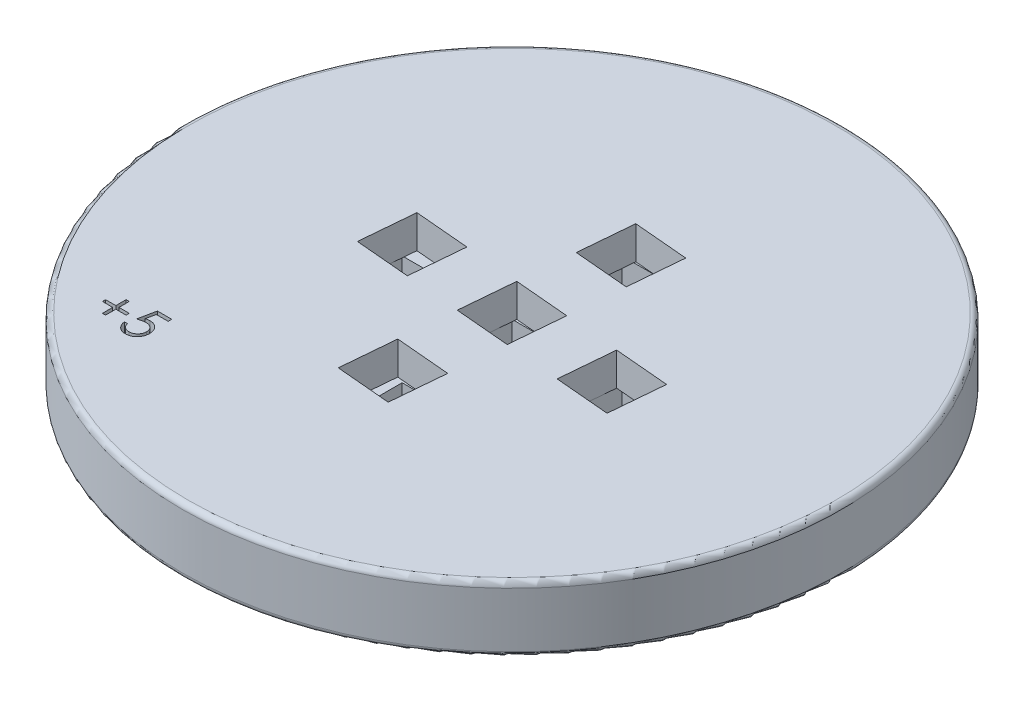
ISO-10303-21;
HEADER;
FILE_DESCRIPTION(('STEP AP214'),'2;1');
FILE_NAME('part.step','',(''),(''),'','','');
FILE_SCHEMA(('AUTOMOTIVE_DESIGN { 1 0 10303 214 1 1 1 1 }'));
ENDSEC;
DATA;
#1=APPLICATION_CONTEXT('core data for automotive mechanical design processes');
#2=APPLICATION_PROTOCOL_DEFINITION('international standard','automotive_design',2000,#1);
#3=PRODUCT_CONTEXT('',#1,'mechanical');
#4=PRODUCT('Part','Part','',(#3));
#5=PRODUCT_RELATED_PRODUCT_CATEGORY('part','',(#4));
#6=PRODUCT_DEFINITION_FORMATION('','',#4);
#7=PRODUCT_DEFINITION_CONTEXT('part definition',#1,'design');
#8=PRODUCT_DEFINITION('design','',#6,#7);
#9=PRODUCT_DEFINITION_SHAPE('','',#8);
#10=(LENGTH_UNIT() NAMED_UNIT(*) SI_UNIT(.MILLI.,.METRE.));
#11=(NAMED_UNIT(*) PLANE_ANGLE_UNIT() SI_UNIT($,.RADIAN.));
#12=(NAMED_UNIT(*) SI_UNIT($,.STERADIAN.) SOLID_ANGLE_UNIT());
#13=UNCERTAINTY_MEASURE_WITH_UNIT(LENGTH_MEASURE(1.E-05),#10,'distance_accuracy_value','');
#14=(GEOMETRIC_REPRESENTATION_CONTEXT(3) GLOBAL_UNCERTAINTY_ASSIGNED_CONTEXT((#13)) GLOBAL_UNIT_ASSIGNED_CONTEXT((#10,
#11,#12)) REPRESENTATION_CONTEXT('',''));
#15=CARTESIAN_POINT('',(0.,0.,0.));
#16=DIRECTION('',(0.,0.,1.));
#17=DIRECTION('',(1.,0.,0.));
#18=AXIS2_PLACEMENT_3D('',#15,#16,#17);
#19=CARTESIAN_POINT('',(0.,3.,0.));
#20=DIRECTION('',(0.,-1.,0.));
#21=DIRECTION('',(0.,0.,-1.));
#22=AXIS2_PLACEMENT_3D('',#19,#20,#21);
#23=PLANE('',#22);
#24=DIRECTION('',(1.,0.,0.));
#25=VECTOR('',#24,1.);
#26=CARTESIAN_POINT('',(-7.5,3.,-2.5));
#27=LINE('',#26,#25);
#28=CARTESIAN_POINT('',(-12.5,3.,-2.5));
#29=VERTEX_POINT('',#28);
#30=CARTESIAN_POINT('',(-12.329026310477,3.,-2.5));
#31=VERTEX_POINT('',#30);
#32=EDGE_CURVE('E1319',#29,#31,#27,.T.);
#33=ORIENTED_EDGE('',*,*,#32,.T.);
#34=DIRECTION('',(-0.0871557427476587,0.,0.996194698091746));
#35=VECTOR('',#34,1.);
#36=CARTESIAN_POINT('',(-12.670323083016,3.,1.40103996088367));
#37=LINE('',#36,#35);
#38=CARTESIAN_POINT('',(-12.5,3.,-0.545761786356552));
#39=VERTEX_POINT('',#38);
#40=EDGE_CURVE('E587',#31,#39,#37,.T.);
#41=ORIENTED_EDGE('',*,*,#40,.T.);
#42=DIRECTION('',(0.,0.,-1.));
#43=VECTOR('',#42,1.);
#44=CARTESIAN_POINT('',(-12.5,3.,-2.5));
#45=LINE('',#44,#43);
#46=EDGE_CURVE('E1326',#39,#29,#45,.T.);
#47=ORIENTED_EDGE('',*,*,#46,.T.);
#48=EDGE_LOOP('',(#33,#41,#47));
#49=FACE_BOUND('',#48,.T.);
#50=ADVANCED_FACE('F33',(#49),#23,.T.);
#51=DIRECTION('',(0.996194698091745,0.,0.0871557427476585));
#52=VECTOR('',#51,1.);
#53=CARTESIAN_POINT('',(-12.670323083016,3.,1.40103996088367));
#54=LINE('',#53,#52);
#55=CARTESIAN_POINT('',(-12.5,3.,1.41594129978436));
#56=VERTEX_POINT('',#55);
#57=CARTESIAN_POINT('',(-7.68934959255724,3.,1.83681867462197));
#58=VERTEX_POINT('',#57);
#59=EDGE_CURVE('E601',#56,#58,#54,.T.);
#60=ORIENTED_EDGE('',*,*,#59,.T.);
#61=DIRECTION('',(0.0871557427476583,0.,-0.996194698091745));
#62=VECTOR('',#61,1.);
#63=CARTESIAN_POINT('',(-7.68934959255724,3.,1.83681867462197));
#64=LINE('',#63,#62);
#65=CARTESIAN_POINT('',(-7.50000000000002,3.,-0.327457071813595));
#66=VERTEX_POINT('',#65);
#67=EDGE_CURVE('E48',#58,#66,#64,.T.);
#68=ORIENTED_EDGE('',*,*,#67,.T.);
#69=DIRECTION('',(0.,0.,1.));
#70=VECTOR('',#69,1.);
#71=CARTESIAN_POINT('',(-7.5,3.,-2.5));
#72=LINE('',#71,#70);
#73=CARTESIAN_POINT('',(-7.5,3.,2.5));
#74=VERTEX_POINT('',#73);
#75=EDGE_CURVE('E1318',#66,#74,#72,.T.);
#76=ORIENTED_EDGE('',*,*,#75,.T.);
#77=DIRECTION('',(-1.,0.,0.));
#78=VECTOR('',#77,1.);
#79=CARTESIAN_POINT('',(-7.5,3.,2.5));
#80=LINE('',#79,#78);
#81=CARTESIAN_POINT('',(-12.5,3.,2.5));
#82=VERTEX_POINT('',#81);
#83=EDGE_CURVE('E1305',#74,#82,#80,.T.);
#84=ORIENTED_EDGE('',*,*,#83,.T.);
#85=EDGE_CURVE('E1323',#82,#56,#45,.T.);
#86=ORIENTED_EDGE('',*,*,#85,.T.);
#87=EDGE_LOOP('',(#60,#68,#76,#84,#86));
#88=FACE_BOUND('',#87,.T.);
#89=ADVANCED_FACE('F897',(#88),#23,.T.);
#90=CARTESIAN_POINT('',(0.,3.,0.));
#91=DIRECTION('',(0.,-1.,0.));
#92=DIRECTION('',(0.,0.,-1.));
#93=AXIS2_PLACEMENT_3D('',#90,#91,#92);
#94=PLANE('',#93);
#95=DIRECTION('',(-1.,0.,0.));
#96=VECTOR('',#95,1.);
#97=CARTESIAN_POINT('',(12.5,3.,2.5));
#98=LINE('',#97,#96);
#99=CARTESIAN_POINT('',(12.5,3.,2.5));
#100=VERTEX_POINT('',#99);
#101=CARTESIAN_POINT('',(12.329026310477,3.,2.5));
#102=VERTEX_POINT('',#101);
#103=EDGE_CURVE('E1331',#100,#102,#98,.T.);
#104=ORIENTED_EDGE('',*,*,#103,.T.);
#105=DIRECTION('',(0.0871557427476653,0.,-0.996194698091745));
#106=VECTOR('',#105,1.);
#107=CARTESIAN_POINT('',(12.2345443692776,3.,3.57993352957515));
#108=LINE('',#107,#106);
#109=CARTESIAN_POINT('',(12.5,3.,0.545761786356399));
#110=VERTEX_POINT('',#109);
#111=EDGE_CURVE('E626',#102,#110,#108,.T.);
#112=ORIENTED_EDGE('',*,*,#111,.T.);
#113=DIRECTION('',(0.,0.,1.));
#114=VECTOR('',#113,1.);
#115=CARTESIAN_POINT('',(12.5,3.,-2.49999999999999));
#116=LINE('',#115,#114);
#117=EDGE_CURVE('E1347',#110,#100,#116,.T.);
#118=ORIENTED_EDGE('',*,*,#117,.T.);
#119=EDGE_LOOP('',(#104,#112,#118));
#120=FACE_BOUND('',#119,.T.);
#121=ADVANCED_FACE('F893',(#120),#94,.T.);
#122=DIRECTION('',(-0.996194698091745,0.,-0.0871557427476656));
#123=VECTOR('',#122,1.);
#124=CARTESIAN_POINT('',(12.670323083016,3.,-1.40103996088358));
#125=LINE('',#124,#123);
#126=CARTESIAN_POINT('',(12.5,3.,-1.41594129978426));
#127=VERTEX_POINT('',#126);
#128=CARTESIAN_POINT('',(7.68934959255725,3.,-1.83681867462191));
#129=VERTEX_POINT('',#128);
#130=EDGE_CURVE('E625',#127,#129,#125,.T.);
#131=ORIENTED_EDGE('',*,*,#130,.T.);
#132=DIRECTION('',(-0.0871557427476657,0.,0.996194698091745));
#133=VECTOR('',#132,1.);
#134=CARTESIAN_POINT('',(7.25357087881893,3.,3.14415481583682));
#135=LINE('',#134,#133);
#136=CARTESIAN_POINT('',(7.5,3.,0.327457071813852));
#137=VERTEX_POINT('',#136);
#138=EDGE_CURVE('E632',#129,#137,#135,.T.);
#139=ORIENTED_EDGE('',*,*,#138,.T.);
#140=DIRECTION('',(0.,0.,-1.));
#141=VECTOR('',#140,1.);
#142=CARTESIAN_POINT('',(7.5,3.,-2.49999999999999));
#143=LINE('',#142,#141);
#144=CARTESIAN_POINT('',(7.5,3.,-2.49999999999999));
#145=VERTEX_POINT('',#144);
#146=EDGE_CURVE('E1353',#137,#145,#143,.T.);
#147=ORIENTED_EDGE('',*,*,#146,.T.);
#148=DIRECTION('',(1.,0.,0.));
#149=VECTOR('',#148,1.);
#150=CARTESIAN_POINT('',(12.5,3.,-2.49999999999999));
#151=LINE('',#150,#149);
#152=CARTESIAN_POINT('',(12.5,3.,-2.49999999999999));
#153=VERTEX_POINT('',#152);
#154=EDGE_CURVE('E1348',#145,#153,#151,.T.);
#155=ORIENTED_EDGE('',*,*,#154,.T.);
#156=EDGE_CURVE('E1343',#153,#127,#116,.T.);
#157=ORIENTED_EDGE('',*,*,#156,.T.);
#158=EDGE_LOOP('',(#131,#139,#147,#155,#157));
#159=FACE_BOUND('',#158,.T.);
#160=ADVANCED_FACE('F896',(#159),#94,.T.);
#161=CARTESIAN_POINT('',(0.,3.,0.));
#162=DIRECTION('',(0.,-1.,0.));
#163=DIRECTION('',(0.,0.,-1.));
#164=AXIS2_PLACEMENT_3D('',#161,#162,#163);
#165=PLANE('',#164);
#166=DIRECTION('',(0.,0.,-1.));
#167=VECTOR('',#166,1.);
#168=CARTESIAN_POINT('',(-2.5,3.,7.5));
#169=LINE('',#168,#167);
#170=CARTESIAN_POINT('',(-2.5,3.,12.5));
#171=VERTEX_POINT('',#170);
#172=CARTESIAN_POINT('',(-2.5,3.,12.329026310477));
#173=VERTEX_POINT('',#172);
#174=EDGE_CURVE('E1297',#171,#173,#169,.T.);
#175=ORIENTED_EDGE('',*,*,#174,.T.);
#176=DIRECTION('',(0.996194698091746,0.,0.0871557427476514));
#177=VECTOR('',#176,1.);
#178=CARTESIAN_POINT('',(1.40103996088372,3.,12.670323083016));
#179=LINE('',#178,#177);
#180=CARTESIAN_POINT('',(-0.545761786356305,3.,12.5));
#181=VERTEX_POINT('',#180);
#182=EDGE_CURVE('E674',#173,#181,#179,.T.);
#183=ORIENTED_EDGE('',*,*,#182,.T.);
#184=DIRECTION('',(-1.,0.,0.));
#185=VECTOR('',#184,1.);
#186=CARTESIAN_POINT('',(2.5,3.,12.5));
#187=LINE('',#186,#185);
#188=EDGE_CURVE('E1289',#181,#171,#187,.T.);
#189=ORIENTED_EDGE('',*,*,#188,.T.);
#190=EDGE_LOOP('',(#175,#183,#189));
#191=FACE_BOUND('',#190,.T.);
#192=ADVANCED_FACE('F934',(#191),#165,.T.);
#193=CARTESIAN_POINT('',(2.5,3.,12.5));
#194=VERTEX_POINT('',#193);
#195=CARTESIAN_POINT('',(1.4159412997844,3.,12.5));
#196=VERTEX_POINT('',#195);
#197=EDGE_CURVE('E1277',#194,#196,#187,.T.);
#198=ORIENTED_EDGE('',*,*,#197,.T.);
#199=DIRECTION('',(0.0871557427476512,0.,-0.996194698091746));
#200=VECTOR('',#199,1.);
#201=CARTESIAN_POINT('',(1.40103996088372,3.,12.670323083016));
#202=LINE('',#201,#200);
#203=CARTESIAN_POINT('',(1.83681867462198,3.,7.68934959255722));
#204=VERTEX_POINT('',#203);
#205=EDGE_CURVE('E662',#196,#204,#202,.T.);
#206=ORIENTED_EDGE('',*,*,#205,.T.);
#207=DIRECTION('',(-0.996194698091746,0.,-0.0871557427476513));
#208=VECTOR('',#207,1.);
#209=CARTESIAN_POINT('',(1.83681867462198,3.,7.68934959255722));
#210=LINE('',#209,#208);
#211=CARTESIAN_POINT('',(-0.327457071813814,3.,7.5));
#212=VERTEX_POINT('',#211);
#213=EDGE_CURVE('E663',#204,#212,#210,.T.);
#214=ORIENTED_EDGE('',*,*,#213,.T.);
#215=DIRECTION('',(1.,0.,0.));
#216=VECTOR('',#215,1.);
#217=CARTESIAN_POINT('',(2.5,3.,7.5));
#218=LINE('',#217,#216);
#219=CARTESIAN_POINT('',(2.5,3.,7.5));
#220=VERTEX_POINT('',#219);
#221=EDGE_CURVE('E1296',#212,#220,#218,.T.);
#222=ORIENTED_EDGE('',*,*,#221,.T.);
#223=DIRECTION('',(0.,0.,1.));
#224=VECTOR('',#223,1.);
#225=CARTESIAN_POINT('',(2.5,3.,7.5));
#226=LINE('',#225,#224);
#227=EDGE_CURVE('E1290',#220,#194,#226,.T.);
#228=ORIENTED_EDGE('',*,*,#227,.T.);
#229=EDGE_LOOP('',(#198,#206,#214,#222,#228));
#230=FACE_BOUND('',#229,.T.);
#231=ADVANCED_FACE('F873',(#230),#165,.T.);
#232=CARTESIAN_POINT('',(0.,3.,0.));
#233=DIRECTION('',(0.,-1.,0.));
#234=DIRECTION('',(0.,0.,-1.));
#235=AXIS2_PLACEMENT_3D('',#232,#233,#234);
#236=PLANE('',#235);
#237=DIRECTION('',(0.,0.,1.));
#238=VECTOR('',#237,1.);
#239=CARTESIAN_POINT('',(2.5,3.,-7.5));
#240=LINE('',#239,#238);
#241=CARTESIAN_POINT('',(2.5,3.,-12.5));
#242=VERTEX_POINT('',#241);
#243=CARTESIAN_POINT('',(2.5,3.,-12.329026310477));
#244=VERTEX_POINT('',#243);
#245=EDGE_CURVE('E1378',#242,#244,#240,.T.);
#246=ORIENTED_EDGE('',*,*,#245,.T.);
#247=DIRECTION('',(-0.996194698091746,0.,-0.0871557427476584));
#248=VECTOR('',#247,1.);
#249=CARTESIAN_POINT('',(-1.40103996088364,3.,-12.670323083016));
#250=LINE('',#249,#248);
#251=CARTESIAN_POINT('',(0.54576178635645,3.,-12.5));
#252=VERTEX_POINT('',#251);
#253=EDGE_CURVE('E710',#244,#252,#250,.T.);
#254=ORIENTED_EDGE('',*,*,#253,.T.);
#255=DIRECTION('',(1.,0.,0.));
#256=VECTOR('',#255,1.);
#257=CARTESIAN_POINT('',(-2.5,3.,-12.5));
#258=LINE('',#257,#256);
#259=EDGE_CURVE('E1370',#252,#242,#258,.T.);
#260=ORIENTED_EDGE('',*,*,#259,.T.);
#261=EDGE_LOOP('',(#246,#254,#260));
#262=FACE_BOUND('',#261,.T.);
#263=ADVANCED_FACE('F869',(#262),#236,.T.);
#264=CARTESIAN_POINT('',(-2.5,3.,-12.5));
#265=VERTEX_POINT('',#264);
#266=CARTESIAN_POINT('',(-1.41594129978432,3.,-12.5));
#267=VERTEX_POINT('',#266);
#268=EDGE_CURVE('E1358',#265,#267,#258,.T.);
#269=ORIENTED_EDGE('',*,*,#268,.T.);
#270=DIRECTION('',(-0.0871557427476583,0.,0.996194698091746));
#271=VECTOR('',#270,1.);
#272=CARTESIAN_POINT('',(-1.83681867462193,3.,-7.68934959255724));
#273=LINE('',#272,#271);
#274=CARTESIAN_POINT('',(-1.83681867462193,3.,-7.68934959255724));
#275=VERTEX_POINT('',#274);
#276=EDGE_CURVE('E698',#267,#275,#273,.T.);
#277=ORIENTED_EDGE('',*,*,#276,.T.);
#278=DIRECTION('',(0.996194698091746,0.,0.0871557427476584));
#279=VECTOR('',#278,1.);
#280=CARTESIAN_POINT('',(-1.83681867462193,3.,-7.68934959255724));
#281=LINE('',#280,#279);
#282=CARTESIAN_POINT('',(0.327457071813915,3.,-7.5));
#283=VERTEX_POINT('',#282);
#284=EDGE_CURVE('E699',#275,#283,#281,.T.);
#285=ORIENTED_EDGE('',*,*,#284,.T.);
#286=DIRECTION('',(-1.,0.,0.));
#287=VECTOR('',#286,1.);
#288=CARTESIAN_POINT('',(-2.5,3.,-7.5));
#289=LINE('',#288,#287);
#290=CARTESIAN_POINT('',(-2.5,3.,-7.5));
#291=VERTEX_POINT('',#290);
#292=EDGE_CURVE('E1377',#283,#291,#289,.T.);
#293=ORIENTED_EDGE('',*,*,#292,.T.);
#294=DIRECTION('',(0.,0.,-1.));
#295=VECTOR('',#294,1.);
#296=CARTESIAN_POINT('',(-2.5,3.,-7.5));
#297=LINE('',#296,#295);
#298=EDGE_CURVE('E1371',#291,#265,#297,.T.);
#299=ORIENTED_EDGE('',*,*,#298,.T.);
#300=EDGE_LOOP('',(#269,#277,#285,#293,#299));
#301=FACE_BOUND('',#300,.T.);
#302=ADVANCED_FACE('F872',(#301),#236,.T.);
#303=CARTESIAN_POINT('',(0.,3.,0.));
#304=DIRECTION('',(0.,-1.,0.));
#305=DIRECTION('',(0.,0.,-1.));
#306=AXIS2_PLACEMENT_3D('',#303,#304,#305);
#307=PLANE('',#306);
#308=DIRECTION('',(1.,0.,0.));
#309=VECTOR('',#308,1.);
#310=CARTESIAN_POINT('',(2.5,3.,-2.5));
#311=LINE('',#310,#309);
#312=CARTESIAN_POINT('',(-2.5,3.,-2.5));
#313=VERTEX_POINT('',#312);
#314=CARTESIAN_POINT('',(-2.29082793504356,3.,-2.5));
#315=VERTEX_POINT('',#314);
#316=EDGE_CURVE('E1263',#313,#315,#311,.T.);
#317=ORIENTED_EDGE('',*,*,#316,.T.);
#318=DIRECTION('',(-0.0871557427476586,0.,0.996194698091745));
#319=VECTOR('',#318,1.);
#320=CARTESIAN_POINT('',(-2.70837610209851,3.,2.27259738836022));
#321=LINE('',#320,#319);
#322=CARTESIAN_POINT('',(-2.50000000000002,3.,-0.109152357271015));
#323=VERTEX_POINT('',#322);
#324=EDGE_CURVE('E734',#315,#323,#321,.T.);
#325=ORIENTED_EDGE('',*,*,#324,.T.);
#326=DIRECTION('',(0.,0.,-1.));
#327=VECTOR('',#326,1.);
#328=CARTESIAN_POINT('',(-2.5,3.,-2.5));
#329=LINE('',#328,#327);
#330=EDGE_CURVE('E1272',#323,#313,#329,.T.);
#331=ORIENTED_EDGE('',*,*,#330,.T.);
#332=EDGE_LOOP('',(#317,#325,#331));
#333=FACE_BOUND('',#332,.T.);
#334=ADVANCED_FACE('F954',(#333),#307,.T.);
#335=DIRECTION('',(0.,0.,1.));
#336=VECTOR('',#335,1.);
#337=CARTESIAN_POINT('',(2.5,3.,-2.5));
#338=LINE('',#337,#336);
#339=CARTESIAN_POINT('',(2.5,3.,-2.5));
#340=VERTEX_POINT('',#339);
#341=CARTESIAN_POINT('',(2.5,3.,-2.29082793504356));
#342=VERTEX_POINT('',#341);
#343=EDGE_CURVE('E1258',#340,#342,#338,.T.);
#344=ORIENTED_EDGE('',*,*,#343,.T.);
#345=DIRECTION('',(-0.996194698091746,0.,-0.0871557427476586));
#346=VECTOR('',#345,1.);
#347=CARTESIAN_POINT('',(-2.27259738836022,3.,-2.70837610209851));
#348=LINE('',#347,#346);
#349=CARTESIAN_POINT('',(0.109152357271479,3.,-2.49999999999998));
#350=VERTEX_POINT('',#349);
#351=EDGE_CURVE('E750',#342,#350,#348,.T.);
#352=ORIENTED_EDGE('',*,*,#351,.T.);
#353=EDGE_CURVE('E1267',#350,#340,#311,.T.);
#354=ORIENTED_EDGE('',*,*,#353,.T.);
#355=EDGE_LOOP('',(#344,#352,#354));
#356=FACE_BOUND('',#355,.T.);
#357=ADVANCED_FACE('F957',(#356),#307,.T.);
#358=DIRECTION('',(-1.,0.,0.));
#359=VECTOR('',#358,1.);
#360=CARTESIAN_POINT('',(2.5,3.,2.5));
#361=LINE('',#360,#359);
#362=CARTESIAN_POINT('',(2.5,3.,2.5));
#363=VERTEX_POINT('',#362);
#364=CARTESIAN_POINT('',(2.29082793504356,3.,2.5));
#365=VERTEX_POINT('',#364);
#366=EDGE_CURVE('E1249',#363,#365,#361,.T.);
#367=ORIENTED_EDGE('',*,*,#366,.T.);
#368=DIRECTION('',(0.0871557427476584,0.,-0.996194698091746));
#369=VECTOR('',#368,1.);
#370=CARTESIAN_POINT('',(2.27259738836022,3.,2.70837610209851));
#371=LINE('',#370,#369);
#372=CARTESIAN_POINT('',(2.5,3.,0.109152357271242));
#373=VERTEX_POINT('',#372);
#374=EDGE_CURVE('E745',#365,#373,#371,.T.);
#375=ORIENTED_EDGE('',*,*,#374,.T.);
#376=EDGE_CURVE('E1262',#373,#363,#338,.T.);
#377=ORIENTED_EDGE('',*,*,#376,.T.);
#378=EDGE_LOOP('',(#367,#375,#377));
#379=FACE_BOUND('',#378,.T.);
#380=ADVANCED_FACE('F2181',(#379),#307,.T.);
#381=CARTESIAN_POINT('',(-2.5,3.,2.5));
#382=VERTEX_POINT('',#381);
#383=CARTESIAN_POINT('',(-2.5,3.,2.29082793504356));
#384=VERTEX_POINT('',#383);
#385=EDGE_CURVE('E1268',#382,#384,#329,.T.);
#386=ORIENTED_EDGE('',*,*,#385,.T.);
#387=DIRECTION('',(0.996194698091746,0.,0.0871557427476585));
#388=VECTOR('',#387,1.);
#389=CARTESIAN_POINT('',(-2.70837610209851,3.,2.27259738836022));
#390=LINE('',#389,#388);
#391=CARTESIAN_POINT('',(-0.109152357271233,3.,2.5));
#392=VERTEX_POINT('',#391);
#393=EDGE_CURVE('E740',#384,#392,#390,.T.);
#394=ORIENTED_EDGE('',*,*,#393,.T.);
#395=EDGE_CURVE('E1257',#392,#382,#361,.T.);
#396=ORIENTED_EDGE('',*,*,#395,.T.);
#397=EDGE_LOOP('',(#386,#394,#396));
#398=FACE_BOUND('',#397,.T.);
#399=ADVANCED_FACE('F959',(#398),#307,.T.);
#400=CARTESIAN_POINT('',(0.,6.,0.));
#401=DIRECTION('',(0.,1.,0.));
#402=DIRECTION('',(0.,0.,1.));
#403=AXIS2_PLACEMENT_3D('',#400,#401,#402);
#404=PLANE('',#403);
#405=DIRECTION('',(-0.0871557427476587,0.,0.996194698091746));
#406=VECTOR('',#405,1.);
#407=CARTESIAN_POINT('',(-12.670323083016,6.,1.40103996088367));
#408=LINE('',#407,#406);
#409=CARTESIAN_POINT('',(-12.2345443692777,6.,-3.57993352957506));
#410=VERTEX_POINT('',#409);
#411=CARTESIAN_POINT('',(-12.670323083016,6.,1.40103996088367));
#412=VERTEX_POINT('',#411);
#413=EDGE_CURVE('E56',#410,#412,#408,.T.);
#414=ORIENTED_EDGE('',*,*,#413,.F.);
#415=DIRECTION('',(-0.996194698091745,0.,-0.0871557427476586));
#416=VECTOR('',#415,1.);
#417=CARTESIAN_POINT('',(-12.2345443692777,6.,-3.57993352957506));
#418=LINE('',#417,#416);
#419=CARTESIAN_POINT('',(-7.25357087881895,6.,-3.14415481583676));
#420=VERTEX_POINT('',#419);
#421=EDGE_CURVE('E588',#420,#410,#418,.T.);
#422=ORIENTED_EDGE('',*,*,#421,.F.);
#423=DIRECTION('',(0.0871557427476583,0.,-0.996194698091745));
#424=VECTOR('',#423,1.);
#425=CARTESIAN_POINT('',(-7.68934959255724,6.,1.83681867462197));
#426=LINE('',#425,#424);
#427=CARTESIAN_POINT('',(-7.68934959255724,6.,1.83681867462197));
#428=VERTEX_POINT('',#427);
#429=EDGE_CURVE('E611',#428,#420,#426,.T.);
#430=ORIENTED_EDGE('',*,*,#429,.F.);
#431=DIRECTION('',(0.996194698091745,0.,0.0871557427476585));
#432=VECTOR('',#431,1.);
#433=CARTESIAN_POINT('',(-12.670323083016,6.,1.40103996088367));
#434=LINE('',#433,#432);
#435=EDGE_CURVE('E609',#412,#428,#434,.T.);
#436=ORIENTED_EDGE('',*,*,#435,.F.);
#437=EDGE_LOOP('',(#414,#422,#430,#436));
#438=FACE_BOUND('',#437,.T.);
#439=DIRECTION('',(0.0871557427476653,0.,-0.996194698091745));
#440=VECTOR('',#439,1.);
#441=CARTESIAN_POINT('',(12.2345443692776,6.,3.57993352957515));
#442=LINE('',#441,#440);
#443=CARTESIAN_POINT('',(12.2345443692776,6.,3.57993352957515));
#444=VERTEX_POINT('',#443);
#445=CARTESIAN_POINT('',(12.670323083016,6.,-1.40103996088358));
#446=VERTEX_POINT('',#445);
#447=EDGE_CURVE('E618',#444,#446,#442,.T.);
#448=ORIENTED_EDGE('',*,*,#447,.F.);
#449=DIRECTION('',(0.996194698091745,0.,0.0871557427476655));
#450=VECTOR('',#449,1.);
#451=CARTESIAN_POINT('',(12.2345443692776,6.,3.57993352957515));
#452=LINE('',#451,#450);
#453=CARTESIAN_POINT('',(7.25357087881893,6.,3.14415481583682));
#454=VERTEX_POINT('',#453);
#455=EDGE_CURVE('E646',#454,#444,#452,.T.);
#456=ORIENTED_EDGE('',*,*,#455,.F.);
#457=DIRECTION('',(-0.0871557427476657,0.,0.996194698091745));
#458=VECTOR('',#457,1.);
#459=CARTESIAN_POINT('',(7.25357087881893,6.,3.14415481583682));
#460=LINE('',#459,#458);
#461=CARTESIAN_POINT('',(7.68934959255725,6.,-1.83681867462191));
#462=VERTEX_POINT('',#461);
#463=EDGE_CURVE('E643',#462,#454,#460,.T.);
#464=ORIENTED_EDGE('',*,*,#463,.F.);
#465=DIRECTION('',(-0.996194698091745,0.,-0.0871557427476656));
#466=VECTOR('',#465,1.);
#467=CARTESIAN_POINT('',(12.670323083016,6.,-1.40103996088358));
#468=LINE('',#467,#466);
#469=EDGE_CURVE('E640',#446,#462,#468,.T.);
#470=ORIENTED_EDGE('',*,*,#469,.F.);
#471=EDGE_LOOP('',(#448,#456,#464,#470));
#472=FACE_BOUND('',#471,.T.);
#473=DIRECTION('',(0.0871557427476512,0.,-0.996194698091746));
#474=VECTOR('',#473,1.);
#475=CARTESIAN_POINT('',(1.40103996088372,6.,12.670323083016));
#476=LINE('',#475,#474);
#477=CARTESIAN_POINT('',(1.40103996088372,6.,12.670323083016));
#478=VERTEX_POINT('',#477);
#479=CARTESIAN_POINT('',(1.83681867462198,6.,7.68934959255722));
#480=VERTEX_POINT('',#479);
#481=EDGE_CURVE('E651',#478,#480,#476,.T.);
#482=ORIENTED_EDGE('',*,*,#481,.F.);
#483=DIRECTION('',(0.996194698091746,0.,0.0871557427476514));
#484=VECTOR('',#483,1.);
#485=CARTESIAN_POINT('',(1.40103996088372,6.,12.670323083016));
#486=LINE('',#485,#484);
#487=CARTESIAN_POINT('',(-3.57993352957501,6.,12.2345443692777));
#488=VERTEX_POINT('',#487);
#489=EDGE_CURVE('E682',#488,#478,#486,.T.);
#490=ORIENTED_EDGE('',*,*,#489,.F.);
#491=DIRECTION('',(-0.0871557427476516,0.,0.996194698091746));
#492=VECTOR('',#491,1.);
#493=CARTESIAN_POINT('',(-3.57993352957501,6.,12.2345443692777));
#494=LINE('',#493,#492);
#495=CARTESIAN_POINT('',(-3.14415481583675,6.,7.25357087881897));
#496=VERTEX_POINT('',#495);
#497=EDGE_CURVE('E679',#496,#488,#494,.T.);
#498=ORIENTED_EDGE('',*,*,#497,.F.);
#499=DIRECTION('',(-0.996194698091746,0.,-0.0871557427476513));
#500=VECTOR('',#499,1.);
#501=CARTESIAN_POINT('',(1.83681867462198,6.,7.68934959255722));
#502=LINE('',#501,#500);
#503=EDGE_CURVE('E676',#480,#496,#502,.T.);
#504=ORIENTED_EDGE('',*,*,#503,.F.);
#505=EDGE_LOOP('',(#482,#490,#498,#504));
#506=FACE_BOUND('',#505,.T.);
#507=DIRECTION('',(-0.0871557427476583,0.,0.996194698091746));
#508=VECTOR('',#507,1.);
#509=CARTESIAN_POINT('',(-1.83681867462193,6.,-7.68934959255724));
#510=LINE('',#509,#508);
#511=CARTESIAN_POINT('',(-1.40103996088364,6.,-12.670323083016));
#512=VERTEX_POINT('',#511);
#513=CARTESIAN_POINT('',(-1.83681867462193,6.,-7.68934959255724));
#514=VERTEX_POINT('',#513);
#515=EDGE_CURVE('E687',#512,#514,#510,.T.);
#516=ORIENTED_EDGE('',*,*,#515,.F.);
#517=DIRECTION('',(-0.996194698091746,0.,-0.0871557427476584));
#518=VECTOR('',#517,1.);
#519=CARTESIAN_POINT('',(-1.40103996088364,6.,-12.670323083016));
#520=LINE('',#519,#518);
#521=CARTESIAN_POINT('',(3.57993352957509,6.,-12.2345443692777));
#522=VERTEX_POINT('',#521);
#523=EDGE_CURVE('E718',#522,#512,#520,.T.);
#524=ORIENTED_EDGE('',*,*,#523,.F.);
#525=DIRECTION('',(0.087155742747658,0.,-0.996194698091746));
#526=VECTOR('',#525,1.);
#527=CARTESIAN_POINT('',(3.1441548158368,6.,-7.25357087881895));
#528=LINE('',#527,#526);
#529=CARTESIAN_POINT('',(3.1441548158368,6.,-7.25357087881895));
#530=VERTEX_POINT('',#529);
#531=EDGE_CURVE('E715',#530,#522,#528,.T.);
#532=ORIENTED_EDGE('',*,*,#531,.F.);
#533=DIRECTION('',(0.996194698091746,0.,0.0871557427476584));
#534=VECTOR('',#533,1.);
#535=CARTESIAN_POINT('',(-1.83681867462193,6.,-7.68934959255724));
#536=LINE('',#535,#534);
#537=EDGE_CURVE('E712',#514,#530,#536,.T.);
#538=ORIENTED_EDGE('',*,*,#537,.F.);
#539=EDGE_LOOP('',(#516,#524,#532,#538));
#540=FACE_BOUND('',#539,.T.);
#541=DIRECTION('',(-0.0871557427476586,0.,0.996194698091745));
#542=VECTOR('',#541,1.);
#543=CARTESIAN_POINT('',(-2.70837610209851,6.,2.27259738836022));
#544=LINE('',#543,#542);
#545=CARTESIAN_POINT('',(-2.27259738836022,6.,-2.70837610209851));
#546=VERTEX_POINT('',#545);
#547=CARTESIAN_POINT('',(-2.70837610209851,6.,2.27259738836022));
#548=VERTEX_POINT('',#547);
#549=EDGE_CURVE('E723',#546,#548,#544,.T.);
#550=ORIENTED_EDGE('',*,*,#549,.F.);
#551=DIRECTION('',(-0.996194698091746,0.,-0.0871557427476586));
#552=VECTOR('',#551,1.);
#553=CARTESIAN_POINT('',(-2.27259738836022,6.,-2.70837610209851));
#554=LINE('',#553,#552);
#555=CARTESIAN_POINT('',(2.70837610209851,6.,-2.27259738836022));
#556=VERTEX_POINT('',#555);
#557=EDGE_CURVE('E758',#556,#546,#554,.T.);
#558=ORIENTED_EDGE('',*,*,#557,.F.);
#559=DIRECTION('',(0.0871557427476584,0.,-0.996194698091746));
#560=VECTOR('',#559,1.);
#561=CARTESIAN_POINT('',(2.27259738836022,6.,2.70837610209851));
#562=LINE('',#561,#560);
#563=CARTESIAN_POINT('',(2.27259738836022,6.,2.70837610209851));
#564=VERTEX_POINT('',#563);
#565=EDGE_CURVE('E755',#564,#556,#562,.T.);
#566=ORIENTED_EDGE('',*,*,#565,.F.);
#567=DIRECTION('',(0.996194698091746,0.,0.0871557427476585));
#568=VECTOR('',#567,1.);
#569=CARTESIAN_POINT('',(-2.70837610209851,6.,2.27259738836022));
#570=LINE('',#569,#568);
#571=EDGE_CURVE('E752',#548,#564,#570,.T.);
#572=ORIENTED_EDGE('',*,*,#571,.F.);
#573=EDGE_LOOP('',(#550,#558,#566,#572));
#574=FACE_BOUND('',#573,.T.);
#575=DIRECTION('',(0.,0.,-1.));
#576=VECTOR('',#575,1.);
#577=CARTESIAN_POINT('',(-19.5482362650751,6.,17.7361936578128));
#578=LINE('',#577,#576);
#579=CARTESIAN_POINT('',(-19.5482362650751,6.,17.7361936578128));
#580=VERTEX_POINT('',#579);
#581=CARTESIAN_POINT('',(-19.5482362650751,6.,17.4512577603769));
#582=VERTEX_POINT('',#581);
#583=EDGE_CURVE('E1407',#580,#582,#578,.T.);
#584=ORIENTED_EDGE('',*,*,#583,.T.);
#585=DIRECTION('',(1.,0.,0.));
#586=VECTOR('',#585,1.);
#587=CARTESIAN_POINT('',(-19.5482362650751,6.,17.4512577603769));
#588=LINE('',#587,#586);
#589=CARTESIAN_POINT('',(-18.6120183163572,6.,17.4512577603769));
#590=VERTEX_POINT('',#589);
#591=EDGE_CURVE('E1441',#582,#590,#588,.T.);
#592=ORIENTED_EDGE('',*,*,#591,.T.);
#593=DIRECTION('',(0.,0.,-1.));
#594=VECTOR('',#593,1.);
#595=CARTESIAN_POINT('',(-18.6120183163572,6.,17.4512577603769));
#596=LINE('',#595,#594);
#597=CARTESIAN_POINT('',(-18.6120183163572,6.,16.515039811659));
#598=VERTEX_POINT('',#597);
#599=EDGE_CURVE('E1438',#590,#598,#596,.T.);
#600=ORIENTED_EDGE('',*,*,#599,.T.);
#601=DIRECTION('',(1.,0.,0.));
#602=VECTOR('',#601,1.);
#603=CARTESIAN_POINT('',(-18.6120183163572,6.,16.515039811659));
#604=LINE('',#603,#602);
#605=CARTESIAN_POINT('',(-18.3270824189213,6.,16.515039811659));
#606=VERTEX_POINT('',#605);
#607=EDGE_CURVE('E1435',#598,#606,#604,.T.);
#608=ORIENTED_EDGE('',*,*,#607,.T.);
#609=DIRECTION('',(0.,0.,1.));
#610=VECTOR('',#609,1.);
#611=CARTESIAN_POINT('',(-18.3270824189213,6.,16.515039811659));
#612=LINE('',#611,#610);
#613=CARTESIAN_POINT('',(-18.3270824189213,6.,17.4512577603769));
#614=VERTEX_POINT('',#613);
#615=EDGE_CURVE('E1432',#606,#614,#612,.T.);
#616=ORIENTED_EDGE('',*,*,#615,.T.);
#617=DIRECTION('',(1.,0.,0.));
#618=VECTOR('',#617,1.);
#619=CARTESIAN_POINT('',(-18.3270824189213,6.,17.4512577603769));
#620=LINE('',#619,#618);
#621=CARTESIAN_POINT('',(-17.3908644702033,6.,17.4512577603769));
#622=VERTEX_POINT('',#621);
#623=EDGE_CURVE('E1429',#614,#622,#620,.T.);
#624=ORIENTED_EDGE('',*,*,#623,.T.);
#625=DIRECTION('',(0.,0.,1.));
#626=VECTOR('',#625,1.);
#627=CARTESIAN_POINT('',(-17.3908644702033,6.,17.4512577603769));
#628=LINE('',#627,#626);
#629=CARTESIAN_POINT('',(-17.3908644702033,6.,17.7361936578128));
#630=VERTEX_POINT('',#629);
#631=EDGE_CURVE('E1426',#622,#630,#628,.T.);
#632=ORIENTED_EDGE('',*,*,#631,.T.);
#633=DIRECTION('',(-1.,0.,0.));
#634=VECTOR('',#633,1.);
#635=CARTESIAN_POINT('',(-17.3908644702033,6.,17.7361936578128));
#636=LINE('',#635,#634);
#637=CARTESIAN_POINT('',(-18.3270824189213,6.,17.7361936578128));
#638=VERTEX_POINT('',#637);
#639=EDGE_CURVE('E1423',#630,#638,#636,.T.);
#640=ORIENTED_EDGE('',*,*,#639,.T.);
#641=DIRECTION('',(0.,0.,1.));
#642=VECTOR('',#641,1.);
#643=CARTESIAN_POINT('',(-18.3270824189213,6.,17.7361936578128));
#644=LINE('',#643,#642);
#645=CARTESIAN_POINT('',(-18.3270824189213,6.,18.6724116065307));
#646=VERTEX_POINT('',#645);
#647=EDGE_CURVE('E1420',#638,#646,#644,.T.);
#648=ORIENTED_EDGE('',*,*,#647,.T.);
#649=DIRECTION('',(-1.,0.,0.));
#650=VECTOR('',#649,1.);
#651=CARTESIAN_POINT('',(-18.3270824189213,6.,18.6724116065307));
#652=LINE('',#651,#650);
#653=CARTESIAN_POINT('',(-18.6120183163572,6.,18.6724116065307));
#654=VERTEX_POINT('',#653);
#655=EDGE_CURVE('E1417',#646,#654,#652,.T.);
#656=ORIENTED_EDGE('',*,*,#655,.T.);
#657=DIRECTION('',(0.,0.,-1.));
#658=VECTOR('',#657,1.);
#659=CARTESIAN_POINT('',(-18.6120183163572,6.,18.6724116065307));
#660=LINE('',#659,#658);
#661=CARTESIAN_POINT('',(-18.6120183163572,6.,17.7361936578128));
#662=VERTEX_POINT('',#661);
#663=EDGE_CURVE('E1414',#654,#662,#660,.T.);
#664=ORIENTED_EDGE('',*,*,#663,.T.);
#665=DIRECTION('',(-1.,0.,0.));
#666=VECTOR('',#665,1.);
#667=CARTESIAN_POINT('',(-18.6120183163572,6.,17.7361936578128));
#668=LINE('',#667,#666);
#669=EDGE_CURVE('E1411',#662,#580,#668,.T.);
#670=ORIENTED_EDGE('',*,*,#669,.T.);
#671=EDGE_LOOP('',(#584,#592,#600,#608,#616,#624,#632,#640,#648,#656,#664,#670));
#672=FACE_BOUND('',#671,.T.);
#673=CARTESIAN_POINT('',(0.,6.,0.));
#674=DIRECTION('',(0.,1.,0.));
#675=DIRECTION('',(0.,0.,1.));
#676=AXIS2_PLACEMENT_3D('',#673,#674,#675);
#677=CIRCLE('',#676,29.5);
#678=CARTESIAN_POINT('',(0.,6.,29.5));
#679=VERTEX_POINT('',#678);
#680=EDGE_CURVE('E41',#679,#679,#677,.T.);
#681=ORIENTED_EDGE('',*,*,#680,.T.);
#682=EDGE_LOOP('',(#681));
#683=FACE_BOUND('',#682,.T.);
#684=DIRECTION('',(0.200944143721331,0.,-0.97960270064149));
#685=VECTOR('',#684,1.);
#686=CARTESIAN_POINT('',(-16.6174670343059,6.,17.5733731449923));
#687=LINE('',#686,#685);
#688=CARTESIAN_POINT('',(-16.6174670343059,6.,17.5733731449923));
#689=VERTEX_POINT('',#688);
#690=CARTESIAN_POINT('',(-16.2918260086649,6.,15.9858731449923));
#691=VERTEX_POINT('',#690);
#692=EDGE_CURVE('E774',#689,#691,#687,.T.);
#693=ORIENTED_EDGE('',*,*,#692,.T.);
#694=DIRECTION('',(1.,0.,0.));
#695=VECTOR('',#694,1.);
#696=CARTESIAN_POINT('',(-16.2918260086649,6.,15.9858731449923));
#697=LINE('',#696,#695);
#698=CARTESIAN_POINT('',(-14.9892619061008,6.,15.9858731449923));
#699=VERTEX_POINT('',#698);
#700=EDGE_CURVE('E763',#691,#699,#697,.T.);
#701=ORIENTED_EDGE('',*,*,#700,.T.);
#702=DIRECTION('',(0.,0.,1.));
#703=VECTOR('',#702,1.);
#704=CARTESIAN_POINT('',(-14.9892619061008,6.,15.9858731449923));
#705=LINE('',#704,#703);
#706=CARTESIAN_POINT('',(-14.9892619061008,6.,16.3115141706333));
#707=VERTEX_POINT('',#706);
#708=EDGE_CURVE('E1573',#699,#707,#705,.T.);
#709=ORIENTED_EDGE('',*,*,#708,.T.);
#710=DIRECTION('',(-1.,0.,0.));
#711=VECTOR('',#710,1.);
#712=CARTESIAN_POINT('',(-14.9892619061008,6.,16.3115141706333));
#713=LINE('',#712,#711);
#714=CARTESIAN_POINT('',(-16.0692198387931,6.,16.3115141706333));
#715=VERTEX_POINT('',#714);
#716=EDGE_CURVE('E1570',#707,#715,#713,.T.);
#717=ORIENTED_EDGE('',*,*,#716,.T.);
#718=DIRECTION('',(-0.200705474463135,0.,0.979651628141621));
#719=VECTOR('',#718,1.);
#720=CARTESIAN_POINT('',(-16.0692198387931,6.,16.3115141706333));
#721=LINE('',#720,#719);
#722=CARTESIAN_POINT('',(-16.2403085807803,6.,17.1466053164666));
#723=VERTEX_POINT('',#722);
#724=EDGE_CURVE('E1564',#715,#723,#721,.T.);
#725=ORIENTED_EDGE('',*,*,#724,.T.);
#726=CARTESIAN_POINT('',(-16.2403085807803,6.,17.1466053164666));
#727=CARTESIAN_POINT('',(-16.206693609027,6.,17.1373249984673));
#728=CARTESIAN_POINT('',(-16.1415699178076,6.,17.1193458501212));
#729=CARTESIAN_POINT('',(-16.0454491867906,6.,17.0993834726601));
#730=CARTESIAN_POINT('',(-15.9541976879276,6.,17.0873498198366));
#731=CARTESIAN_POINT('',(-15.8949836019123,6.,17.0857067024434));
#732=CARTESIAN_POINT('',(-15.8663302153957,6.,17.0849116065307));
#733=B_SPLINE_CURVE_WITH_KNOTS('',3,(#726,#727,#728,#729,#730,#731,#732),.UNSPECIFIED.,.F.,.F.,
(4,1,1,1,4),(0.,0.275068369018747,0.532901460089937,0.773973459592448,1.),.UNSPECIFIED.);
#734=CARTESIAN_POINT('',(-15.8663302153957,6.,17.0849116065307));
#735=VERTEX_POINT('',#734);
#736=EDGE_CURVE('E1556',#723,#735,#733,.T.);
#737=ORIENTED_EDGE('',*,*,#736,.T.);
#738=CARTESIAN_POINT('',(-15.8663302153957,6.,17.0849116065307));
#739=CARTESIAN_POINT('',(-15.8308756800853,6.,17.0856789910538));
#740=CARTESIAN_POINT('',(-15.7611632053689,6.,17.0871878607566));
#741=CARTESIAN_POINT('',(-15.659165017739,6.,17.1016766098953));
#742=CARTESIAN_POINT('',(-15.5617987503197,6.,17.1244821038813));
#743=CARTESIAN_POINT('',(-15.4692680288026,6.,17.1563414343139));
#744=CARTESIAN_POINT('',(-15.3814016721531,6.,17.1970809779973));
#745=CARTESIAN_POINT('',(-15.2990080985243,6.,17.2479716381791));
#746=CARTESIAN_POINT('',(-15.220850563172,6.,17.3074197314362));
#747=CARTESIAN_POINT('',(-15.148331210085,6.,17.3757684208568));
#748=CARTESIAN_POINT('',(-15.0825413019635,6.,17.4509901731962));
#749=CARTESIAN_POINT('',(-15.0246964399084,6.,17.5318690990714));
#750=CARTESIAN_POINT('',(-14.9755632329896,6.,17.6176191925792));
#751=CARTESIAN_POINT('',(-14.9360474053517,6.,17.7090597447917));
#752=CARTESIAN_POINT('',(-14.9044930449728,6.,17.8051798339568));
#753=CARTESIAN_POINT('',(-14.8834908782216,6.,17.9069908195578));
#754=CARTESIAN_POINT('',(-14.8695057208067,6.,18.0135330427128));
#755=CARTESIAN_POINT('',(-14.8679432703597,6.,18.0863807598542));
#756=CARTESIAN_POINT('',(-14.8671465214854,6.,18.1235283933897));
#757=B_SPLINE_CURVE_WITH_KNOTS('',3,(#738,#739,#740,#741,#742,#743,#744,#745,#746,#747,#748,
#749,#750,#751,#752,#753,#754,#755,#756),.UNSPECIFIED.,.F.,.F.,(4,1,1,1,1,1,1,1,1,1,1,1,1,1,1,1,
4),(0.,0.0658076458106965,0.129394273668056,0.190894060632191,0.251281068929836,
0.310814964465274,0.370370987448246,0.430768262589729,0.492881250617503,0.555103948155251,
0.616067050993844,0.677256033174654,0.738259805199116,0.800762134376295,0.864777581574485,
0.931045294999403,1.),.UNSPECIFIED.);
#758=CARTESIAN_POINT('',(-14.8671465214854,6.,18.1235283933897));
#759=VERTEX_POINT('',#758);
#760=EDGE_CURVE('E1548',#735,#759,#757,.T.);
#761=ORIENTED_EDGE('',*,*,#760,.T.);
#762=CARTESIAN_POINT('',(-14.8671465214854,6.,18.1235283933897));
#763=CARTESIAN_POINT('',(-14.8677498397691,6.,18.1494021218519));
#764=CARTESIAN_POINT('',(-14.8689483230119,6.,18.2007999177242));
#765=CARTESIAN_POINT('',(-14.8750430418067,6.,18.2771307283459));
#766=CARTESIAN_POINT('',(-14.8867775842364,6.,18.3518455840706));
#767=CARTESIAN_POINT('',(-14.9025325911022,6.,18.4249543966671));
#768=CARTESIAN_POINT('',(-14.9229817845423,6.,18.4963187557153));
#769=CARTESIAN_POINT('',(-14.947736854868,6.,18.5661429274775));
#770=CARTESIAN_POINT('',(-14.9780318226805,6.,18.6339923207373));
#771=CARTESIAN_POINT('',(-15.011261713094,6.,18.7005089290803));
#772=CARTESIAN_POINT('',(-15.048678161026,6.,18.7641890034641));
#773=CARTESIAN_POINT('',(-15.0902058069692,6.,18.823742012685));
#774=CARTESIAN_POINT('',(-15.1340802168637,6.,18.8800613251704));
#775=CARTESIAN_POINT('',(-15.1812891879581,6.,18.9325429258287));
#776=CARTESIAN_POINT('',(-15.2322715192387,6.,18.9808419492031));
#777=CARTESIAN_POINT('',(-15.2864097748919,6.,19.0252450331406));
#778=CARTESIAN_POINT('',(-15.3432719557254,6.,19.0665030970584));
#779=CARTESIAN_POINT('',(-15.403737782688,6.,19.1029413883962));
#780=CARTESIAN_POINT('',(-15.4664598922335,6.,19.1364720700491));
#781=CARTESIAN_POINT('',(-15.5323440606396,6.,19.1639798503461));
#782=CARTESIAN_POINT('',(-15.5998905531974,6.,19.1885729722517));
#783=CARTESIAN_POINT('',(-15.670071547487,6.,19.2081759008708));
#784=CARTESIAN_POINT('',(-15.7427280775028,6.,19.2235361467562));
#785=CARTESIAN_POINT('',(-15.8179799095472,6.,19.2339688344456));
#786=CARTESIAN_POINT('',(-15.8954323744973,6.,19.241567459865));
#787=CARTESIAN_POINT('',(-15.9479332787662,6.,19.2420431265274));
#788=CARTESIAN_POINT('',(-15.9744532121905,6.,19.2422834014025));
#789=B_SPLINE_CURVE_WITH_KNOTS('',3,(#762,#763,#764,#765,#766,#767,#768,#769,#770,#771,#772,
#773,#774,#775,#776,#777,#778,#779,#780,#781,#782,#783,#784,#785,#786,#787,#788),.UNSPECIFIED.,
.F.,.F.,(4,1,1,1,1,1,1,1,1,1,1,1,1,1,1,1,1,1,1,1,1,1,1,1,4),(0.,0.0440144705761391,
0.0874341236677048,0.130118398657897,0.172553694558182,0.21455475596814,0.256298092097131,
0.298438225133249,0.340849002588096,0.382715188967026,0.423924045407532,0.464246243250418,
0.504073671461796,0.543861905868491,0.583566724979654,0.623094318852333,0.663229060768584,
0.70355125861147,0.743937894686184,0.784541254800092,0.825750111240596,0.867757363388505,
0.910745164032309,0.954914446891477,1.),.UNSPECIFIED.);
#790=CARTESIAN_POINT('',(-15.9744532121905,6.,19.2422834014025));
#791=VERTEX_POINT('',#790);
#792=EDGE_CURVE('E1540',#759,#791,#789,.T.);
#793=ORIENTED_EDGE('',*,*,#792,.T.);
#794=CARTESIAN_POINT('',(-15.9744532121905,6.,19.2422834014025));
#795=CARTESIAN_POINT('',(-16.0060890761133,6.,19.2416567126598));
#796=CARTESIAN_POINT('',(-16.0683289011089,6.,19.2404237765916));
#797=CARTESIAN_POINT('',(-16.1595154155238,6.,19.227525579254));
#798=CARTESIAN_POINT('',(-16.24724937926,6.,19.2090525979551));
#799=CARTESIAN_POINT('',(-16.3308245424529,6.,19.1812611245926));
#800=CARTESIAN_POINT('',(-16.4109899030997,6.,19.1464383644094));
#801=CARTESIAN_POINT('',(-16.4866662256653,6.,19.1024272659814));
#802=CARTESIAN_POINT('',(-16.5597871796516,6.,19.0525533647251));
#803=CARTESIAN_POINT('',(-16.6273802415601,6.,18.9936976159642));
#804=CARTESIAN_POINT('',(-16.6901147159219,6.,18.929366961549));
#805=CARTESIAN_POINT('',(-16.7462727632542,6.,18.8595553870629));
#806=CARTESIAN_POINT('',(-16.7962867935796,6.,18.7854151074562));
#807=CARTESIAN_POINT('',(-16.8393558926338,6.,18.7065860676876));
#808=CARTESIAN_POINT('',(-16.8760933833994,6.,18.623275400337));
#809=CARTESIAN_POINT('',(-16.9049541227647,6.,18.5351709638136));
#810=CARTESIAN_POINT('',(-16.9282480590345,6.,18.4427331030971));
#811=CARTESIAN_POINT('',(-16.9381027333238,6.,18.3790938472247));
#812=CARTESIAN_POINT('',(-16.9431080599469,6.,18.3467705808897));
#813=B_SPLINE_CURVE_WITH_KNOTS('',3,(#794,#795,#796,#797,#798,#799,#800,#801,#802,#803,#804,
#805,#806,#807,#808,#809,#810,#811,#812),.UNSPECIFIED.,.F.,.F.,(4,1,1,1,1,1,1,1,1,1,1,1,1,1,1,1,
4),(0.,0.065421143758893,0.128708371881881,0.190236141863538,0.250724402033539,
0.310637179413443,0.370766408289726,0.431614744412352,0.493522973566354,0.555883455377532,
0.61734236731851,0.678668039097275,0.740711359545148,0.802985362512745,0.866802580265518,
0.932347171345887,1.),.UNSPECIFIED.);
#814=CARTESIAN_POINT('',(-16.9431080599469,6.,18.3467705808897));
#815=VERTEX_POINT('',#814);
#816=EDGE_CURVE('E1535',#791,#815,#813,.T.);
#817=ORIENTED_EDGE('',*,*,#816,.T.);
#818=DIRECTION('',(1.,0.,0.));
#819=VECTOR('',#818,1.);
#820=CARTESIAN_POINT('',(-16.9431080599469,6.,18.3467705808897));
#821=LINE('',#820,#819);
#822=CARTESIAN_POINT('',(-16.658172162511,6.,18.3467705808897));
#823=VERTEX_POINT('',#822);
#824=EDGE_CURVE('E1529',#815,#823,#821,.T.);
#825=ORIENTED_EDGE('',*,*,#824,.T.);
#826=CARTESIAN_POINT('',(-16.658172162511,6.,18.3467705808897));
#827=CARTESIAN_POINT('',(-16.6511612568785,6.,18.3770477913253));
#828=CARTESIAN_POINT('',(-16.6376859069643,6.,18.4352422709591));
#829=CARTESIAN_POINT('',(-16.6081078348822,6.,18.5170042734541));
#830=CARTESIAN_POINT('',(-16.5719437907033,6.,18.5898652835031));
#831=CARTESIAN_POINT('',(-16.5289412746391,6.,18.6547891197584));
#832=CARTESIAN_POINT('',(-16.4776423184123,6.,18.7114029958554));
#833=CARTESIAN_POINT('',(-16.4191049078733,6.,18.7618556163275));
#834=CARTESIAN_POINT('',(-16.3534751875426,6.,18.8073716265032));
#835=CARTESIAN_POINT('',(-16.2805470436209,6.,18.8453108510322));
#836=CARTESIAN_POINT('',(-16.2036094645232,6.,18.8776675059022));
#837=CARTESIAN_POINT('',(-16.1230849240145,6.,18.8992136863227));
#838=CARTESIAN_POINT('',(-16.0411659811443,6.,18.9143637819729));
#839=CARTESIAN_POINT('',(-15.9857591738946,6.,18.915880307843));
#840=CARTESIAN_POINT('',(-15.9579167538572,6.,18.9166423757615));
#841=B_SPLINE_CURVE_WITH_KNOTS('',3,(#826,#827,#828,#829,#830,#831,#832,#833,#834,#835,#836,
#837,#838,#839,#840),.UNSPECIFIED.,.F.,.F.,(4,1,1,1,1,1,1,1,1,1,1,1,4),(0.,0.0946872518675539,
0.181994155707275,0.264376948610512,0.342179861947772,0.418617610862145,0.496509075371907,
0.577369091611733,0.661510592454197,0.746732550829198,0.831257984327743,0.915205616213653,1.),.UNSPECIFIED.);
#842=CARTESIAN_POINT('',(-15.9579167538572,6.,18.9166423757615));
#843=VERTEX_POINT('',#842);
#844=EDGE_CURVE('E1521',#823,#843,#841,.T.);
#845=ORIENTED_EDGE('',*,*,#844,.T.);
#846=CARTESIAN_POINT('',(-15.9579167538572,6.,18.9166423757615));
#847=CARTESIAN_POINT('',(-15.9307401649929,6.,18.9158978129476));
#848=CARTESIAN_POINT('',(-15.8772292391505,6.,18.9144317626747));
#849=CARTESIAN_POINT('',(-15.7984789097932,6.,18.9031478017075));
#850=CARTESIAN_POINT('',(-15.7224486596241,6.,18.8857691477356));
#851=CARTESIAN_POINT('',(-15.6498887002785,6.,18.8597614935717));
#852=CARTESIAN_POINT('',(-15.5795293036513,6.,18.8281523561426));
#853=CARTESIAN_POINT('',(-15.5131502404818,6.,18.7875893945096));
#854=CARTESIAN_POINT('',(-15.4488312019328,6.,18.7409078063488));
#855=CARTESIAN_POINT('',(-15.3885713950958,6.,18.6874257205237));
#856=CARTESIAN_POINT('',(-15.3333813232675,6.,18.6284889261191));
#857=CARTESIAN_POINT('',(-15.2846168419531,6.,18.5654630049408));
#858=CARTESIAN_POINT('',(-15.2439977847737,6.,18.4982284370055));
#859=CARTESIAN_POINT('',(-15.2097675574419,6.,18.4279492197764));
#860=CARTESIAN_POINT('',(-15.1837749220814,6.,18.3538551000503));
#861=CARTESIAN_POINT('',(-15.1652320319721,6.,18.2762933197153));
#862=CARTESIAN_POINT('',(-15.1543435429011,6.,18.1950723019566));
#863=CARTESIAN_POINT('',(-15.1528456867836,6.,18.1396737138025));
#864=CARTESIAN_POINT('',(-15.1520824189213,6.,18.1114440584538));
#865=B_SPLINE_CURVE_WITH_KNOTS('',3,(#846,#847,#848,#849,#850,#851,#852,#853,#854,#855,#856,
#857,#858,#859,#860,#861,#862,#863,#864),.UNSPECIFIED.,.F.,.F.,(4,1,1,1,1,1,1,1,1,1,1,1,1,1,1,1,
4),(0.,0.0642072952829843,0.126424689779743,0.187680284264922,0.248216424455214,
0.308305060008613,0.369660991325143,0.431698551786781,0.495946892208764,0.55975802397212,
0.622295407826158,0.683910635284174,0.745092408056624,0.806740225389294,0.869086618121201,
0.933290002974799,1.),.UNSPECIFIED.);
#866=CARTESIAN_POINT('',(-15.1520824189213,6.,18.1114440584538));
#867=VERTEX_POINT('',#866);
#868=EDGE_CURVE('E1513',#843,#867,#865,.T.);
#869=ORIENTED_EDGE('',*,*,#868,.T.);
#870=CARTESIAN_POINT('',(-15.1520824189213,6.,18.1114440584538));
#871=CARTESIAN_POINT('',(-15.1526797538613,6.,18.0859753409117));
#872=CARTESIAN_POINT('',(-15.153848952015,6.,18.036123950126));
#873=CARTESIAN_POINT('',(-15.1634016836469,6.,17.9631903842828));
#874=CARTESIAN_POINT('',(-15.1800177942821,6.,17.8941812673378));
#875=CARTESIAN_POINT('',(-15.2030808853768,6.,17.8287633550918));
#876=CARTESIAN_POINT('',(-15.2323630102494,6.,17.7668749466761));
#877=CARTESIAN_POINT('',(-15.2681464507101,6.,17.7084521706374));
#878=CARTESIAN_POINT('',(-15.311102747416,6.,17.6542650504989));
#879=CARTESIAN_POINT('',(-15.3601718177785,6.,17.6042882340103));
#880=CARTESIAN_POINT('',(-15.4139273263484,6.,17.5581646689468));
#881=CARTESIAN_POINT('',(-15.47329414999,6.,17.5188453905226));
#882=CARTESIAN_POINT('',(-15.5370299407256,6.,17.4857674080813));
#883=CARTESIAN_POINT('',(-15.6043667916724,6.,17.457221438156));
#884=CARTESIAN_POINT('',(-15.6769063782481,6.,17.4367193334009));
#885=CARTESIAN_POINT('',(-15.753212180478,6.,17.4213270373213));
#886=CARTESIAN_POINT('',(-15.8341081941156,6.,17.4124231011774));
#887=CARTESIAN_POINT('',(-15.8894173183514,6.,17.4111876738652));
#888=CARTESIAN_POINT('',(-15.9178476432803,6.,17.4105526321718));
#889=B_SPLINE_CURVE_WITH_KNOTS('',3,(#870,#871,#872,#873,#874,#875,#876,#877,#878,#879,#880,
#881,#882,#883,#884,#885,#886,#887,#888),.UNSPECIFIED.,.F.,.F.,(4,1,1,1,1,1,1,1,1,1,1,1,1,1,1,1,
4),(0.,0.0653513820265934,0.127916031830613,0.1883602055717,0.247216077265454,0.305630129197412,
0.363769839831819,0.42266091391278,0.482687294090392,0.543300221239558,0.604117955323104,
0.664964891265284,0.727413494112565,0.791467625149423,0.858055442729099,0.927036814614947,1.),.UNSPECIFIED.);
#890=CARTESIAN_POINT('',(-15.9178476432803,6.,17.4105526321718));
#891=VERTEX_POINT('',#890);
#892=EDGE_CURVE('E1505',#867,#891,#889,.T.);
#893=ORIENTED_EDGE('',*,*,#892,.T.);
#894=CARTESIAN_POINT('',(-15.9178476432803,6.,17.4105526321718));
#895=CARTESIAN_POINT('',(-15.942457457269,6.,17.4110793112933));
#896=CARTESIAN_POINT('',(-15.9932704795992,6.,17.4121667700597));
#897=CARTESIAN_POINT('',(-16.0712147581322,6.,17.4201736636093));
#898=CARTESIAN_POINT('',(-16.1531222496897,6.,17.4330907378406));
#899=CARTESIAN_POINT('',(-16.2386789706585,6.,17.4508582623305));
#900=CARTESIAN_POINT('',(-16.3281418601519,6.,17.474109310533));
#901=CARTESIAN_POINT('',(-16.4213221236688,6.,17.5019717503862));
#902=CARTESIAN_POINT('',(-16.5184156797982,6.,17.5352838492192));
#903=CARTESIAN_POINT('',(-16.5838367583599,6.,17.5604409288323));
#904=CARTESIAN_POINT('',(-16.6174670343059,6.,17.5733731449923));
#905=B_SPLINE_CURVE_WITH_KNOTS('',3,(#894,#895,#896,#897,#898,#899,#900,#901,#902,#903,#904),
.UNSPECIFIED.,.F.,.F.,(4,1,1,1,1,1,1,1,4),(0.,0.102203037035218,0.211023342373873,
0.325099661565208,0.446502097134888,0.573787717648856,0.708900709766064,0.8503578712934,1.),.UNSPECIFIED.);
#906=EDGE_CURVE('E1500',#891,#689,#905,.T.);
#907=ORIENTED_EDGE('',*,*,#906,.T.);
#908=EDGE_LOOP('',(#693,#701,#709,#717,#725,#737,#761,#793,#817,#825,#845,#869,#893,#907));
#909=FACE_BOUND('',#908,.T.);
#910=ADVANCED_FACE('F976',(#438,#472,#506,#540,#574,#672,#683,#909),#404,.T.);
#911=CARTESIAN_POINT('',(0.,6.,0.));
#912=DIRECTION('',(0.,-1.,0.));
#913=DIRECTION('',(0.,0.,-1.));
#914=AXIS2_PLACEMENT_3D('',#911,#912,#913);
#915=CYLINDRICAL_SURFACE('',#914,30.);
#916=CARTESIAN_POINT('',(0.,5.5,0.));
#917=DIRECTION('',(0.,1.,0.));
#918=DIRECTION('',(0.,0.,1.));
#919=AXIS2_PLACEMENT_3D('',#916,#917,#918);
#920=CIRCLE('',#919,30.);
#921=CARTESIAN_POINT('',(0.,5.5,30.));
#922=VERTEX_POINT('',#921);
#923=EDGE_CURVE('E11',#922,#922,#920,.F.);
#924=ORIENTED_EDGE('',*,*,#923,.T.);
#925=EDGE_LOOP('',(#924));
#926=FACE_BOUND('',#925,.T.);
#927=CARTESIAN_POINT('',(0.,0.5,0.));
#928=DIRECTION('',(0.,1.,0.));
#929=DIRECTION('',(0.,0.,1.));
#930=AXIS2_PLACEMENT_3D('',#927,#928,#929);
#931=CIRCLE('',#930,30.);
#932=CARTESIAN_POINT('',(0.,0.5,30.));
#933=VERTEX_POINT('',#932);
#934=EDGE_CURVE('E1237',#933,#933,#931,.T.);
#935=ORIENTED_EDGE('',*,*,#934,.T.);
#936=EDGE_LOOP('',(#935));
#937=FACE_BOUND('',#936,.T.);
#938=ADVANCED_FACE('F979',(#926,#937),#915,.T.);
#939=CARTESIAN_POINT('',(0.,0.,0.));
#940=DIRECTION('',(0.,1.,0.));
#941=DIRECTION('',(0.,0.,1.));
#942=AXIS2_PLACEMENT_3D('',#939,#940,#941);
#943=PLANE('',#942);
#944=CARTESIAN_POINT('',(0.,0.,0.));
#945=DIRECTION('',(0.,1.,0.));
#946=DIRECTION('',(0.,0.,1.));
#947=AXIS2_PLACEMENT_3D('',#944,#945,#946);
#948=CIRCLE('',#947,29.5);
#949=CARTESIAN_POINT('',(0.,0.,29.5));
#950=VERTEX_POINT('',#949);
#951=EDGE_CURVE('E1133',#950,#950,#948,.F.);
#952=ORIENTED_EDGE('',*,*,#951,.T.);
#953=EDGE_LOOP('',(#952));
#954=FACE_BOUND('',#953,.T.);
#955=DIRECTION('',(-1.,0.,0.));
#956=VECTOR('',#955,1.);
#957=CARTESIAN_POINT('',(0.,0.,3.));
#958=LINE('',#957,#956);
#959=CARTESIAN_POINT('',(-3.,0.,3.));
#960=VERTEX_POINT('',#959);
#961=CARTESIAN_POINT('',(3.,0.,3.));
#962=VERTEX_POINT('',#961);
#963=EDGE_CURVE('E1128',#960,#962,#958,.F.);
#964=ORIENTED_EDGE('',*,*,#963,.T.);
#965=DIRECTION('',(0.,0.,1.));
#966=VECTOR('',#965,1.);
#967=CARTESIAN_POINT('',(3.,0.,0.));
#968=LINE('',#967,#966);
#969=CARTESIAN_POINT('',(3.,0.,-3.));
#970=VERTEX_POINT('',#969);
#971=EDGE_CURVE('E1130',#962,#970,#968,.F.);
#972=ORIENTED_EDGE('',*,*,#971,.T.);
#973=DIRECTION('',(1.,0.,0.));
#974=VECTOR('',#973,1.);
#975=CARTESIAN_POINT('',(0.,0.,-3.));
#976=LINE('',#975,#974);
#977=CARTESIAN_POINT('',(-3.,0.,-3.));
#978=VERTEX_POINT('',#977);
#979=EDGE_CURVE('E1124',#970,#978,#976,.F.);
#980=ORIENTED_EDGE('',*,*,#979,.T.);
#981=DIRECTION('',(0.,0.,-1.));
#982=VECTOR('',#981,1.);
#983=CARTESIAN_POINT('',(-3.,0.,0.));
#984=LINE('',#983,#982);
#985=EDGE_CURVE('E1126',#978,#960,#984,.F.);
#986=ORIENTED_EDGE('',*,*,#985,.T.);
#987=EDGE_LOOP('',(#964,#972,#980,#986));
#988=FACE_BOUND('',#987,.T.);
#989=DIRECTION('',(-1.,0.,0.));
#990=VECTOR('',#989,1.);
#991=CARTESIAN_POINT('',(0.,0.,13.));
#992=LINE('',#991,#990);
#993=CARTESIAN_POINT('',(-3.,0.,13.));
#994=VERTEX_POINT('',#993);
#995=CARTESIAN_POINT('',(3.,0.,13.));
#996=VERTEX_POINT('',#995);
#997=EDGE_CURVE('E1119',#994,#996,#992,.F.);
#998=ORIENTED_EDGE('',*,*,#997,.T.);
#999=DIRECTION('',(0.,0.,1.));
#1000=VECTOR('',#999,1.);
#1001=CARTESIAN_POINT('',(3.,0.,0.));
#1002=LINE('',#1001,#1000);
#1003=CARTESIAN_POINT('',(3.,0.,7.));
#1004=VERTEX_POINT('',#1003);
#1005=EDGE_CURVE('E1121',#996,#1004,#1002,.F.);
#1006=ORIENTED_EDGE('',*,*,#1005,.T.);
#1007=DIRECTION('',(1.,0.,0.));
#1008=VECTOR('',#1007,1.);
#1009=CARTESIAN_POINT('',(0.,0.,7.));
#1010=LINE('',#1009,#1008);
#1011=CARTESIAN_POINT('',(-3.,0.,7.));
#1012=VERTEX_POINT('',#1011);
#1013=EDGE_CURVE('E1115',#1004,#1012,#1010,.F.);
#1014=ORIENTED_EDGE('',*,*,#1013,.T.);
#1015=DIRECTION('',(0.,0.,-1.));
#1016=VECTOR('',#1015,1.);
#1017=CARTESIAN_POINT('',(-3.,0.,0.));
#1018=LINE('',#1017,#1016);
#1019=EDGE_CURVE('E1117',#1012,#994,#1018,.F.);
#1020=ORIENTED_EDGE('',*,*,#1019,.T.);
#1021=EDGE_LOOP('',(#998,#1006,#1014,#1020));
#1022=FACE_BOUND('',#1021,.T.);
#1023=DIRECTION('',(-1.,0.,0.));
#1024=VECTOR('',#1023,1.);
#1025=CARTESIAN_POINT('',(0.,0.,3.));
#1026=LINE('',#1025,#1024);
#1027=CARTESIAN_POINT('',(-13.,0.,3.));
#1028=VERTEX_POINT('',#1027);
#1029=CARTESIAN_POINT('',(-7.,0.,3.));
#1030=VERTEX_POINT('',#1029);
#1031=EDGE_CURVE('E1110',#1028,#1030,#1026,.F.);
#1032=ORIENTED_EDGE('',*,*,#1031,.T.);
#1033=DIRECTION('',(0.,0.,1.));
#1034=VECTOR('',#1033,1.);
#1035=CARTESIAN_POINT('',(-7.,0.,0.));
#1036=LINE('',#1035,#1034);
#1037=CARTESIAN_POINT('',(-7.,0.,-3.));
#1038=VERTEX_POINT('',#1037);
#1039=EDGE_CURVE('E1112',#1030,#1038,#1036,.F.);
#1040=ORIENTED_EDGE('',*,*,#1039,.T.);
#1041=DIRECTION('',(1.,0.,0.));
#1042=VECTOR('',#1041,1.);
#1043=CARTESIAN_POINT('',(0.,0.,-3.));
#1044=LINE('',#1043,#1042);
#1045=CARTESIAN_POINT('',(-13.,0.,-3.));
#1046=VERTEX_POINT('',#1045);
#1047=EDGE_CURVE('E1106',#1038,#1046,#1044,.F.);
#1048=ORIENTED_EDGE('',*,*,#1047,.T.);
#1049=DIRECTION('',(0.,0.,-1.));
#1050=VECTOR('',#1049,1.);
#1051=CARTESIAN_POINT('',(-13.,0.,0.));
#1052=LINE('',#1051,#1050);
#1053=EDGE_CURVE('E1108',#1046,#1028,#1052,.F.);
#1054=ORIENTED_EDGE('',*,*,#1053,.T.);
#1055=EDGE_LOOP('',(#1032,#1040,#1048,#1054));
#1056=FACE_BOUND('',#1055,.T.);
#1057=DIRECTION('',(-1.,0.,0.));
#1058=VECTOR('',#1057,1.);
#1059=CARTESIAN_POINT('',(0.,0.,3.));
#1060=LINE('',#1059,#1058);
#1061=CARTESIAN_POINT('',(7.,0.,3.));
#1062=VERTEX_POINT('',#1061);
#1063=CARTESIAN_POINT('',(13.,0.,3.));
#1064=VERTEX_POINT('',#1063);
#1065=EDGE_CURVE('E1101',#1062,#1064,#1060,.F.);
#1066=ORIENTED_EDGE('',*,*,#1065,.T.);
#1067=DIRECTION('',(0.,0.,1.));
#1068=VECTOR('',#1067,1.);
#1069=CARTESIAN_POINT('',(13.,0.,0.));
#1070=LINE('',#1069,#1068);
#1071=CARTESIAN_POINT('',(13.,0.,-2.99999999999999));
#1072=VERTEX_POINT('',#1071);
#1073=EDGE_CURVE('E1103',#1064,#1072,#1070,.F.);
#1074=ORIENTED_EDGE('',*,*,#1073,.T.);
#1075=DIRECTION('',(1.,0.,0.));
#1076=VECTOR('',#1075,1.);
#1077=CARTESIAN_POINT('',(0.,0.,-2.99999999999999));
#1078=LINE('',#1077,#1076);
#1079=CARTESIAN_POINT('',(7.,0.,-2.99999999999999));
#1080=VERTEX_POINT('',#1079);
#1081=EDGE_CURVE('E1092',#1072,#1080,#1078,.F.);
#1082=ORIENTED_EDGE('',*,*,#1081,.T.);
#1083=DIRECTION('',(0.,0.,-1.));
#1084=VECTOR('',#1083,1.);
#1085=CARTESIAN_POINT('',(7.,0.,0.));
#1086=LINE('',#1085,#1084);
#1087=EDGE_CURVE('E1099',#1080,#1062,#1086,.F.);
#1088=ORIENTED_EDGE('',*,*,#1087,.T.);
#1089=EDGE_LOOP('',(#1066,#1074,#1082,#1088));
#1090=FACE_BOUND('',#1089,.T.);
#1091=DIRECTION('',(1.,0.,0.));
#1092=VECTOR('',#1091,1.);
#1093=CARTESIAN_POINT('',(0.,0.,-13.));
#1094=LINE('',#1093,#1092);
#1095=CARTESIAN_POINT('',(3.,0.,-13.));
#1096=VERTEX_POINT('',#1095);
#1097=CARTESIAN_POINT('',(-3.,0.,-13.));
#1098=VERTEX_POINT('',#1097);
#1099=EDGE_CURVE('E1085',#1096,#1098,#1094,.F.);
#1100=ORIENTED_EDGE('',*,*,#1099,.T.);
#1101=DIRECTION('',(0.,0.,-1.));
#1102=VECTOR('',#1101,1.);
#1103=CARTESIAN_POINT('',(-3.,0.,0.));
#1104=LINE('',#1103,#1102);
#1105=CARTESIAN_POINT('',(-3.,0.,-7.));
#1106=VERTEX_POINT('',#1105);
#1107=EDGE_CURVE('E1090',#1098,#1106,#1104,.F.);
#1108=ORIENTED_EDGE('',*,*,#1107,.T.);
#1109=DIRECTION('',(-1.,0.,0.));
#1110=VECTOR('',#1109,1.);
#1111=CARTESIAN_POINT('',(0.,0.,-7.));
#1112=LINE('',#1111,#1110);
#1113=CARTESIAN_POINT('',(3.,0.,-7.));
#1114=VERTEX_POINT('',#1113);
#1115=EDGE_CURVE('E1094',#1106,#1114,#1112,.F.);
#1116=ORIENTED_EDGE('',*,*,#1115,.T.);
#1117=DIRECTION('',(0.,0.,1.));
#1118=VECTOR('',#1117,1.);
#1119=CARTESIAN_POINT('',(3.,0.,0.));
#1120=LINE('',#1119,#1118);
#1121=EDGE_CURVE('E1077',#1114,#1096,#1120,.F.);
#1122=ORIENTED_EDGE('',*,*,#1121,.T.);
#1123=EDGE_LOOP('',(#1100,#1108,#1116,#1122));
#1124=FACE_BOUND('',#1123,.T.);
#1125=ADVANCED_FACE('F974',(#954,#988,#1022,#1056,#1090,#1124),#943,.F.);
#1126=CARTESIAN_POINT('',(-2.5,3.,-2.5));
#1127=DIRECTION('',(-1.,0.,0.));
#1128=DIRECTION('',(0.,0.,1.));
#1129=AXIS2_PLACEMENT_3D('',#1126,#1127,#1128);
#1130=PLANE('',#1129);
#1131=DIRECTION('',(0.,-1.,0.));
#1132=VECTOR('',#1131,1.);
#1133=CARTESIAN_POINT('',(-2.5,3.,2.5));
#1134=LINE('',#1133,#1132);
#1135=CARTESIAN_POINT('',(-2.5,0.5,2.5));
#1136=VERTEX_POINT('',#1135);
#1137=EDGE_CURVE('E1239',#382,#1136,#1134,.T.);
#1138=ORIENTED_EDGE('',*,*,#1137,.T.);
#1139=DIRECTION('',(0.,0.,-1.));
#1140=VECTOR('',#1139,1.);
#1141=CARTESIAN_POINT('',(-2.5,0.5,-2.5));
#1142=LINE('',#1141,#1140);
#1143=CARTESIAN_POINT('',(-2.5,0.5,-2.5));
#1144=VERTEX_POINT('',#1143);
#1145=EDGE_CURVE('E1141',#1136,#1144,#1142,.T.);
#1146=ORIENTED_EDGE('',*,*,#1145,.T.);
#1147=DIRECTION('',(0.,-1.,0.));
#1148=VECTOR('',#1147,1.);
#1149=CARTESIAN_POINT('',(-2.5,3.,-2.5));
#1150=LINE('',#1149,#1148);
#1151=EDGE_CURVE('E1245',#313,#1144,#1150,.T.);
#1152=ORIENTED_EDGE('',*,*,#1151,.F.);
#1153=ORIENTED_EDGE('',*,*,#330,.F.);
#1154=EDGE_CURVE('E1271',#384,#323,#329,.T.);
#1155=ORIENTED_EDGE('',*,*,#1154,.F.);
#1156=ORIENTED_EDGE('',*,*,#385,.F.);
#1157=EDGE_LOOP('',(#1138,#1146,#1152,#1153,#1155,#1156));
#1158=FACE_BOUND('',#1157,.T.);
#1159=ADVANCED_FACE('F964',(#1158),#1130,.F.);
#1160=CARTESIAN_POINT('',(2.5,3.,2.5));
#1161=DIRECTION('',(0.,0.,1.));
#1162=DIRECTION('',(1.,0.,0.));
#1163=AXIS2_PLACEMENT_3D('',#1160,#1161,#1162);
#1164=PLANE('',#1163);
#1165=DIRECTION('',(0.,-1.,0.));
#1166=VECTOR('',#1165,1.);
#1167=CARTESIAN_POINT('',(2.5,3.,2.5));
#1168=LINE('',#1167,#1166);
#1169=CARTESIAN_POINT('',(2.5,0.5,2.5));
#1170=VERTEX_POINT('',#1169);
#1171=EDGE_CURVE('E1242',#363,#1170,#1168,.T.);
#1172=ORIENTED_EDGE('',*,*,#1171,.T.);
#1173=DIRECTION('',(-1.,0.,0.));
#1174=VECTOR('',#1173,1.);
#1175=CARTESIAN_POINT('',(2.5,0.5,2.5));
#1176=LINE('',#1175,#1174);
#1177=EDGE_CURVE('E1139',#1170,#1136,#1176,.T.);
#1178=ORIENTED_EDGE('',*,*,#1177,.T.);
#1179=ORIENTED_EDGE('',*,*,#1137,.F.);
#1180=ORIENTED_EDGE('',*,*,#395,.F.);
#1181=EDGE_CURVE('E1256',#365,#392,#361,.T.);
#1182=ORIENTED_EDGE('',*,*,#1181,.F.);
#1183=ORIENTED_EDGE('',*,*,#366,.F.);
#1184=EDGE_LOOP('',(#1172,#1178,#1179,#1180,#1182,#1183));
#1185=FACE_BOUND('',#1184,.T.);
#1186=ADVANCED_FACE('F960',(#1185),#1164,.F.);
#1187=CARTESIAN_POINT('',(2.5,3.,-2.5));
#1188=DIRECTION('',(1.,0.,0.));
#1189=DIRECTION('',(0.,0.,-1.));
#1190=AXIS2_PLACEMENT_3D('',#1187,#1188,#1189);
#1191=PLANE('',#1190);
#1192=DIRECTION('',(0.,-1.,0.));
#1193=VECTOR('',#1192,1.);
#1194=CARTESIAN_POINT('',(2.5,3.,-2.5));
#1195=LINE('',#1194,#1193);
#1196=CARTESIAN_POINT('',(2.5,0.5,-2.5));
#1197=VERTEX_POINT('',#1196);
#1198=EDGE_CURVE('E1248',#340,#1197,#1195,.T.);
#1199=ORIENTED_EDGE('',*,*,#1198,.T.);
#1200=DIRECTION('',(0.,0.,1.));
#1201=VECTOR('',#1200,1.);
#1202=CARTESIAN_POINT('',(2.5,0.5,-2.5));
#1203=LINE('',#1202,#1201);
#1204=EDGE_CURVE('E1136',#1197,#1170,#1203,.T.);
#1205=ORIENTED_EDGE('',*,*,#1204,.T.);
#1206=ORIENTED_EDGE('',*,*,#1171,.F.);
#1207=ORIENTED_EDGE('',*,*,#376,.F.);
#1208=EDGE_CURVE('E1261',#342,#373,#338,.T.);
#1209=ORIENTED_EDGE('',*,*,#1208,.F.);
#1210=ORIENTED_EDGE('',*,*,#343,.F.);
#1211=EDGE_LOOP('',(#1199,#1205,#1206,#1207,#1209,#1210));
#1212=FACE_BOUND('',#1211,.T.);
#1213=ADVANCED_FACE('F963',(#1212),#1191,.F.);
#1214=CARTESIAN_POINT('',(2.5,3.,-2.5));
#1215=DIRECTION('',(0.,0.,-1.));
#1216=DIRECTION('',(-1.,0.,0.));
#1217=AXIS2_PLACEMENT_3D('',#1214,#1215,#1216);
#1218=PLANE('',#1217);
#1219=ORIENTED_EDGE('',*,*,#1151,.T.);
#1220=DIRECTION('',(1.,0.,0.));
#1221=VECTOR('',#1220,1.);
#1222=CARTESIAN_POINT('',(2.5,0.5,-2.5));
#1223=LINE('',#1222,#1221);
#1224=EDGE_CURVE('E1143',#1144,#1197,#1223,.T.);
#1225=ORIENTED_EDGE('',*,*,#1224,.T.);
#1226=ORIENTED_EDGE('',*,*,#1198,.F.);
#1227=ORIENTED_EDGE('',*,*,#353,.F.);
#1228=EDGE_CURVE('E1266',#315,#350,#311,.T.);
#1229=ORIENTED_EDGE('',*,*,#1228,.F.);
#1230=ORIENTED_EDGE('',*,*,#316,.F.);
#1231=EDGE_LOOP('',(#1219,#1225,#1226,#1227,#1229,#1230));
#1232=FACE_BOUND('',#1231,.T.);
#1233=ADVANCED_FACE('F952',(#1232),#1218,.F.);
#1234=CARTESIAN_POINT('',(-2.5,3.,7.5));
#1235=DIRECTION('',(-1.,0.,0.));
#1236=DIRECTION('',(0.,0.,1.));
#1237=AXIS2_PLACEMENT_3D('',#1234,#1235,#1236);
#1238=PLANE('',#1237);
#1239=DIRECTION('',(0.,-1.,0.));
#1240=VECTOR('',#1239,1.);
#1241=CARTESIAN_POINT('',(-2.5,3.,12.5));
#1242=LINE('',#1241,#1240);
#1243=CARTESIAN_POINT('',(-2.5,0.5,12.5));
#1244=VERTEX_POINT('',#1243);
#1245=EDGE_CURVE('E1283',#171,#1244,#1242,.T.);
#1246=ORIENTED_EDGE('',*,*,#1245,.T.);
#1247=DIRECTION('',(0.,0.,-1.));
#1248=VECTOR('',#1247,1.);
#1249=CARTESIAN_POINT('',(-2.5,0.5,7.5));
#1250=LINE('',#1249,#1248);
#1251=CARTESIAN_POINT('',(-2.5,0.5,7.5));
#1252=VERTEX_POINT('',#1251);
#1253=EDGE_CURVE('E1150',#1244,#1252,#1250,.T.);
#1254=ORIENTED_EDGE('',*,*,#1253,.T.);
#1255=DIRECTION('',(0.,-1.,0.));
#1256=VECTOR('',#1255,1.);
#1257=CARTESIAN_POINT('',(-2.5,3.,7.5));
#1258=LINE('',#1257,#1256);
#1259=CARTESIAN_POINT('',(-2.5,3.,7.5));
#1260=VERTEX_POINT('',#1259);
#1261=EDGE_CURVE('E1273',#1260,#1252,#1258,.T.);
#1262=ORIENTED_EDGE('',*,*,#1261,.F.);
#1263=EDGE_CURVE('E1300',#173,#1260,#169,.T.);
#1264=ORIENTED_EDGE('',*,*,#1263,.F.);
#1265=ORIENTED_EDGE('',*,*,#174,.F.);
#1266=EDGE_LOOP('',(#1246,#1254,#1262,#1264,#1265));
#1267=FACE_BOUND('',#1266,.T.);
#1268=ADVANCED_FACE('F942',(#1267),#1238,.F.);
#1269=CARTESIAN_POINT('',(2.5,3.,12.5));
#1270=DIRECTION('',(0.,0.,1.));
#1271=DIRECTION('',(1.,0.,0.));
#1272=AXIS2_PLACEMENT_3D('',#1269,#1270,#1271);
#1273=PLANE('',#1272);
#1274=DIRECTION('',(0.,-1.,0.));
#1275=VECTOR('',#1274,1.);
#1276=CARTESIAN_POINT('',(2.5,3.,12.5));
#1277=LINE('',#1276,#1275);
#1278=CARTESIAN_POINT('',(2.5,0.5,12.5));
#1279=VERTEX_POINT('',#1278);
#1280=EDGE_CURVE('E1280',#194,#1279,#1277,.T.);
#1281=ORIENTED_EDGE('',*,*,#1280,.T.);
#1282=DIRECTION('',(-1.,0.,0.));
#1283=VECTOR('',#1282,1.);
#1284=CARTESIAN_POINT('',(2.5,0.5,12.5));
#1285=LINE('',#1284,#1283);
#1286=EDGE_CURVE('E1148',#1279,#1244,#1285,.T.);
#1287=ORIENTED_EDGE('',*,*,#1286,.T.);
#1288=ORIENTED_EDGE('',*,*,#1245,.F.);
#1289=ORIENTED_EDGE('',*,*,#188,.F.);
#1290=EDGE_CURVE('E1288',#196,#181,#187,.T.);
#1291=ORIENTED_EDGE('',*,*,#1290,.F.);
#1292=ORIENTED_EDGE('',*,*,#197,.F.);
#1293=EDGE_LOOP('',(#1281,#1287,#1288,#1289,#1291,#1292));
#1294=FACE_BOUND('',#1293,.T.);
#1295=ADVANCED_FACE('F938',(#1294),#1273,.F.);
#1296=CARTESIAN_POINT('',(2.5,3.,7.5));
#1297=DIRECTION('',(1.,0.,0.));
#1298=DIRECTION('',(0.,0.,-1.));
#1299=AXIS2_PLACEMENT_3D('',#1296,#1297,#1298);
#1300=PLANE('',#1299);
#1301=DIRECTION('',(0.,-1.,0.));
#1302=VECTOR('',#1301,1.);
#1303=CARTESIAN_POINT('',(2.5,3.,7.5));
#1304=LINE('',#1303,#1302);
#1305=CARTESIAN_POINT('',(2.5,0.5,7.5));
#1306=VERTEX_POINT('',#1305);
#1307=EDGE_CURVE('E1276',#220,#1306,#1304,.T.);
#1308=ORIENTED_EDGE('',*,*,#1307,.T.);
#1309=DIRECTION('',(0.,0.,1.));
#1310=VECTOR('',#1309,1.);
#1311=CARTESIAN_POINT('',(2.5,0.5,7.5));
#1312=LINE('',#1311,#1310);
#1313=EDGE_CURVE('E1145',#1306,#1279,#1312,.T.);
#1314=ORIENTED_EDGE('',*,*,#1313,.T.);
#1315=ORIENTED_EDGE('',*,*,#1280,.F.);
#1316=ORIENTED_EDGE('',*,*,#227,.F.);
#1317=EDGE_LOOP('',(#1308,#1314,#1315,#1316));
#1318=FACE_BOUND('',#1317,.T.);
#1319=ADVANCED_FACE('F941',(#1318),#1300,.F.);
#1320=CARTESIAN_POINT('',(2.5,3.,7.5));
#1321=DIRECTION('',(0.,0.,-1.));
#1322=DIRECTION('',(-1.,0.,0.));
#1323=AXIS2_PLACEMENT_3D('',#1320,#1321,#1322);
#1324=PLANE('',#1323);
#1325=ORIENTED_EDGE('',*,*,#1261,.T.);
#1326=DIRECTION('',(1.,0.,0.));
#1327=VECTOR('',#1326,1.);
#1328=CARTESIAN_POINT('',(2.5,0.5,7.5));
#1329=LINE('',#1328,#1327);
#1330=EDGE_CURVE('E1152',#1252,#1306,#1329,.T.);
#1331=ORIENTED_EDGE('',*,*,#1330,.T.);
#1332=ORIENTED_EDGE('',*,*,#1307,.F.);
#1333=ORIENTED_EDGE('',*,*,#221,.F.);
#1334=EDGE_CURVE('E1293',#1260,#212,#218,.T.);
#1335=ORIENTED_EDGE('',*,*,#1334,.F.);
#1336=EDGE_LOOP('',(#1325,#1331,#1332,#1333,#1335));
#1337=FACE_BOUND('',#1336,.T.);
#1338=ADVANCED_FACE('F932',(#1337),#1324,.F.);
#1339=CARTESIAN_POINT('',(-12.5,3.,-2.5));
#1340=DIRECTION('',(-1.,0.,0.));
#1341=DIRECTION('',(0.,0.,1.));
#1342=AXIS2_PLACEMENT_3D('',#1339,#1340,#1341);
#1343=PLANE('',#1342);
#1344=DIRECTION('',(0.,-1.,0.));
#1345=VECTOR('',#1344,1.);
#1346=CARTESIAN_POINT('',(-12.5,3.,2.5));
#1347=LINE('',#1346,#1345);
#1348=CARTESIAN_POINT('',(-12.5,0.5,2.5));
#1349=VERTEX_POINT('',#1348);
#1350=EDGE_CURVE('E1311',#82,#1349,#1347,.T.);
#1351=ORIENTED_EDGE('',*,*,#1350,.T.);
#1352=DIRECTION('',(0.,0.,-1.));
#1353=VECTOR('',#1352,1.);
#1354=CARTESIAN_POINT('',(-12.5,0.5,-2.5));
#1355=LINE('',#1354,#1353);
#1356=CARTESIAN_POINT('',(-12.5,0.5,-2.5));
#1357=VERTEX_POINT('',#1356);
#1358=EDGE_CURVE('E1159',#1349,#1357,#1355,.T.);
#1359=ORIENTED_EDGE('',*,*,#1358,.T.);
#1360=DIRECTION('',(0.,-1.,0.));
#1361=VECTOR('',#1360,1.);
#1362=CARTESIAN_POINT('',(-12.5,3.,-2.5));
#1363=LINE('',#1362,#1361);
#1364=EDGE_CURVE('E1301',#29,#1357,#1363,.T.);
#1365=ORIENTED_EDGE('',*,*,#1364,.F.);
#1366=ORIENTED_EDGE('',*,*,#46,.F.);
#1367=EDGE_CURVE('E585',#56,#39,#45,.T.);
#1368=ORIENTED_EDGE('',*,*,#1367,.F.);
#1369=ORIENTED_EDGE('',*,*,#85,.F.);
#1370=EDGE_LOOP('',(#1351,#1359,#1365,#1366,#1368,#1369));
#1371=FACE_BOUND('',#1370,.T.);
#1372=ADVANCED_FACE('F922',(#1371),#1343,.F.);
#1373=CARTESIAN_POINT('',(-7.5,3.,2.5));
#1374=DIRECTION('',(0.,0.,1.));
#1375=DIRECTION('',(1.,0.,0.));
#1376=AXIS2_PLACEMENT_3D('',#1373,#1374,#1375);
#1377=PLANE('',#1376);
#1378=DIRECTION('',(0.,-1.,0.));
#1379=VECTOR('',#1378,1.);
#1380=CARTESIAN_POINT('',(-7.5,3.,2.5));
#1381=LINE('',#1380,#1379);
#1382=CARTESIAN_POINT('',(-7.5,0.5,2.5));
#1383=VERTEX_POINT('',#1382);
#1384=EDGE_CURVE('E1308',#74,#1383,#1381,.T.);
#1385=ORIENTED_EDGE('',*,*,#1384,.T.);
#1386=DIRECTION('',(-1.,0.,0.));
#1387=VECTOR('',#1386,1.);
#1388=CARTESIAN_POINT('',(-7.5,0.5,2.5));
#1389=LINE('',#1388,#1387);
#1390=EDGE_CURVE('E1157',#1383,#1349,#1389,.T.);
#1391=ORIENTED_EDGE('',*,*,#1390,.T.);
#1392=ORIENTED_EDGE('',*,*,#1350,.F.);
#1393=ORIENTED_EDGE('',*,*,#83,.F.);
#1394=EDGE_LOOP('',(#1385,#1391,#1392,#1393));
#1395=FACE_BOUND('',#1394,.T.);
#1396=ADVANCED_FACE('F918',(#1395),#1377,.F.);
#1397=CARTESIAN_POINT('',(-7.5,3.,-2.5));
#1398=DIRECTION('',(1.,0.,0.));
#1399=DIRECTION('',(0.,0.,-1.));
#1400=AXIS2_PLACEMENT_3D('',#1397,#1398,#1399);
#1401=PLANE('',#1400);
#1402=DIRECTION('',(0.,-1.,0.));
#1403=VECTOR('',#1402,1.);
#1404=CARTESIAN_POINT('',(-7.5,3.,-2.5));
#1405=LINE('',#1404,#1403);
#1406=CARTESIAN_POINT('',(-7.5,3.,-2.5));
#1407=VERTEX_POINT('',#1406);
#1408=CARTESIAN_POINT('',(-7.5,0.5,-2.5));
#1409=VERTEX_POINT('',#1408);
#1410=EDGE_CURVE('E1304',#1407,#1409,#1405,.T.);
#1411=ORIENTED_EDGE('',*,*,#1410,.T.);
#1412=DIRECTION('',(0.,0.,1.));
#1413=VECTOR('',#1412,1.);
#1414=CARTESIAN_POINT('',(-7.5,0.5,-2.5));
#1415=LINE('',#1414,#1413);
#1416=EDGE_CURVE('E1154',#1409,#1383,#1415,.T.);
#1417=ORIENTED_EDGE('',*,*,#1416,.T.);
#1418=ORIENTED_EDGE('',*,*,#1384,.F.);
#1419=ORIENTED_EDGE('',*,*,#75,.F.);
#1420=EDGE_CURVE('E1316',#1407,#66,#72,.T.);
#1421=ORIENTED_EDGE('',*,*,#1420,.F.);
#1422=EDGE_LOOP('',(#1411,#1417,#1418,#1419,#1421));
#1423=FACE_BOUND('',#1422,.T.);
#1424=ADVANCED_FACE('F921',(#1423),#1401,.F.);
#1425=CARTESIAN_POINT('',(-7.5,3.,-2.5));
#1426=DIRECTION('',(0.,0.,-1.));
#1427=DIRECTION('',(-1.,0.,0.));
#1428=AXIS2_PLACEMENT_3D('',#1425,#1426,#1427);
#1429=PLANE('',#1428);
#1430=ORIENTED_EDGE('',*,*,#1364,.T.);
#1431=DIRECTION('',(1.,0.,0.));
#1432=VECTOR('',#1431,1.);
#1433=CARTESIAN_POINT('',(-7.5,0.5,-2.5));
#1434=LINE('',#1433,#1432);
#1435=EDGE_CURVE('E1161',#1357,#1409,#1434,.T.);
#1436=ORIENTED_EDGE('',*,*,#1435,.T.);
#1437=ORIENTED_EDGE('',*,*,#1410,.F.);
#1438=EDGE_CURVE('E1322',#31,#1407,#27,.T.);
#1439=ORIENTED_EDGE('',*,*,#1438,.F.);
#1440=ORIENTED_EDGE('',*,*,#32,.F.);
#1441=EDGE_LOOP('',(#1430,#1436,#1437,#1439,#1440));
#1442=FACE_BOUND('',#1441,.T.);
#1443=ADVANCED_FACE('F913',(#1442),#1429,.F.);
#1444=CARTESIAN_POINT('',(7.5,3.,-2.49999999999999));
#1445=DIRECTION('',(-1.,0.,0.));
#1446=DIRECTION('',(0.,0.,1.));
#1447=AXIS2_PLACEMENT_3D('',#1444,#1445,#1446);
#1448=PLANE('',#1447);
#1449=DIRECTION('',(0.,-1.,0.));
#1450=VECTOR('',#1449,1.);
#1451=CARTESIAN_POINT('',(7.5,3.,2.5));
#1452=LINE('',#1451,#1450);
#1453=CARTESIAN_POINT('',(7.5,3.,2.5));
#1454=VERTEX_POINT('',#1453);
#1455=CARTESIAN_POINT('',(7.5,0.5,2.5));
#1456=VERTEX_POINT('',#1455);
#1457=EDGE_CURVE('E1337',#1454,#1456,#1452,.T.);
#1458=ORIENTED_EDGE('',*,*,#1457,.T.);
#1459=DIRECTION('',(0.,0.,-1.));
#1460=VECTOR('',#1459,1.);
#1461=CARTESIAN_POINT('',(7.5,0.5,-2.49999999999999));
#1462=LINE('',#1461,#1460);
#1463=CARTESIAN_POINT('',(7.5,0.5,-2.49999999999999));
#1464=VERTEX_POINT('',#1463);
#1465=EDGE_CURVE('E1168',#1456,#1464,#1462,.T.);
#1466=ORIENTED_EDGE('',*,*,#1465,.T.);
#1467=DIRECTION('',(0.,-1.,0.));
#1468=VECTOR('',#1467,1.);
#1469=CARTESIAN_POINT('',(7.5,3.,-2.49999999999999));
#1470=LINE('',#1469,#1468);
#1471=EDGE_CURVE('E1327',#145,#1464,#1470,.T.);
#1472=ORIENTED_EDGE('',*,*,#1471,.F.);
#1473=ORIENTED_EDGE('',*,*,#146,.F.);
#1474=EDGE_CURVE('E1351',#1454,#137,#143,.T.);
#1475=ORIENTED_EDGE('',*,*,#1474,.F.);
#1476=EDGE_LOOP('',(#1458,#1466,#1472,#1473,#1475));
#1477=FACE_BOUND('',#1476,.T.);
#1478=ADVANCED_FACE('F903',(#1477),#1448,.F.);
#1479=CARTESIAN_POINT('',(12.5,3.,2.5));
#1480=DIRECTION('',(0.,0.,1.));
#1481=DIRECTION('',(1.,0.,0.));
#1482=AXIS2_PLACEMENT_3D('',#1479,#1480,#1481);
#1483=PLANE('',#1482);
#1484=DIRECTION('',(0.,-1.,0.));
#1485=VECTOR('',#1484,1.);
#1486=CARTESIAN_POINT('',(12.5,3.,2.5));
#1487=LINE('',#1486,#1485);
#1488=CARTESIAN_POINT('',(12.5,0.5,2.5));
#1489=VERTEX_POINT('',#1488);
#1490=EDGE_CURVE('E1334',#100,#1489,#1487,.T.);
#1491=ORIENTED_EDGE('',*,*,#1490,.T.);
#1492=DIRECTION('',(-1.,0.,0.));
#1493=VECTOR('',#1492,1.);
#1494=CARTESIAN_POINT('',(12.5,0.5,2.5));
#1495=LINE('',#1494,#1493);
#1496=EDGE_CURVE('E1166',#1489,#1456,#1495,.T.);
#1497=ORIENTED_EDGE('',*,*,#1496,.T.);
#1498=ORIENTED_EDGE('',*,*,#1457,.F.);
#1499=EDGE_CURVE('E1342',#102,#1454,#98,.T.);
#1500=ORIENTED_EDGE('',*,*,#1499,.F.);
#1501=ORIENTED_EDGE('',*,*,#103,.F.);
#1502=EDGE_LOOP('',(#1491,#1497,#1498,#1500,#1501));
#1503=FACE_BOUND('',#1502,.T.);
#1504=ADVANCED_FACE('F899',(#1503),#1483,.F.);
#1505=CARTESIAN_POINT('',(12.5,3.,-2.49999999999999));
#1506=DIRECTION('',(1.,0.,0.));
#1507=DIRECTION('',(0.,0.,-1.));
#1508=AXIS2_PLACEMENT_3D('',#1505,#1506,#1507);
#1509=PLANE('',#1508);
#1510=DIRECTION('',(0.,-1.,0.));
#1511=VECTOR('',#1510,1.);
#1512=CARTESIAN_POINT('',(12.5,3.,-2.49999999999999));
#1513=LINE('',#1512,#1511);
#1514=CARTESIAN_POINT('',(12.5,0.5,-2.49999999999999));
#1515=VERTEX_POINT('',#1514);
#1516=EDGE_CURVE('E1330',#153,#1515,#1513,.T.);
#1517=ORIENTED_EDGE('',*,*,#1516,.T.);
#1518=DIRECTION('',(0.,0.,1.));
#1519=VECTOR('',#1518,1.);
#1520=CARTESIAN_POINT('',(12.5,0.5,-2.49999999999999));
#1521=LINE('',#1520,#1519);
#1522=EDGE_CURVE('E1163',#1515,#1489,#1521,.T.);
#1523=ORIENTED_EDGE('',*,*,#1522,.T.);
#1524=ORIENTED_EDGE('',*,*,#1490,.F.);
#1525=ORIENTED_EDGE('',*,*,#117,.F.);
#1526=EDGE_CURVE('E1346',#127,#110,#116,.T.);
#1527=ORIENTED_EDGE('',*,*,#1526,.F.);
#1528=ORIENTED_EDGE('',*,*,#156,.F.);
#1529=EDGE_LOOP('',(#1517,#1523,#1524,#1525,#1527,#1528));
#1530=FACE_BOUND('',#1529,.T.);
#1531=ADVANCED_FACE('F902',(#1530),#1509,.F.);
#1532=CARTESIAN_POINT('',(12.5,3.,-2.49999999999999));
#1533=DIRECTION('',(0.,0.,-1.));
#1534=DIRECTION('',(-1.,0.,0.));
#1535=AXIS2_PLACEMENT_3D('',#1532,#1533,#1534);
#1536=PLANE('',#1535);
#1537=ORIENTED_EDGE('',*,*,#1471,.T.);
#1538=DIRECTION('',(1.,0.,0.));
#1539=VECTOR('',#1538,1.);
#1540=CARTESIAN_POINT('',(12.5,0.5,-2.49999999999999));
#1541=LINE('',#1540,#1539);
#1542=EDGE_CURVE('E1170',#1464,#1515,#1541,.T.);
#1543=ORIENTED_EDGE('',*,*,#1542,.T.);
#1544=ORIENTED_EDGE('',*,*,#1516,.F.);
#1545=ORIENTED_EDGE('',*,*,#154,.F.);
#1546=EDGE_LOOP('',(#1537,#1543,#1544,#1545));
#1547=FACE_BOUND('',#1546,.T.);
#1548=ADVANCED_FACE('F891',(#1547),#1536,.F.);
#1549=CARTESIAN_POINT('',(2.5,3.,-7.5));
#1550=DIRECTION('',(1.,0.,0.));
#1551=DIRECTION('',(0.,0.,-1.));
#1552=AXIS2_PLACEMENT_3D('',#1549,#1550,#1551);
#1553=PLANE('',#1552);
#1554=DIRECTION('',(0.,-1.,0.));
#1555=VECTOR('',#1554,1.);
#1556=CARTESIAN_POINT('',(2.5,3.,-12.5));
#1557=LINE('',#1556,#1555);
#1558=CARTESIAN_POINT('',(2.5,0.5,-12.5));
#1559=VERTEX_POINT('',#1558);
#1560=EDGE_CURVE('E1364',#242,#1559,#1557,.T.);
#1561=ORIENTED_EDGE('',*,*,#1560,.T.);
#1562=DIRECTION('',(0.,0.,1.));
#1563=VECTOR('',#1562,1.);
#1564=CARTESIAN_POINT('',(2.5,0.5,-7.5));
#1565=LINE('',#1564,#1563);
#1566=CARTESIAN_POINT('',(2.5,0.5,-7.5));
#1567=VERTEX_POINT('',#1566);
#1568=EDGE_CURVE('E1079',#1559,#1567,#1565,.T.);
#1569=ORIENTED_EDGE('',*,*,#1568,.T.);
#1570=DIRECTION('',(0.,-1.,0.));
#1571=VECTOR('',#1570,1.);
#1572=CARTESIAN_POINT('',(2.5,3.,-7.5));
#1573=LINE('',#1572,#1571);
#1574=CARTESIAN_POINT('',(2.5,3.,-7.5));
#1575=VERTEX_POINT('',#1574);
#1576=EDGE_CURVE('E1354',#1575,#1567,#1573,.T.);
#1577=ORIENTED_EDGE('',*,*,#1576,.F.);
#1578=EDGE_CURVE('E1191',#244,#1575,#240,.T.);
#1579=ORIENTED_EDGE('',*,*,#1578,.F.);
#1580=ORIENTED_EDGE('',*,*,#245,.F.);
#1581=EDGE_LOOP('',(#1561,#1569,#1577,#1579,#1580));
#1582=FACE_BOUND('',#1581,.T.);
#1583=ADVANCED_FACE('F879',(#1582),#1553,.F.);
#1584=CARTESIAN_POINT('',(-2.5,3.,-12.5));
#1585=DIRECTION('',(0.,0.,-1.));
#1586=DIRECTION('',(-1.,0.,0.));
#1587=AXIS2_PLACEMENT_3D('',#1584,#1585,#1586);
#1588=PLANE('',#1587);
#1589=DIRECTION('',(0.,-1.,0.));
#1590=VECTOR('',#1589,1.);
#1591=CARTESIAN_POINT('',(-2.5,3.,-12.5));
#1592=LINE('',#1591,#1590);
#1593=CARTESIAN_POINT('',(-2.5,0.5,-12.5));
#1594=VERTEX_POINT('',#1593);
#1595=EDGE_CURVE('E1361',#265,#1594,#1592,.T.);
#1596=ORIENTED_EDGE('',*,*,#1595,.T.);
#1597=DIRECTION('',(1.,0.,0.));
#1598=VECTOR('',#1597,1.);
#1599=CARTESIAN_POINT('',(-2.5,0.5,-12.5));
#1600=LINE('',#1599,#1598);
#1601=EDGE_CURVE('E1175',#1594,#1559,#1600,.T.);
#1602=ORIENTED_EDGE('',*,*,#1601,.T.);
#1603=ORIENTED_EDGE('',*,*,#1560,.F.);
#1604=ORIENTED_EDGE('',*,*,#259,.F.);
#1605=EDGE_CURVE('E1369',#267,#252,#258,.T.);
#1606=ORIENTED_EDGE('',*,*,#1605,.F.);
#1607=ORIENTED_EDGE('',*,*,#268,.F.);
#1608=EDGE_LOOP('',(#1596,#1602,#1603,#1604,#1606,#1607));
#1609=FACE_BOUND('',#1608,.T.);
#1610=ADVANCED_FACE('F875',(#1609),#1588,.F.);
#1611=CARTESIAN_POINT('',(-2.5,3.,-7.5));
#1612=DIRECTION('',(-1.,0.,0.));
#1613=DIRECTION('',(0.,0.,1.));
#1614=AXIS2_PLACEMENT_3D('',#1611,#1612,#1613);
#1615=PLANE('',#1614);
#1616=DIRECTION('',(0.,-1.,0.));
#1617=VECTOR('',#1616,1.);
#1618=CARTESIAN_POINT('',(-2.5,3.,-7.5));
#1619=LINE('',#1618,#1617);
#1620=CARTESIAN_POINT('',(-2.5,0.5,-7.5));
#1621=VERTEX_POINT('',#1620);
#1622=EDGE_CURVE('E1357',#291,#1621,#1619,.T.);
#1623=ORIENTED_EDGE('',*,*,#1622,.T.);
#1624=DIRECTION('',(0.,0.,-1.));
#1625=VECTOR('',#1624,1.);
#1626=CARTESIAN_POINT('',(-2.5,0.5,-7.5));
#1627=LINE('',#1626,#1625);
#1628=EDGE_CURVE('E1172',#1621,#1594,#1627,.T.);
#1629=ORIENTED_EDGE('',*,*,#1628,.T.);
#1630=ORIENTED_EDGE('',*,*,#1595,.F.);
#1631=ORIENTED_EDGE('',*,*,#298,.F.);
#1632=EDGE_LOOP('',(#1623,#1629,#1630,#1631));
#1633=FACE_BOUND('',#1632,.T.);
#1634=ADVANCED_FACE('F878',(#1633),#1615,.F.);
#1635=CARTESIAN_POINT('',(-2.5,3.,-7.5));
#1636=DIRECTION('',(0.,0.,1.));
#1637=DIRECTION('',(1.,0.,0.));
#1638=AXIS2_PLACEMENT_3D('',#1635,#1636,#1637);
#1639=PLANE('',#1638);
#1640=ORIENTED_EDGE('',*,*,#1576,.T.);
#1641=DIRECTION('',(-1.,0.,0.));
#1642=VECTOR('',#1641,1.);
#1643=CARTESIAN_POINT('',(-2.5,0.5,-7.5));
#1644=LINE('',#1643,#1642);
#1645=EDGE_CURVE('E1178',#1567,#1621,#1644,.T.);
#1646=ORIENTED_EDGE('',*,*,#1645,.T.);
#1647=ORIENTED_EDGE('',*,*,#1622,.F.);
#1648=ORIENTED_EDGE('',*,*,#292,.F.);
#1649=EDGE_CURVE('E1374',#1575,#283,#289,.T.);
#1650=ORIENTED_EDGE('',*,*,#1649,.F.);
#1651=EDGE_LOOP('',(#1640,#1646,#1647,#1648,#1650));
#1652=FACE_BOUND('',#1651,.T.);
#1653=ADVANCED_FACE('F883',(#1652),#1639,.F.);
#1654=CARTESIAN_POINT('',(0.,0.5,0.));
#1655=DIRECTION('',(0.,1.,0.));
#1656=DIRECTION('',(0.,0.,1.));
#1657=AXIS2_PLACEMENT_3D('',#1654,#1655,#1656);
#1658=TOROIDAL_SURFACE('',#1657,29.5,0.5);
#1659=ORIENTED_EDGE('',*,*,#951,.F.);
#1660=EDGE_LOOP('',(#1659));
#1661=FACE_BOUND('',#1660,.T.);
#1662=ORIENTED_EDGE('',*,*,#934,.F.);
#1663=EDGE_LOOP('',(#1662));
#1664=FACE_BOUND('',#1663,.T.);
#1665=ADVANCED_FACE('F887',(#1661,#1664),#1658,.T.);
#1666=CARTESIAN_POINT('',(-3.,0.5,-2.5));
#1667=DIRECTION('',(0.,0.,-1.));
#1668=DIRECTION('',(-1.,0.,0.));
#1669=AXIS2_PLACEMENT_3D('',#1666,#1667,#1668);
#1670=CYLINDRICAL_SURFACE('',#1669,0.5);
#1671=CARTESIAN_POINT('',(-3.,0.5,3.));
#1672=DIRECTION('',(-0.707106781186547,0.,-0.707106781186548));
#1673=DIRECTION('',(-0.707106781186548,0.,0.707106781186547));
#1674=AXIS2_PLACEMENT_3D('',#1671,#1672,#1673);
#1675=ELLIPSE('',#1674,0.707106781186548,0.5);
#1676=EDGE_CURVE('E1185',#960,#1136,#1675,.F.);
#1677=ORIENTED_EDGE('',*,*,#1676,.F.);
#1678=ORIENTED_EDGE('',*,*,#985,.F.);
#1679=CARTESIAN_POINT('',(-3.,0.5,-3.));
#1680=DIRECTION('',(0.707106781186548,0.,-0.707106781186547));
#1681=DIRECTION('',(-0.707106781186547,0.,-0.707106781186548));
#1682=AXIS2_PLACEMENT_3D('',#1679,#1680,#1681);
#1683=ELLIPSE('',#1682,0.707106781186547,0.5);
#1684=EDGE_CURVE('E1188',#1144,#978,#1683,.T.);
#1685=ORIENTED_EDGE('',*,*,#1684,.F.);
#1686=ORIENTED_EDGE('',*,*,#1145,.F.);
#1687=EDGE_LOOP('',(#1677,#1678,#1685,#1686));
#1688=FACE_BOUND('',#1687,.T.);
#1689=ADVANCED_FACE('F989',(#1688),#1670,.T.);
#1690=CARTESIAN_POINT('',(2.5,0.5,-3.));
#1691=DIRECTION('',(1.,0.,0.));
#1692=DIRECTION('',(0.,0.,-1.));
#1693=AXIS2_PLACEMENT_3D('',#1690,#1691,#1692);
#1694=CYLINDRICAL_SURFACE('',#1693,0.5);
#1695=ORIENTED_EDGE('',*,*,#1684,.T.);
#1696=ORIENTED_EDGE('',*,*,#979,.F.);
#1697=CARTESIAN_POINT('',(3.,0.5,-3.));
#1698=DIRECTION('',(0.707106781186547,0.,0.707106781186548));
#1699=DIRECTION('',(-0.707106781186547,0.,0.707106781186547));
#1700=AXIS2_PLACEMENT_3D('',#1697,#1698,#1699);
#1701=ELLIPSE('',#1700,0.707106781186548,0.5);
#1702=EDGE_CURVE('E1182',#1197,#970,#1701,.T.);
#1703=ORIENTED_EDGE('',*,*,#1702,.F.);
#1704=ORIENTED_EDGE('',*,*,#1224,.F.);
#1705=EDGE_LOOP('',(#1695,#1696,#1703,#1704));
#1706=FACE_BOUND('',#1705,.T.);
#1707=ADVANCED_FACE('F999',(#1706),#1694,.T.);
#1708=CARTESIAN_POINT('',(2.5,0.5,3.));
#1709=DIRECTION('',(-1.,0.,0.));
#1710=DIRECTION('',(0.,0.,1.));
#1711=AXIS2_PLACEMENT_3D('',#1708,#1709,#1710);
#1712=CYLINDRICAL_SURFACE('',#1711,0.5);
#1713=ORIENTED_EDGE('',*,*,#1676,.T.);
#1714=ORIENTED_EDGE('',*,*,#1177,.F.);
#1715=CARTESIAN_POINT('',(3.,0.5,3.));
#1716=DIRECTION('',(-0.707106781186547,0.,0.707106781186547));
#1717=DIRECTION('',(0.707106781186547,0.,0.707106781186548));
#1718=AXIS2_PLACEMENT_3D('',#1715,#1716,#1717);
#1719=ELLIPSE('',#1718,0.707106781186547,0.5);
#1720=EDGE_CURVE('E1180',#962,#1170,#1719,.F.);
#1721=ORIENTED_EDGE('',*,*,#1720,.F.);
#1722=ORIENTED_EDGE('',*,*,#963,.F.);
#1723=EDGE_LOOP('',(#1713,#1714,#1721,#1722));
#1724=FACE_BOUND('',#1723,.T.);
#1725=ADVANCED_FACE('F995',(#1724),#1712,.T.);
#1726=CARTESIAN_POINT('',(3.,0.5,-2.5));
#1727=DIRECTION('',(0.,0.,1.));
#1728=DIRECTION('',(1.,0.,0.));
#1729=AXIS2_PLACEMENT_3D('',#1726,#1727,#1728);
#1730=CYLINDRICAL_SURFACE('',#1729,0.5);
#1731=ORIENTED_EDGE('',*,*,#1702,.T.);
#1732=ORIENTED_EDGE('',*,*,#971,.F.);
#1733=ORIENTED_EDGE('',*,*,#1720,.T.);
#1734=ORIENTED_EDGE('',*,*,#1204,.F.);
#1735=EDGE_LOOP('',(#1731,#1732,#1733,#1734));
#1736=FACE_BOUND('',#1735,.T.);
#1737=ADVANCED_FACE('F991',(#1736),#1730,.T.);
#1738=CARTESIAN_POINT('',(-3.,0.5,7.5));
#1739=DIRECTION('',(0.,0.,-1.));
#1740=DIRECTION('',(-1.,0.,0.));
#1741=AXIS2_PLACEMENT_3D('',#1738,#1739,#1740);
#1742=CYLINDRICAL_SURFACE('',#1741,0.5);
#1743=CARTESIAN_POINT('',(-3.,0.5,13.));
#1744=DIRECTION('',(-0.707106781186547,0.,-0.707106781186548));
#1745=DIRECTION('',(-0.707106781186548,0.,0.707106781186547));
#1746=AXIS2_PLACEMENT_3D('',#1743,#1744,#1745);
#1747=ELLIPSE('',#1746,0.707106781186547,0.5);
#1748=EDGE_CURVE('E1197',#994,#1244,#1747,.F.);
#1749=ORIENTED_EDGE('',*,*,#1748,.F.);
#1750=ORIENTED_EDGE('',*,*,#1019,.F.);
#1751=CARTESIAN_POINT('',(-3.,0.5,7.));
#1752=DIRECTION('',(0.707106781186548,0.,-0.707106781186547));
#1753=DIRECTION('',(-0.707106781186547,0.,-0.707106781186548));
#1754=AXIS2_PLACEMENT_3D('',#1751,#1752,#1753);
#1755=ELLIPSE('',#1754,0.707106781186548,0.5);
#1756=EDGE_CURVE('E1183',#1252,#1012,#1755,.T.);
#1757=ORIENTED_EDGE('',*,*,#1756,.F.);
#1758=ORIENTED_EDGE('',*,*,#1253,.F.);
#1759=EDGE_LOOP('',(#1749,#1750,#1757,#1758));
#1760=FACE_BOUND('',#1759,.T.);
#1761=ADVANCED_FACE('F994',(#1760),#1742,.T.);
#1762=CARTESIAN_POINT('',(2.5,0.5,7.));
#1763=DIRECTION('',(1.,0.,0.));
#1764=DIRECTION('',(0.,0.,-1.));
#1765=AXIS2_PLACEMENT_3D('',#1762,#1763,#1764);
#1766=CYLINDRICAL_SURFACE('',#1765,0.5);
#1767=ORIENTED_EDGE('',*,*,#1756,.T.);
#1768=ORIENTED_EDGE('',*,*,#1013,.F.);
#1769=CARTESIAN_POINT('',(3.,0.5,7.));
#1770=DIRECTION('',(0.707106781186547,0.,0.707106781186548));
#1771=DIRECTION('',(-0.707106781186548,0.,0.707106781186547));
#1772=AXIS2_PLACEMENT_3D('',#1769,#1770,#1771);
#1773=ELLIPSE('',#1772,0.707106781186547,0.5);
#1774=EDGE_CURVE('E1194',#1306,#1004,#1773,.T.);
#1775=ORIENTED_EDGE('',*,*,#1774,.F.);
#1776=ORIENTED_EDGE('',*,*,#1330,.F.);
#1777=EDGE_LOOP('',(#1767,#1768,#1775,#1776));
#1778=FACE_BOUND('',#1777,.T.);
#1779=ADVANCED_FACE('F1015',(#1778),#1766,.T.);
#1780=CARTESIAN_POINT('',(2.5,0.5,13.));
#1781=DIRECTION('',(-1.,0.,0.));
#1782=DIRECTION('',(0.,0.,1.));
#1783=AXIS2_PLACEMENT_3D('',#1780,#1781,#1782);
#1784=CYLINDRICAL_SURFACE('',#1783,0.5);
#1785=ORIENTED_EDGE('',*,*,#1748,.T.);
#1786=ORIENTED_EDGE('',*,*,#1286,.F.);
#1787=CARTESIAN_POINT('',(3.,0.5,13.));
#1788=DIRECTION('',(-0.707106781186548,0.,0.707106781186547));
#1789=DIRECTION('',(0.707106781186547,0.,0.707106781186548));
#1790=AXIS2_PLACEMENT_3D('',#1787,#1788,#1789);
#1791=ELLIPSE('',#1790,0.707106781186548,0.5);
#1792=EDGE_CURVE('E1192',#996,#1279,#1791,.F.);
#1793=ORIENTED_EDGE('',*,*,#1792,.F.);
#1794=ORIENTED_EDGE('',*,*,#997,.F.);
#1795=EDGE_LOOP('',(#1785,#1786,#1793,#1794));
#1796=FACE_BOUND('',#1795,.T.);
#1797=ADVANCED_FACE('F1011',(#1796),#1784,.T.);
#1798=CARTESIAN_POINT('',(3.,0.5,7.5));
#1799=DIRECTION('',(0.,0.,1.));
#1800=DIRECTION('',(1.,0.,0.));
#1801=AXIS2_PLACEMENT_3D('',#1798,#1799,#1800);
#1802=CYLINDRICAL_SURFACE('',#1801,0.5);
#1803=ORIENTED_EDGE('',*,*,#1774,.T.);
#1804=ORIENTED_EDGE('',*,*,#1005,.F.);
#1805=ORIENTED_EDGE('',*,*,#1792,.T.);
#1806=ORIENTED_EDGE('',*,*,#1313,.F.);
#1807=EDGE_LOOP('',(#1803,#1804,#1805,#1806));
#1808=FACE_BOUND('',#1807,.T.);
#1809=ADVANCED_FACE('F1007',(#1808),#1802,.T.);
#1810=CARTESIAN_POINT('',(-13.,0.5,-2.5));
#1811=DIRECTION('',(0.,0.,-1.));
#1812=DIRECTION('',(-1.,0.,0.));
#1813=AXIS2_PLACEMENT_3D('',#1810,#1811,#1812);
#1814=CYLINDRICAL_SURFACE('',#1813,0.5);
#1815=CARTESIAN_POINT('',(-13.,0.5,3.));
#1816=DIRECTION('',(-0.707106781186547,0.,-0.707106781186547));
#1817=DIRECTION('',(-0.707106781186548,0.,0.707106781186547));
#1818=AXIS2_PLACEMENT_3D('',#1815,#1816,#1817);
#1819=ELLIPSE('',#1818,0.707106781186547,0.5);
#1820=EDGE_CURVE('E1207',#1028,#1349,#1819,.F.);
#1821=ORIENTED_EDGE('',*,*,#1820,.F.);
#1822=ORIENTED_EDGE('',*,*,#1053,.F.);
#1823=CARTESIAN_POINT('',(-13.,0.5,-3.));
#1824=DIRECTION('',(0.707106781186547,0.,-0.707106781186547));
#1825=DIRECTION('',(-0.707106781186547,0.,-0.707106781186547));
#1826=AXIS2_PLACEMENT_3D('',#1823,#1824,#1825);
#1827=ELLIPSE('',#1826,0.707106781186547,0.5);
#1828=EDGE_CURVE('E1195',#1357,#1046,#1827,.T.);
#1829=ORIENTED_EDGE('',*,*,#1828,.F.);
#1830=ORIENTED_EDGE('',*,*,#1358,.F.);
#1831=EDGE_LOOP('',(#1821,#1822,#1829,#1830));
#1832=FACE_BOUND('',#1831,.T.);
#1833=ADVANCED_FACE('F1010',(#1832),#1814,.T.);
#1834=CARTESIAN_POINT('',(-7.5,0.5,-3.));
#1835=DIRECTION('',(1.,0.,0.));
#1836=DIRECTION('',(0.,0.,-1.));
#1837=AXIS2_PLACEMENT_3D('',#1834,#1835,#1836);
#1838=CYLINDRICAL_SURFACE('',#1837,0.5);
#1839=ORIENTED_EDGE('',*,*,#1828,.T.);
#1840=ORIENTED_EDGE('',*,*,#1047,.F.);
#1841=CARTESIAN_POINT('',(-7.,0.5,-3.));
#1842=DIRECTION('',(0.707106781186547,0.,0.707106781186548));
#1843=DIRECTION('',(-0.707106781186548,0.,0.707106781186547));
#1844=AXIS2_PLACEMENT_3D('',#1841,#1842,#1843);
#1845=ELLIPSE('',#1844,0.707106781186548,0.5);
#1846=EDGE_CURVE('E1204',#1409,#1038,#1845,.T.);
#1847=ORIENTED_EDGE('',*,*,#1846,.F.);
#1848=ORIENTED_EDGE('',*,*,#1435,.F.);
#1849=EDGE_LOOP('',(#1839,#1840,#1847,#1848));
#1850=FACE_BOUND('',#1849,.T.);
#1851=ADVANCED_FACE('F1031',(#1850),#1838,.T.);
#1852=CARTESIAN_POINT('',(-7.5,0.5,3.));
#1853=DIRECTION('',(-1.,0.,0.));
#1854=DIRECTION('',(0.,0.,1.));
#1855=AXIS2_PLACEMENT_3D('',#1852,#1853,#1854);
#1856=CYLINDRICAL_SURFACE('',#1855,0.5);
#1857=ORIENTED_EDGE('',*,*,#1820,.T.);
#1858=ORIENTED_EDGE('',*,*,#1390,.F.);
#1859=CARTESIAN_POINT('',(-7.,0.5,3.));
#1860=DIRECTION('',(-0.707106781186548,0.,0.707106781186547));
#1861=DIRECTION('',(0.707106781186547,0.,0.707106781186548));
#1862=AXIS2_PLACEMENT_3D('',#1859,#1860,#1861);
#1863=ELLIPSE('',#1862,0.707106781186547,0.5);
#1864=EDGE_CURVE('E1202',#1030,#1383,#1863,.F.);
#1865=ORIENTED_EDGE('',*,*,#1864,.F.);
#1866=ORIENTED_EDGE('',*,*,#1031,.F.);
#1867=EDGE_LOOP('',(#1857,#1858,#1865,#1866));
#1868=FACE_BOUND('',#1867,.T.);
#1869=ADVANCED_FACE('F1027',(#1868),#1856,.T.);
#1870=CARTESIAN_POINT('',(-7.,0.5,-2.5));
#1871=DIRECTION('',(0.,0.,1.));
#1872=DIRECTION('',(1.,0.,0.));
#1873=AXIS2_PLACEMENT_3D('',#1870,#1871,#1872);
#1874=CYLINDRICAL_SURFACE('',#1873,0.5);
#1875=ORIENTED_EDGE('',*,*,#1846,.T.);
#1876=ORIENTED_EDGE('',*,*,#1039,.F.);
#1877=ORIENTED_EDGE('',*,*,#1864,.T.);
#1878=ORIENTED_EDGE('',*,*,#1416,.F.);
#1879=EDGE_LOOP('',(#1875,#1876,#1877,#1878));
#1880=FACE_BOUND('',#1879,.T.);
#1881=ADVANCED_FACE('F1023',(#1880),#1874,.T.);
#1882=CARTESIAN_POINT('',(7.,0.5,-2.49999999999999));
#1883=DIRECTION('',(0.,0.,-1.));
#1884=DIRECTION('',(-1.,0.,0.));
#1885=AXIS2_PLACEMENT_3D('',#1882,#1883,#1884);
#1886=CYLINDRICAL_SURFACE('',#1885,0.5);
#1887=CARTESIAN_POINT('',(7.,0.5,3.));
#1888=DIRECTION('',(-0.707106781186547,0.,-0.707106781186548));
#1889=DIRECTION('',(-0.707106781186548,0.,0.707106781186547));
#1890=AXIS2_PLACEMENT_3D('',#1887,#1888,#1889);
#1891=ELLIPSE('',#1890,0.707106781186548,0.5);
#1892=EDGE_CURVE('E1216',#1062,#1456,#1891,.F.);
#1893=ORIENTED_EDGE('',*,*,#1892,.F.);
#1894=ORIENTED_EDGE('',*,*,#1087,.F.);
#1895=CARTESIAN_POINT('',(7.,0.5,-2.99999999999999));
#1896=DIRECTION('',(0.707106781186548,0.,-0.707106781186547));
#1897=DIRECTION('',(-0.707106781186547,0.,-0.707106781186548));
#1898=AXIS2_PLACEMENT_3D('',#1895,#1896,#1897);
#1899=ELLIPSE('',#1898,0.707106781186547,0.5);
#1900=EDGE_CURVE('E1205',#1464,#1080,#1899,.T.);
#1901=ORIENTED_EDGE('',*,*,#1900,.F.);
#1902=ORIENTED_EDGE('',*,*,#1465,.F.);
#1903=EDGE_LOOP('',(#1893,#1894,#1901,#1902));
#1904=FACE_BOUND('',#1903,.T.);
#1905=ADVANCED_FACE('F1026',(#1904),#1886,.T.);
#1906=CARTESIAN_POINT('',(12.5,0.5,-2.99999999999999));
#1907=DIRECTION('',(1.,0.,0.));
#1908=DIRECTION('',(0.,0.,-1.));
#1909=AXIS2_PLACEMENT_3D('',#1906,#1907,#1908);
#1910=CYLINDRICAL_SURFACE('',#1909,0.5);
#1911=ORIENTED_EDGE('',*,*,#1900,.T.);
#1912=ORIENTED_EDGE('',*,*,#1081,.F.);
#1913=CARTESIAN_POINT('',(13.,0.5,-2.99999999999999));
#1914=DIRECTION('',(0.707106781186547,0.,0.707106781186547));
#1915=DIRECTION('',(-0.707106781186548,0.,0.707106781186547));
#1916=AXIS2_PLACEMENT_3D('',#1913,#1914,#1915);
#1917=ELLIPSE('',#1916,0.707106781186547,0.5);
#1918=EDGE_CURVE('E1214',#1515,#1072,#1917,.T.);
#1919=ORIENTED_EDGE('',*,*,#1918,.F.);
#1920=ORIENTED_EDGE('',*,*,#1542,.F.);
#1921=EDGE_LOOP('',(#1911,#1912,#1919,#1920));
#1922=FACE_BOUND('',#1921,.T.);
#1923=ADVANCED_FACE('F1047',(#1922),#1910,.T.);
#1924=CARTESIAN_POINT('',(12.5,0.5,3.));
#1925=DIRECTION('',(-1.,0.,0.));
#1926=DIRECTION('',(0.,0.,1.));
#1927=AXIS2_PLACEMENT_3D('',#1924,#1925,#1926);
#1928=CYLINDRICAL_SURFACE('',#1927,0.5);
#1929=ORIENTED_EDGE('',*,*,#1892,.T.);
#1930=ORIENTED_EDGE('',*,*,#1496,.F.);
#1931=CARTESIAN_POINT('',(13.,0.5,3.));
#1932=DIRECTION('',(-0.707106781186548,0.,0.707106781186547));
#1933=DIRECTION('',(0.707106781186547,0.,0.707106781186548));
#1934=AXIS2_PLACEMENT_3D('',#1931,#1932,#1933);
#1935=ELLIPSE('',#1934,0.707106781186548,0.5);
#1936=EDGE_CURVE('E1212',#1064,#1489,#1935,.F.);
#1937=ORIENTED_EDGE('',*,*,#1936,.F.);
#1938=ORIENTED_EDGE('',*,*,#1065,.F.);
#1939=EDGE_LOOP('',(#1929,#1930,#1937,#1938));
#1940=FACE_BOUND('',#1939,.T.);
#1941=ADVANCED_FACE('F1043',(#1940),#1928,.T.);
#1942=CARTESIAN_POINT('',(13.,0.5,-2.49999999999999));
#1943=DIRECTION('',(0.,0.,1.));
#1944=DIRECTION('',(1.,0.,0.));
#1945=AXIS2_PLACEMENT_3D('',#1942,#1943,#1944);
#1946=CYLINDRICAL_SURFACE('',#1945,0.5);
#1947=ORIENTED_EDGE('',*,*,#1918,.T.);
#1948=ORIENTED_EDGE('',*,*,#1073,.F.);
#1949=ORIENTED_EDGE('',*,*,#1936,.T.);
#1950=ORIENTED_EDGE('',*,*,#1522,.F.);
#1951=EDGE_LOOP('',(#1947,#1948,#1949,#1950));
#1952=FACE_BOUND('',#1951,.T.);
#1953=ADVANCED_FACE('F1039',(#1952),#1946,.T.);
#1954=CARTESIAN_POINT('',(3.,0.5,-7.5));
#1955=DIRECTION('',(0.,0.,1.));
#1956=DIRECTION('',(1.,0.,0.));
#1957=AXIS2_PLACEMENT_3D('',#1954,#1955,#1956);
#1958=CYLINDRICAL_SURFACE('',#1957,0.5);
#1959=CARTESIAN_POINT('',(3.,0.5,-13.));
#1960=DIRECTION('',(0.707106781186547,0.,0.707106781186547));
#1961=DIRECTION('',(0.707106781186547,0.,-0.707106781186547));
#1962=AXIS2_PLACEMENT_3D('',#1959,#1960,#1961);
#1963=ELLIPSE('',#1962,0.707106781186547,0.5);
#1964=EDGE_CURVE('E1074',#1096,#1559,#1963,.F.);
#1965=ORIENTED_EDGE('',*,*,#1964,.F.);
#1966=ORIENTED_EDGE('',*,*,#1121,.F.);
#1967=CARTESIAN_POINT('',(3.,0.5,-7.));
#1968=DIRECTION('',(-0.707106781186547,0.,0.707106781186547));
#1969=DIRECTION('',(0.707106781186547,0.,0.707106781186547));
#1970=AXIS2_PLACEMENT_3D('',#1967,#1968,#1969);
#1971=ELLIPSE('',#1970,0.707106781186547,0.5);
#1972=EDGE_CURVE('E1081',#1567,#1114,#1971,.T.);
#1973=ORIENTED_EDGE('',*,*,#1972,.F.);
#1974=ORIENTED_EDGE('',*,*,#1568,.F.);
#1975=EDGE_LOOP('',(#1965,#1966,#1973,#1974));
#1976=FACE_BOUND('',#1975,.T.);
#1977=ADVANCED_FACE('F1042',(#1976),#1958,.T.);
#1978=CARTESIAN_POINT('',(-2.5,0.5,-7.));
#1979=DIRECTION('',(-1.,0.,0.));
#1980=DIRECTION('',(0.,0.,1.));
#1981=AXIS2_PLACEMENT_3D('',#1978,#1979,#1980);
#1982=CYLINDRICAL_SURFACE('',#1981,0.5);
#1983=ORIENTED_EDGE('',*,*,#1972,.T.);
#1984=ORIENTED_EDGE('',*,*,#1115,.F.);
#1985=CARTESIAN_POINT('',(-3.,0.5,-7.));
#1986=DIRECTION('',(-0.707106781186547,0.,-0.707106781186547));
#1987=DIRECTION('',(0.707106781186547,0.,-0.707106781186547));
#1988=AXIS2_PLACEMENT_3D('',#1985,#1986,#1987);
#1989=ELLIPSE('',#1988,0.707106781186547,0.5);
#1990=EDGE_CURVE('E1082',#1621,#1106,#1989,.T.);
#1991=ORIENTED_EDGE('',*,*,#1990,.F.);
#1992=ORIENTED_EDGE('',*,*,#1645,.F.);
#1993=EDGE_LOOP('',(#1983,#1984,#1991,#1992));
#1994=FACE_BOUND('',#1993,.T.);
#1995=ADVANCED_FACE('F1062',(#1994),#1982,.T.);
#1996=CARTESIAN_POINT('',(-2.5,0.5,-13.));
#1997=DIRECTION('',(1.,0.,0.));
#1998=DIRECTION('',(0.,0.,-1.));
#1999=AXIS2_PLACEMENT_3D('',#1996,#1997,#1998);
#2000=CYLINDRICAL_SURFACE('',#1999,0.5);
#2001=ORIENTED_EDGE('',*,*,#1964,.T.);
#2002=ORIENTED_EDGE('',*,*,#1601,.F.);
#2003=CARTESIAN_POINT('',(-3.,0.5,-13.));
#2004=DIRECTION('',(0.707106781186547,0.,-0.707106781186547));
#2005=DIRECTION('',(-0.707106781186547,0.,-0.707106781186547));
#2006=AXIS2_PLACEMENT_3D('',#2003,#2004,#2005);
#2007=ELLIPSE('',#2006,0.707106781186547,0.5);
#2008=EDGE_CURVE('E1086',#1098,#1594,#2007,.F.);
#2009=ORIENTED_EDGE('',*,*,#2008,.F.);
#2010=ORIENTED_EDGE('',*,*,#1099,.F.);
#2011=EDGE_LOOP('',(#2001,#2002,#2009,#2010));
#2012=FACE_BOUND('',#2011,.T.);
#2013=ADVANCED_FACE('F1058',(#2012),#2000,.T.);
#2014=CARTESIAN_POINT('',(-3.,0.5,-7.5));
#2015=DIRECTION('',(0.,0.,-1.));
#2016=DIRECTION('',(-1.,0.,0.));
#2017=AXIS2_PLACEMENT_3D('',#2014,#2015,#2016);
#2018=CYLINDRICAL_SURFACE('',#2017,0.5);
#2019=ORIENTED_EDGE('',*,*,#1990,.T.);
#2020=ORIENTED_EDGE('',*,*,#1107,.F.);
#2021=ORIENTED_EDGE('',*,*,#2008,.T.);
#2022=ORIENTED_EDGE('',*,*,#1628,.F.);
#2023=EDGE_LOOP('',(#2019,#2020,#2021,#2022));
#2024=FACE_BOUND('',#2023,.T.);
#2025=ADVANCED_FACE('F1055',(#2024),#2018,.T.);
#2026=CARTESIAN_POINT('',(0.,5.5,0.));
#2027=DIRECTION('',(0.,1.,0.));
#2028=DIRECTION('',(0.,0.,1.));
#2029=AXIS2_PLACEMENT_3D('',#2026,#2027,#2028);
#2030=TOROIDAL_SURFACE('',#2029,29.5,0.5);
#2031=ORIENTED_EDGE('',*,*,#923,.F.);
#2032=EDGE_LOOP('',(#2031));
#2033=FACE_BOUND('',#2032,.T.);
#2034=ORIENTED_EDGE('',*,*,#680,.F.);
#2035=EDGE_LOOP('',(#2034));
#2036=FACE_BOUND('',#2035,.T.);
#2037=ADVANCED_FACE('F35',(#2033,#2036),#2030,.T.);
#2038=CARTESIAN_POINT('',(-19.5482362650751,3.,17.4512577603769));
#2039=DIRECTION('',(0.,0.,1.));
#2040=DIRECTION('',(1.,0.,0.));
#2041=AXIS2_PLACEMENT_3D('',#2038,#2039,#2040);
#2042=PLANE('',#2041);
#2043=ORIENTED_EDGE('',*,*,#591,.F.);
#2044=DIRECTION('',(0.,1.,0.));
#2045=VECTOR('',#2044,1.);
#2046=CARTESIAN_POINT('',(-19.5482362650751,3.,17.4512577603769));
#2047=LINE('',#2046,#2045);
#2048=CARTESIAN_POINT('',(-19.5482362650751,3.,17.4512577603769));
#2049=VERTEX_POINT('',#2048);
#2050=EDGE_CURVE('E1403',#2049,#582,#2047,.T.);
#2051=ORIENTED_EDGE('',*,*,#2050,.F.);
#2052=DIRECTION('',(1.,0.,0.));
#2053=VECTOR('',#2052,1.);
#2054=CARTESIAN_POINT('',(-19.5482362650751,3.,17.4512577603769));
#2055=LINE('',#2054,#2053);
#2056=CARTESIAN_POINT('',(-18.6120183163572,3.,17.4512577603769));
#2057=VERTEX_POINT('',#2056);
#2058=EDGE_CURVE('E1410',#2049,#2057,#2055,.T.);
#2059=ORIENTED_EDGE('',*,*,#2058,.T.);
#2060=DIRECTION('',(0.,1.,0.));
#2061=VECTOR('',#2060,1.);
#2062=CARTESIAN_POINT('',(-18.6120183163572,3.,17.4512577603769));
#2063=LINE('',#2062,#2061);
#2064=EDGE_CURVE('E1222',#2057,#590,#2063,.T.);
#2065=ORIENTED_EDGE('',*,*,#2064,.T.);
#2066=EDGE_LOOP('',(#2043,#2051,#2059,#2065));
#2067=FACE_BOUND('',#2066,.T.);
#2068=ADVANCED_FACE('F864',(#2067),#2042,.T.);
#2069=CARTESIAN_POINT('',(-18.6120183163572,3.,17.4512577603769));
#2070=DIRECTION('',(1.,0.,0.));
#2071=DIRECTION('',(0.,0.,-1.));
#2072=AXIS2_PLACEMENT_3D('',#2069,#2070,#2071);
#2073=PLANE('',#2072);
#2074=ORIENTED_EDGE('',*,*,#599,.F.);
#2075=ORIENTED_EDGE('',*,*,#2064,.F.);
#2076=DIRECTION('',(0.,0.,-1.));
#2077=VECTOR('',#2076,1.);
#2078=CARTESIAN_POINT('',(-18.6120183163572,3.,17.4512577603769));
#2079=LINE('',#2078,#2077);
#2080=CARTESIAN_POINT('',(-18.6120183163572,3.,16.515039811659));
#2081=VERTEX_POINT('',#2080);
#2082=EDGE_CURVE('E1464',#2057,#2081,#2079,.T.);
#2083=ORIENTED_EDGE('',*,*,#2082,.T.);
#2084=DIRECTION('',(0.,1.,0.));
#2085=VECTOR('',#2084,1.);
#2086=CARTESIAN_POINT('',(-18.6120183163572,3.,16.515039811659));
#2087=LINE('',#2086,#2085);
#2088=EDGE_CURVE('E1383',#2081,#598,#2087,.T.);
#2089=ORIENTED_EDGE('',*,*,#2088,.T.);
#2090=EDGE_LOOP('',(#2074,#2075,#2083,#2089));
#2091=FACE_BOUND('',#2090,.T.);
#2092=ADVANCED_FACE('F860',(#2091),#2073,.T.);
#2093=CARTESIAN_POINT('',(-18.6120183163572,3.,16.515039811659));
#2094=DIRECTION('',(0.,0.,1.));
#2095=DIRECTION('',(1.,0.,0.));
#2096=AXIS2_PLACEMENT_3D('',#2093,#2094,#2095);
#2097=PLANE('',#2096);
#2098=ORIENTED_EDGE('',*,*,#607,.F.);
#2099=ORIENTED_EDGE('',*,*,#2088,.F.);
#2100=DIRECTION('',(1.,0.,0.));
#2101=VECTOR('',#2100,1.);
#2102=CARTESIAN_POINT('',(-18.6120183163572,3.,16.515039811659));
#2103=LINE('',#2102,#2101);
#2104=CARTESIAN_POINT('',(-18.3270824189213,3.,16.515039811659));
#2105=VERTEX_POINT('',#2104);
#2106=EDGE_CURVE('E1462',#2081,#2105,#2103,.T.);
#2107=ORIENTED_EDGE('',*,*,#2106,.T.);
#2108=DIRECTION('',(0.,1.,0.));
#2109=VECTOR('',#2108,1.);
#2110=CARTESIAN_POINT('',(-18.3270824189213,3.,16.515039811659));
#2111=LINE('',#2110,#2109);
#2112=EDGE_CURVE('E1385',#2105,#606,#2111,.T.);
#2113=ORIENTED_EDGE('',*,*,#2112,.T.);
#2114=EDGE_LOOP('',(#2098,#2099,#2107,#2113));
#2115=FACE_BOUND('',#2114,.T.);
#2116=ADVANCED_FACE('F856',(#2115),#2097,.T.);
#2117=CARTESIAN_POINT('',(-18.3270824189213,3.,16.515039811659));
#2118=DIRECTION('',(-1.,0.,0.));
#2119=DIRECTION('',(0.,0.,1.));
#2120=AXIS2_PLACEMENT_3D('',#2117,#2118,#2119);
#2121=PLANE('',#2120);
#2122=ORIENTED_EDGE('',*,*,#615,.F.);
#2123=ORIENTED_EDGE('',*,*,#2112,.F.);
#2124=DIRECTION('',(0.,0.,1.));
#2125=VECTOR('',#2124,1.);
#2126=CARTESIAN_POINT('',(-18.3270824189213,3.,16.515039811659));
#2127=LINE('',#2126,#2125);
#2128=CARTESIAN_POINT('',(-18.3270824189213,3.,17.4512577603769));
#2129=VERTEX_POINT('',#2128);
#2130=EDGE_CURVE('E1460',#2105,#2129,#2127,.T.);
#2131=ORIENTED_EDGE('',*,*,#2130,.T.);
#2132=DIRECTION('',(0.,1.,0.));
#2133=VECTOR('',#2132,1.);
#2134=CARTESIAN_POINT('',(-18.3270824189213,3.,17.4512577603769));
#2135=LINE('',#2134,#2133);
#2136=EDGE_CURVE('E1387',#2129,#614,#2135,.T.);
#2137=ORIENTED_EDGE('',*,*,#2136,.T.);
#2138=EDGE_LOOP('',(#2122,#2123,#2131,#2137));
#2139=FACE_BOUND('',#2138,.T.);
#2140=ADVANCED_FACE('F852',(#2139),#2121,.T.);
#2141=CARTESIAN_POINT('',(-18.3270824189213,3.,17.4512577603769));
#2142=DIRECTION('',(0.,0.,1.));
#2143=DIRECTION('',(1.,0.,0.));
#2144=AXIS2_PLACEMENT_3D('',#2141,#2142,#2143);
#2145=PLANE('',#2144);
#2146=ORIENTED_EDGE('',*,*,#623,.F.);
#2147=ORIENTED_EDGE('',*,*,#2136,.F.);
#2148=DIRECTION('',(1.,0.,0.));
#2149=VECTOR('',#2148,1.);
#2150=CARTESIAN_POINT('',(-18.3270824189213,3.,17.4512577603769));
#2151=LINE('',#2150,#2149);
#2152=CARTESIAN_POINT('',(-17.3908644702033,3.,17.4512577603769));
#2153=VERTEX_POINT('',#2152);
#2154=EDGE_CURVE('E1458',#2129,#2153,#2151,.T.);
#2155=ORIENTED_EDGE('',*,*,#2154,.T.);
#2156=DIRECTION('',(0.,1.,0.));
#2157=VECTOR('',#2156,1.);
#2158=CARTESIAN_POINT('',(-17.3908644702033,3.,17.4512577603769));
#2159=LINE('',#2158,#2157);
#2160=EDGE_CURVE('E1389',#2153,#622,#2159,.T.);
#2161=ORIENTED_EDGE('',*,*,#2160,.T.);
#2162=EDGE_LOOP('',(#2146,#2147,#2155,#2161));
#2163=FACE_BOUND('',#2162,.T.);
#2164=ADVANCED_FACE('F848',(#2163),#2145,.T.);
#2165=CARTESIAN_POINT('',(-17.3908644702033,3.,17.4512577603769));
#2166=DIRECTION('',(-1.,0.,0.));
#2167=DIRECTION('',(0.,0.,1.));
#2168=AXIS2_PLACEMENT_3D('',#2165,#2166,#2167);
#2169=PLANE('',#2168);
#2170=ORIENTED_EDGE('',*,*,#631,.F.);
#2171=ORIENTED_EDGE('',*,*,#2160,.F.);
#2172=DIRECTION('',(0.,0.,1.));
#2173=VECTOR('',#2172,1.);
#2174=CARTESIAN_POINT('',(-17.3908644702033,3.,17.4512577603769));
#2175=LINE('',#2174,#2173);
#2176=CARTESIAN_POINT('',(-17.3908644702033,3.,17.7361936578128));
#2177=VERTEX_POINT('',#2176);
#2178=EDGE_CURVE('E1456',#2153,#2177,#2175,.T.);
#2179=ORIENTED_EDGE('',*,*,#2178,.T.);
#2180=DIRECTION('',(0.,1.,0.));
#2181=VECTOR('',#2180,1.);
#2182=CARTESIAN_POINT('',(-17.3908644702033,3.,17.7361936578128));
#2183=LINE('',#2182,#2181);
#2184=EDGE_CURVE('E1391',#2177,#630,#2183,.T.);
#2185=ORIENTED_EDGE('',*,*,#2184,.T.);
#2186=EDGE_LOOP('',(#2170,#2171,#2179,#2185));
#2187=FACE_BOUND('',#2186,.T.);
#2188=ADVANCED_FACE('F844',(#2187),#2169,.T.);
#2189=CARTESIAN_POINT('',(-17.3908644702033,3.,17.7361936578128));
#2190=DIRECTION('',(0.,0.,-1.));
#2191=DIRECTION('',(-1.,0.,0.));
#2192=AXIS2_PLACEMENT_3D('',#2189,#2190,#2191);
#2193=PLANE('',#2192);
#2194=ORIENTED_EDGE('',*,*,#639,.F.);
#2195=ORIENTED_EDGE('',*,*,#2184,.F.);
#2196=DIRECTION('',(-1.,0.,0.));
#2197=VECTOR('',#2196,1.);
#2198=CARTESIAN_POINT('',(-17.3908644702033,3.,17.7361936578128));
#2199=LINE('',#2198,#2197);
#2200=CARTESIAN_POINT('',(-18.3270824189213,3.,17.7361936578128));
#2201=VERTEX_POINT('',#2200);
#2202=EDGE_CURVE('E1454',#2177,#2201,#2199,.T.);
#2203=ORIENTED_EDGE('',*,*,#2202,.T.);
#2204=DIRECTION('',(0.,1.,0.));
#2205=VECTOR('',#2204,1.);
#2206=CARTESIAN_POINT('',(-18.3270824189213,3.,17.7361936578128));
#2207=LINE('',#2206,#2205);
#2208=EDGE_CURVE('E1393',#2201,#638,#2207,.T.);
#2209=ORIENTED_EDGE('',*,*,#2208,.T.);
#2210=EDGE_LOOP('',(#2194,#2195,#2203,#2209));
#2211=FACE_BOUND('',#2210,.T.);
#2212=ADVANCED_FACE('F840',(#2211),#2193,.T.);
#2213=CARTESIAN_POINT('',(-18.3270824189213,3.,17.7361936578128));
#2214=DIRECTION('',(-1.,0.,0.));
#2215=DIRECTION('',(0.,0.,1.));
#2216=AXIS2_PLACEMENT_3D('',#2213,#2214,#2215);
#2217=PLANE('',#2216);
#2218=ORIENTED_EDGE('',*,*,#647,.F.);
#2219=ORIENTED_EDGE('',*,*,#2208,.F.);
#2220=DIRECTION('',(0.,0.,1.));
#2221=VECTOR('',#2220,1.);
#2222=CARTESIAN_POINT('',(-18.3270824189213,3.,17.7361936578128));
#2223=LINE('',#2222,#2221);
#2224=CARTESIAN_POINT('',(-18.3270824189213,3.,18.6724116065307));
#2225=VERTEX_POINT('',#2224);
#2226=EDGE_CURVE('E1452',#2201,#2225,#2223,.T.);
#2227=ORIENTED_EDGE('',*,*,#2226,.T.);
#2228=DIRECTION('',(0.,1.,0.));
#2229=VECTOR('',#2228,1.);
#2230=CARTESIAN_POINT('',(-18.3270824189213,3.,18.6724116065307));
#2231=LINE('',#2230,#2229);
#2232=EDGE_CURVE('E1395',#2225,#646,#2231,.T.);
#2233=ORIENTED_EDGE('',*,*,#2232,.T.);
#2234=EDGE_LOOP('',(#2218,#2219,#2227,#2233));
#2235=FACE_BOUND('',#2234,.T.);
#2236=ADVANCED_FACE('F836',(#2235),#2217,.T.);
#2237=CARTESIAN_POINT('',(-18.3270824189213,3.,18.6724116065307));
#2238=DIRECTION('',(0.,0.,-1.));
#2239=DIRECTION('',(-1.,0.,0.));
#2240=AXIS2_PLACEMENT_3D('',#2237,#2238,#2239);
#2241=PLANE('',#2240);
#2242=ORIENTED_EDGE('',*,*,#655,.F.);
#2243=ORIENTED_EDGE('',*,*,#2232,.F.);
#2244=DIRECTION('',(-1.,0.,0.));
#2245=VECTOR('',#2244,1.);
#2246=CARTESIAN_POINT('',(-18.3270824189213,3.,18.6724116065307));
#2247=LINE('',#2246,#2245);
#2248=CARTESIAN_POINT('',(-18.6120183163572,3.,18.6724116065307));
#2249=VERTEX_POINT('',#2248);
#2250=EDGE_CURVE('E1450',#2225,#2249,#2247,.T.);
#2251=ORIENTED_EDGE('',*,*,#2250,.T.);
#2252=DIRECTION('',(0.,1.,0.));
#2253=VECTOR('',#2252,1.);
#2254=CARTESIAN_POINT('',(-18.6120183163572,3.,18.6724116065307));
#2255=LINE('',#2254,#2253);
#2256=EDGE_CURVE('E1397',#2249,#654,#2255,.T.);
#2257=ORIENTED_EDGE('',*,*,#2256,.T.);
#2258=EDGE_LOOP('',(#2242,#2243,#2251,#2257));
#2259=FACE_BOUND('',#2258,.T.);
#2260=ADVANCED_FACE('F832',(#2259),#2241,.T.);
#2261=CARTESIAN_POINT('',(-18.6120183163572,3.,18.6724116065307));
#2262=DIRECTION('',(1.,0.,0.));
#2263=DIRECTION('',(0.,0.,-1.));
#2264=AXIS2_PLACEMENT_3D('',#2261,#2262,#2263);
#2265=PLANE('',#2264);
#2266=ORIENTED_EDGE('',*,*,#663,.F.);
#2267=ORIENTED_EDGE('',*,*,#2256,.F.);
#2268=DIRECTION('',(0.,0.,-1.));
#2269=VECTOR('',#2268,1.);
#2270=CARTESIAN_POINT('',(-18.6120183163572,3.,18.6724116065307));
#2271=LINE('',#2270,#2269);
#2272=CARTESIAN_POINT('',(-18.6120183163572,3.,17.7361936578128));
#2273=VERTEX_POINT('',#2272);
#2274=EDGE_CURVE('E1448',#2249,#2273,#2271,.T.);
#2275=ORIENTED_EDGE('',*,*,#2274,.T.);
#2276=DIRECTION('',(0.,1.,0.));
#2277=VECTOR('',#2276,1.);
#2278=CARTESIAN_POINT('',(-18.6120183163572,3.,17.7361936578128));
#2279=LINE('',#2278,#2277);
#2280=EDGE_CURVE('E1399',#2273,#662,#2279,.T.);
#2281=ORIENTED_EDGE('',*,*,#2280,.T.);
#2282=EDGE_LOOP('',(#2266,#2267,#2275,#2281));
#2283=FACE_BOUND('',#2282,.T.);
#2284=ADVANCED_FACE('F828',(#2283),#2265,.T.);
#2285=CARTESIAN_POINT('',(-18.6120183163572,3.,17.7361936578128));
#2286=DIRECTION('',(0.,0.,-1.));
#2287=DIRECTION('',(-1.,0.,0.));
#2288=AXIS2_PLACEMENT_3D('',#2285,#2286,#2287);
#2289=PLANE('',#2288);
#2290=ORIENTED_EDGE('',*,*,#669,.F.);
#2291=ORIENTED_EDGE('',*,*,#2280,.F.);
#2292=DIRECTION('',(-1.,0.,0.));
#2293=VECTOR('',#2292,1.);
#2294=CARTESIAN_POINT('',(-18.6120183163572,3.,17.7361936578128));
#2295=LINE('',#2294,#2293);
#2296=CARTESIAN_POINT('',(-19.5482362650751,3.,17.7361936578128));
#2297=VERTEX_POINT('',#2296);
#2298=EDGE_CURVE('E1446',#2273,#2297,#2295,.T.);
#2299=ORIENTED_EDGE('',*,*,#2298,.T.);
#2300=DIRECTION('',(0.,1.,0.));
#2301=VECTOR('',#2300,1.);
#2302=CARTESIAN_POINT('',(-19.5482362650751,3.,17.7361936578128));
#2303=LINE('',#2302,#2301);
#2304=EDGE_CURVE('E1401',#2297,#580,#2303,.T.);
#2305=ORIENTED_EDGE('',*,*,#2304,.T.);
#2306=EDGE_LOOP('',(#2290,#2291,#2299,#2305));
#2307=FACE_BOUND('',#2306,.T.);
#2308=ADVANCED_FACE('F824',(#2307),#2289,.T.);
#2309=CARTESIAN_POINT('',(-19.5482362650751,3.,17.7361936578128));
#2310=DIRECTION('',(1.,0.,0.));
#2311=DIRECTION('',(0.,0.,-1.));
#2312=AXIS2_PLACEMENT_3D('',#2309,#2310,#2311);
#2313=PLANE('',#2312);
#2314=ORIENTED_EDGE('',*,*,#583,.F.);
#2315=ORIENTED_EDGE('',*,*,#2304,.F.);
#2316=DIRECTION('',(0.,0.,-1.));
#2317=VECTOR('',#2316,1.);
#2318=CARTESIAN_POINT('',(-19.5482362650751,3.,17.7361936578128));
#2319=LINE('',#2318,#2317);
#2320=EDGE_CURVE('E1406',#2297,#2049,#2319,.T.);
#2321=ORIENTED_EDGE('',*,*,#2320,.T.);
#2322=ORIENTED_EDGE('',*,*,#2050,.T.);
#2323=EDGE_LOOP('',(#2314,#2315,#2321,#2322));
#2324=FACE_BOUND('',#2323,.T.);
#2325=ADVANCED_FACE('F820',(#2324),#2313,.T.);
#2326=CARTESIAN_POINT('',(0.,3.,0.));
#2327=DIRECTION('',(0.,1.,0.));
#2328=DIRECTION('',(0.,0.,1.));
#2329=AXIS2_PLACEMENT_3D('',#2326,#2327,#2328);
#2330=PLANE('',#2329);
#2331=ORIENTED_EDGE('',*,*,#2058,.F.);
#2332=ORIENTED_EDGE('',*,*,#2320,.F.);
#2333=ORIENTED_EDGE('',*,*,#2298,.F.);
#2334=ORIENTED_EDGE('',*,*,#2274,.F.);
#2335=ORIENTED_EDGE('',*,*,#2250,.F.);
#2336=ORIENTED_EDGE('',*,*,#2226,.F.);
#2337=ORIENTED_EDGE('',*,*,#2202,.F.);
#2338=ORIENTED_EDGE('',*,*,#2178,.F.);
#2339=ORIENTED_EDGE('',*,*,#2154,.F.);
#2340=ORIENTED_EDGE('',*,*,#2130,.F.);
#2341=ORIENTED_EDGE('',*,*,#2106,.F.);
#2342=ORIENTED_EDGE('',*,*,#2082,.F.);
#2343=EDGE_LOOP('',(#2331,#2332,#2333,#2334,#2335,#2336,#2337,#2338,#2339,#2340,#2341,#2342));
#2344=FACE_BOUND('',#2343,.T.);
#2345=ADVANCED_FACE('F816',(#2344),#2330,.T.);
#2346=CARTESIAN_POINT('',(-16.2918260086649,3.,15.9858731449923));
#2347=DIRECTION('',(0.,0.,1.));
#2348=DIRECTION('',(1.,0.,0.));
#2349=AXIS2_PLACEMENT_3D('',#2346,#2347,#2348);
#2350=PLANE('',#2349);
#2351=ORIENTED_EDGE('',*,*,#700,.F.);
#2352=DIRECTION('',(0.,1.,0.));
#2353=VECTOR('',#2352,1.);
#2354=CARTESIAN_POINT('',(-16.2918260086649,3.,15.9858731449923));
#2355=LINE('',#2354,#2353);
#2356=CARTESIAN_POINT('',(-16.2918260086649,3.,15.9858731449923));
#2357=VERTEX_POINT('',#2356);
#2358=EDGE_CURVE('E1494',#2357,#691,#2355,.T.);
#2359=ORIENTED_EDGE('',*,*,#2358,.F.);
#2360=DIRECTION('',(1.,0.,0.));
#2361=VECTOR('',#2360,1.);
#2362=CARTESIAN_POINT('',(-16.2918260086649,3.,15.9858731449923));
#2363=LINE('',#2362,#2361);
#2364=CARTESIAN_POINT('',(-14.9892619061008,3.,15.9858731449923));
#2365=VERTEX_POINT('',#2364);
#2366=EDGE_CURVE('E770',#2357,#2365,#2363,.T.);
#2367=ORIENTED_EDGE('',*,*,#2366,.T.);
#2368=DIRECTION('',(0.,1.,0.));
#2369=VECTOR('',#2368,1.);
#2370=CARTESIAN_POINT('',(-14.9892619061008,3.,15.9858731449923));
#2371=LINE('',#2370,#2369);
#2372=EDGE_CURVE('E1444',#2365,#699,#2371,.T.);
#2373=ORIENTED_EDGE('',*,*,#2372,.T.);
#2374=EDGE_LOOP('',(#2351,#2359,#2367,#2373));
#2375=FACE_BOUND('',#2374,.T.);
#2376=ADVANCED_FACE('F812',(#2375),#2350,.T.);
#2377=CARTESIAN_POINT('',(-14.9892619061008,3.,15.9858731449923));
#2378=DIRECTION('',(-1.,0.,0.));
#2379=DIRECTION('',(0.,0.,1.));
#2380=AXIS2_PLACEMENT_3D('',#2377,#2378,#2379);
#2381=PLANE('',#2380);
#2382=ORIENTED_EDGE('',*,*,#708,.F.);
#2383=ORIENTED_EDGE('',*,*,#2372,.F.);
#2384=DIRECTION('',(0.,0.,1.));
#2385=VECTOR('',#2384,1.);
#2386=CARTESIAN_POINT('',(-14.9892619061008,3.,15.9858731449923));
#2387=LINE('',#2386,#2385);
#2388=CARTESIAN_POINT('',(-14.9892619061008,3.,16.3115141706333));
#2389=VERTEX_POINT('',#2388);
#2390=EDGE_CURVE('E773',#2365,#2389,#2387,.T.);
#2391=ORIENTED_EDGE('',*,*,#2390,.T.);
#2392=DIRECTION('',(0.,1.,0.));
#2393=VECTOR('',#2392,1.);
#2394=CARTESIAN_POINT('',(-14.9892619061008,3.,16.3115141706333));
#2395=LINE('',#2394,#2393);
#2396=EDGE_CURVE('E1470',#2389,#707,#2395,.T.);
#2397=ORIENTED_EDGE('',*,*,#2396,.T.);
#2398=EDGE_LOOP('',(#2382,#2383,#2391,#2397));
#2399=FACE_BOUND('',#2398,.T.);
#2400=ADVANCED_FACE('F808',(#2399),#2381,.T.);
#2401=CARTESIAN_POINT('',(-14.9892619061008,3.,16.3115141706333));
#2402=DIRECTION('',(0.,0.,-1.));
#2403=DIRECTION('',(-1.,0.,0.));
#2404=AXIS2_PLACEMENT_3D('',#2401,#2402,#2403);
#2405=PLANE('',#2404);
#2406=ORIENTED_EDGE('',*,*,#716,.F.);
#2407=ORIENTED_EDGE('',*,*,#2396,.F.);
#2408=DIRECTION('',(-1.,0.,0.));
#2409=VECTOR('',#2408,1.);
#2410=CARTESIAN_POINT('',(-14.9892619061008,3.,16.3115141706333));
#2411=LINE('',#2410,#2409);
#2412=CARTESIAN_POINT('',(-16.0692198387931,3.,16.3115141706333));
#2413=VERTEX_POINT('',#2412);
#2414=EDGE_CURVE('E776',#2389,#2413,#2411,.T.);
#2415=ORIENTED_EDGE('',*,*,#2414,.T.);
#2416=DIRECTION('',(0.,1.,0.));
#2417=VECTOR('',#2416,1.);
#2418=CARTESIAN_POINT('',(-16.0692198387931,3.,16.3115141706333));
#2419=LINE('',#2418,#2417);
#2420=EDGE_CURVE('E1472',#2413,#715,#2419,.T.);
#2421=ORIENTED_EDGE('',*,*,#2420,.T.);
#2422=EDGE_LOOP('',(#2406,#2407,#2415,#2421));
#2423=FACE_BOUND('',#2422,.T.);
#2424=ADVANCED_FACE('F804',(#2423),#2405,.T.);
#2425=CARTESIAN_POINT('',(-16.0692198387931,3.,16.3115141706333));
#2426=DIRECTION('',(-0.97965162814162,0.,-0.200705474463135));
#2427=DIRECTION('',(-0.200705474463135,0.,0.979651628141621));
#2428=AXIS2_PLACEMENT_3D('',#2425,#2426,#2427);
#2429=PLANE('',#2428);
#2430=ORIENTED_EDGE('',*,*,#724,.F.);
#2431=ORIENTED_EDGE('',*,*,#2420,.F.);
#2432=DIRECTION('',(-0.200705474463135,0.,0.979651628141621));
#2433=VECTOR('',#2432,1.);
#2434=CARTESIAN_POINT('',(-16.0692198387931,3.,16.3115141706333));
#2435=LINE('',#2434,#2433);
#2436=CARTESIAN_POINT('',(-16.2403085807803,3.,17.1466053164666));
#2437=VERTEX_POINT('',#2436);
#2438=EDGE_CURVE('E778',#2413,#2437,#2435,.T.);
#2439=ORIENTED_EDGE('',*,*,#2438,.T.);
#2440=DIRECTION('',(0.,1.,0.));
#2441=VECTOR('',#2440,1.);
#2442=CARTESIAN_POINT('',(-16.2403085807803,3.,17.1466053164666));
#2443=LINE('',#2442,#2441);
#2444=EDGE_CURVE('E1474',#2437,#723,#2443,.T.);
#2445=ORIENTED_EDGE('',*,*,#2444,.T.);
#2446=EDGE_LOOP('',(#2430,#2431,#2439,#2445));
#2447=FACE_BOUND('',#2446,.T.);
#2448=ADVANCED_FACE('F799',(#2447),#2429,.T.);
#2449=CARTESIAN_POINT('',(-16.2403085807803,3.,17.1466053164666));
#2450=CARTESIAN_POINT('',(-16.206693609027,3.,17.1373249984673));
#2451=CARTESIAN_POINT('',(-16.1415699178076,3.,17.1193458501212));
#2452=CARTESIAN_POINT('',(-16.0454491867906,3.,17.0993834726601));
#2453=CARTESIAN_POINT('',(-15.9541976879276,3.,17.0873498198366));
#2454=CARTESIAN_POINT('',(-15.8949836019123,3.,17.0857067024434));
#2455=CARTESIAN_POINT('',(-15.8663302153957,3.,17.0849116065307));
#2456=B_SPLINE_CURVE_WITH_KNOTS('',3,(#2449,#2450,#2451,#2452,#2453,#2454,#2455),.UNSPECIFIED.,
.F.,.F.,(4,1,1,1,4),(0.,0.275068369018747,0.532901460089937,0.773973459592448,1.),.UNSPECIFIED.);
#2457=DIRECTION('',(0.,1.,0.));
#2458=VECTOR('',#2457,1.);
#2459=SURFACE_OF_LINEAR_EXTRUSION('',#2456,#2458);
#2460=ORIENTED_EDGE('',*,*,#736,.F.);
#2461=ORIENTED_EDGE('',*,*,#2444,.F.);
#2462=CARTESIAN_POINT('',(-15.8663302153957,3.,17.0849116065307));
#2463=VERTEX_POINT('',#2462);
#2464=EDGE_CURVE('E780',#2437,#2463,#2456,.T.);
#2465=ORIENTED_EDGE('',*,*,#2464,.T.);
#2466=DIRECTION('',(0.,1.,0.));
#2467=VECTOR('',#2466,1.);
#2468=CARTESIAN_POINT('',(-15.8663302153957,3.,17.0849116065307));
#2469=LINE('',#2468,#2467);
#2470=EDGE_CURVE('E1476',#2463,#735,#2469,.T.);
#2471=ORIENTED_EDGE('',*,*,#2470,.T.);
#2472=EDGE_LOOP('',(#2460,#2461,#2465,#2471));
#2473=FACE_BOUND('',#2472,.T.);
#2474=ADVANCED_FACE('F794',(#2473),#2459,.T.);
#2475=CARTESIAN_POINT('',(-15.8663302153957,3.,17.0849116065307));
#2476=CARTESIAN_POINT('',(-15.8308756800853,3.,17.0856789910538));
#2477=CARTESIAN_POINT('',(-15.7611632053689,3.,17.0871878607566));
#2478=CARTESIAN_POINT('',(-15.659165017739,3.,17.1016766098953));
#2479=CARTESIAN_POINT('',(-15.5617987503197,3.,17.1244821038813));
#2480=CARTESIAN_POINT('',(-15.4692680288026,3.,17.1563414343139));
#2481=CARTESIAN_POINT('',(-15.3814016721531,3.,17.1970809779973));
#2482=CARTESIAN_POINT('',(-15.2990080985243,3.,17.2479716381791));
#2483=CARTESIAN_POINT('',(-15.220850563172,3.,17.3074197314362));
#2484=CARTESIAN_POINT('',(-15.148331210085,3.,17.3757684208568));
#2485=CARTESIAN_POINT('',(-15.0825413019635,3.,17.4509901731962));
#2486=CARTESIAN_POINT('',(-15.0246964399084,3.,17.5318690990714));
#2487=CARTESIAN_POINT('',(-14.9755632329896,3.,17.6176191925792));
#2488=CARTESIAN_POINT('',(-14.9360474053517,3.,17.7090597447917));
#2489=CARTESIAN_POINT('',(-14.9044930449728,3.,17.8051798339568));
#2490=CARTESIAN_POINT('',(-14.8834908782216,3.,17.9069908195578));
#2491=CARTESIAN_POINT('',(-14.8695057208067,3.,18.0135330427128));
#2492=CARTESIAN_POINT('',(-14.8679432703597,3.,18.0863807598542));
#2493=CARTESIAN_POINT('',(-14.8671465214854,3.,18.1235283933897));
#2494=B_SPLINE_CURVE_WITH_KNOTS('',3,(#2475,#2476,#2477,#2478,#2479,#2480,#2481,#2482,#2483,
#2484,#2485,#2486,#2487,#2488,#2489,#2490,#2491,#2492,#2493),.UNSPECIFIED.,.F.,.F.,(4,1,1,1,1,1,
1,1,1,1,1,1,1,1,1,1,4),(0.,0.0658076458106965,0.129394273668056,0.190894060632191,
0.251281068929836,0.310814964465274,0.370370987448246,0.430768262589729,0.492881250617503,
0.555103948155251,0.616067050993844,0.677256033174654,0.738259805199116,0.800762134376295,
0.864777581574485,0.931045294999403,1.),.UNSPECIFIED.);
#2495=DIRECTION('',(0.,1.,0.));
#2496=VECTOR('',#2495,1.);
#2497=SURFACE_OF_LINEAR_EXTRUSION('',#2494,#2496);
#2498=ORIENTED_EDGE('',*,*,#760,.F.);
#2499=ORIENTED_EDGE('',*,*,#2470,.F.);
#2500=CARTESIAN_POINT('',(-14.8671465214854,3.,18.1235283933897));
#2501=VERTEX_POINT('',#2500);
#2502=EDGE_CURVE('E785',#2463,#2501,#2494,.T.);
#2503=ORIENTED_EDGE('',*,*,#2502,.T.);
#2504=DIRECTION('',(0.,1.,0.));
#2505=VECTOR('',#2504,1.);
#2506=CARTESIAN_POINT('',(-14.8671465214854,3.,18.1235283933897));
#2507=LINE('',#2506,#2505);
#2508=EDGE_CURVE('E1478',#2501,#759,#2507,.T.);
#2509=ORIENTED_EDGE('',*,*,#2508,.T.);
#2510=EDGE_LOOP('',(#2498,#2499,#2503,#2509));
#2511=FACE_BOUND('',#2510,.T.);
#2512=ADVANCED_FACE('F798',(#2511),#2497,.T.);
#2513=CARTESIAN_POINT('',(-14.8671465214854,3.,18.1235283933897));
#2514=CARTESIAN_POINT('',(-14.8677498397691,3.,18.1494021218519));
#2515=CARTESIAN_POINT('',(-14.8689483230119,3.,18.2007999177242));
#2516=CARTESIAN_POINT('',(-14.8750430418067,3.,18.2771307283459));
#2517=CARTESIAN_POINT('',(-14.8867775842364,3.,18.3518455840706));
#2518=CARTESIAN_POINT('',(-14.9025325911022,3.,18.4249543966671));
#2519=CARTESIAN_POINT('',(-14.9229817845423,3.,18.4963187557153));
#2520=CARTESIAN_POINT('',(-14.947736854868,3.,18.5661429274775));
#2521=CARTESIAN_POINT('',(-14.9780318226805,3.,18.6339923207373));
#2522=CARTESIAN_POINT('',(-15.011261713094,3.,18.7005089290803));
#2523=CARTESIAN_POINT('',(-15.048678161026,3.,18.7641890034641));
#2524=CARTESIAN_POINT('',(-15.0902058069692,3.,18.823742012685));
#2525=CARTESIAN_POINT('',(-15.1340802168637,3.,18.8800613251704));
#2526=CARTESIAN_POINT('',(-15.1812891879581,3.,18.9325429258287));
#2527=CARTESIAN_POINT('',(-15.2322715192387,3.,18.9808419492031));
#2528=CARTESIAN_POINT('',(-15.2864097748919,3.,19.0252450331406));
#2529=CARTESIAN_POINT('',(-15.3432719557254,3.,19.0665030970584));
#2530=CARTESIAN_POINT('',(-15.403737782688,3.,19.1029413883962));
#2531=CARTESIAN_POINT('',(-15.4664598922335,3.,19.1364720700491));
#2532=CARTESIAN_POINT('',(-15.5323440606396,3.,19.1639798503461));
#2533=CARTESIAN_POINT('',(-15.5998905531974,3.,19.1885729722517));
#2534=CARTESIAN_POINT('',(-15.670071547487,3.,19.2081759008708));
#2535=CARTESIAN_POINT('',(-15.7427280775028,3.,19.2235361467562));
#2536=CARTESIAN_POINT('',(-15.8179799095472,3.,19.2339688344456));
#2537=CARTESIAN_POINT('',(-15.8954323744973,3.,19.241567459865));
#2538=CARTESIAN_POINT('',(-15.9479332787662,3.,19.2420431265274));
#2539=CARTESIAN_POINT('',(-15.9744532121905,3.,19.2422834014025));
#2540=B_SPLINE_CURVE_WITH_KNOTS('',3,(#2513,#2514,#2515,#2516,#2517,#2518,#2519,#2520,#2521,
#2522,#2523,#2524,#2525,#2526,#2527,#2528,#2529,#2530,#2531,#2532,#2533,#2534,#2535,#2536,#2537,
#2538,#2539),.UNSPECIFIED.,.F.,.F.,(4,1,1,1,1,1,1,1,1,1,1,1,1,1,1,1,1,1,1,1,1,1,1,1,4),(0.,
0.0440144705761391,0.0874341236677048,0.130118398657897,0.172553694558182,0.21455475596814,
0.256298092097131,0.298438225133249,0.340849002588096,0.382715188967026,0.423924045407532,
0.464246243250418,0.504073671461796,0.543861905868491,0.583566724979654,0.623094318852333,
0.663229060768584,0.70355125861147,0.743937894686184,0.784541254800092,0.825750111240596,
0.867757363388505,0.910745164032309,0.954914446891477,1.),.UNSPECIFIED.);
#2541=DIRECTION('',(0.,1.,0.));
#2542=VECTOR('',#2541,1.);
#2543=SURFACE_OF_LINEAR_EXTRUSION('',#2540,#2542);
#2544=ORIENTED_EDGE('',*,*,#792,.F.);
#2545=ORIENTED_EDGE('',*,*,#2508,.F.);
#2546=CARTESIAN_POINT('',(-15.9744532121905,3.,19.2422834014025));
#2547=VERTEX_POINT('',#2546);
#2548=EDGE_CURVE('E1632',#2501,#2547,#2540,.T.);
#2549=ORIENTED_EDGE('',*,*,#2548,.T.);
#2550=DIRECTION('',(0.,1.,0.));
#2551=VECTOR('',#2550,1.);
#2552=CARTESIAN_POINT('',(-15.9744532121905,3.,19.2422834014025));
#2553=LINE('',#2552,#2551);
#2554=EDGE_CURVE('E1480',#2547,#791,#2553,.T.);
#2555=ORIENTED_EDGE('',*,*,#2554,.T.);
#2556=EDGE_LOOP('',(#2544,#2545,#2549,#2555));
#2557=FACE_BOUND('',#2556,.T.);
#2558=ADVANCED_FACE('F1643',(#2557),#2543,.T.);
#2559=CARTESIAN_POINT('',(-15.9744532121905,3.,19.2422834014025));
#2560=CARTESIAN_POINT('',(-16.0060890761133,3.,19.2416567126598));
#2561=CARTESIAN_POINT('',(-16.0683289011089,3.,19.2404237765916));
#2562=CARTESIAN_POINT('',(-16.1595154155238,3.,19.227525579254));
#2563=CARTESIAN_POINT('',(-16.24724937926,3.,19.2090525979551));
#2564=CARTESIAN_POINT('',(-16.3308245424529,3.,19.1812611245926));
#2565=CARTESIAN_POINT('',(-16.4109899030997,3.,19.1464383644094));
#2566=CARTESIAN_POINT('',(-16.4866662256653,3.,19.1024272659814));
#2567=CARTESIAN_POINT('',(-16.5597871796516,3.,19.0525533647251));
#2568=CARTESIAN_POINT('',(-16.6273802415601,3.,18.9936976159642));
#2569=CARTESIAN_POINT('',(-16.6901147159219,3.,18.929366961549));
#2570=CARTESIAN_POINT('',(-16.7462727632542,3.,18.8595553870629));
#2571=CARTESIAN_POINT('',(-16.7962867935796,3.,18.7854151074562));
#2572=CARTESIAN_POINT('',(-16.8393558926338,3.,18.7065860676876));
#2573=CARTESIAN_POINT('',(-16.8760933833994,3.,18.623275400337));
#2574=CARTESIAN_POINT('',(-16.9049541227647,3.,18.5351709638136));
#2575=CARTESIAN_POINT('',(-16.9282480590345,3.,18.4427331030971));
#2576=CARTESIAN_POINT('',(-16.9381027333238,3.,18.3790938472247));
#2577=CARTESIAN_POINT('',(-16.9431080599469,3.,18.3467705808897));
#2578=B_SPLINE_CURVE_WITH_KNOTS('',3,(#2559,#2560,#2561,#2562,#2563,#2564,#2565,#2566,#2567,
#2568,#2569,#2570,#2571,#2572,#2573,#2574,#2575,#2576,#2577),.UNSPECIFIED.,.F.,.F.,(4,1,1,1,1,1,
1,1,1,1,1,1,1,1,1,1,4),(0.,0.065421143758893,0.128708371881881,0.190236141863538,
0.250724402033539,0.310637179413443,0.370766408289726,0.431614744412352,0.493522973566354,
0.555883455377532,0.61734236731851,0.678668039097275,0.740711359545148,0.802985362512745,
0.866802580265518,0.932347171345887,1.),.UNSPECIFIED.);
#2579=DIRECTION('',(0.,1.,0.));
#2580=VECTOR('',#2579,1.);
#2581=SURFACE_OF_LINEAR_EXTRUSION('',#2578,#2580);
#2582=ORIENTED_EDGE('',*,*,#816,.F.);
#2583=ORIENTED_EDGE('',*,*,#2554,.F.);
#2584=CARTESIAN_POINT('',(-16.9431080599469,3.,18.3467705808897));
#2585=VERTEX_POINT('',#2584);
#2586=EDGE_CURVE('E1628',#2547,#2585,#2578,.T.);
#2587=ORIENTED_EDGE('',*,*,#2586,.T.);
#2588=DIRECTION('',(0.,1.,0.));
#2589=VECTOR('',#2588,1.);
#2590=CARTESIAN_POINT('',(-16.9431080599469,3.,18.3467705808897));
#2591=LINE('',#2590,#2589);
#2592=EDGE_CURVE('E1482',#2585,#815,#2591,.T.);
#2593=ORIENTED_EDGE('',*,*,#2592,.T.);
#2594=EDGE_LOOP('',(#2582,#2583,#2587,#2593));
#2595=FACE_BOUND('',#2594,.T.);
#2596=ADVANCED_FACE('F1640',(#2595),#2581,.T.);
#2597=CARTESIAN_POINT('',(-16.9431080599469,3.,18.3467705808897));
#2598=DIRECTION('',(0.,0.,1.));
#2599=DIRECTION('',(1.,0.,0.));
#2600=AXIS2_PLACEMENT_3D('',#2597,#2598,#2599);
#2601=PLANE('',#2600);
#2602=ORIENTED_EDGE('',*,*,#824,.F.);
#2603=ORIENTED_EDGE('',*,*,#2592,.F.);
#2604=DIRECTION('',(1.,0.,0.));
#2605=VECTOR('',#2604,1.);
#2606=CARTESIAN_POINT('',(-16.9431080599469,3.,18.3467705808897));
#2607=LINE('',#2606,#2605);
#2608=CARTESIAN_POINT('',(-16.658172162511,3.,18.3467705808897));
#2609=VERTEX_POINT('',#2608);
#2610=EDGE_CURVE('E1623',#2585,#2609,#2607,.T.);
#2611=ORIENTED_EDGE('',*,*,#2610,.T.);
#2612=DIRECTION('',(0.,1.,0.));
#2613=VECTOR('',#2612,1.);
#2614=CARTESIAN_POINT('',(-16.658172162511,3.,18.3467705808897));
#2615=LINE('',#2614,#2613);
#2616=EDGE_CURVE('E1484',#2609,#823,#2615,.T.);
#2617=ORIENTED_EDGE('',*,*,#2616,.T.);
#2618=EDGE_LOOP('',(#2602,#2603,#2611,#2617));
#2619=FACE_BOUND('',#2618,.T.);
#2620=ADVANCED_FACE('F1642',(#2619),#2601,.T.);
#2621=CARTESIAN_POINT('',(-16.658172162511,3.,18.3467705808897));
#2622=CARTESIAN_POINT('',(-16.6511612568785,3.,18.3770477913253));
#2623=CARTESIAN_POINT('',(-16.6376859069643,3.,18.4352422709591));
#2624=CARTESIAN_POINT('',(-16.6081078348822,3.,18.5170042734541));
#2625=CARTESIAN_POINT('',(-16.5719437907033,3.,18.5898652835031));
#2626=CARTESIAN_POINT('',(-16.5289412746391,3.,18.6547891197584));
#2627=CARTESIAN_POINT('',(-16.4776423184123,3.,18.7114029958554));
#2628=CARTESIAN_POINT('',(-16.4191049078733,3.,18.7618556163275));
#2629=CARTESIAN_POINT('',(-16.3534751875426,3.,18.8073716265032));
#2630=CARTESIAN_POINT('',(-16.2805470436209,3.,18.8453108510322));
#2631=CARTESIAN_POINT('',(-16.2036094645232,3.,18.8776675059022));
#2632=CARTESIAN_POINT('',(-16.1230849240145,3.,18.8992136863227));
#2633=CARTESIAN_POINT('',(-16.0411659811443,3.,18.9143637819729));
#2634=CARTESIAN_POINT('',(-15.9857591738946,3.,18.915880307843));
#2635=CARTESIAN_POINT('',(-15.9579167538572,3.,18.9166423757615));
#2636=B_SPLINE_CURVE_WITH_KNOTS('',3,(#2621,#2622,#2623,#2624,#2625,#2626,#2627,#2628,#2629,
#2630,#2631,#2632,#2633,#2634,#2635),.UNSPECIFIED.,.F.,.F.,(4,1,1,1,1,1,1,1,1,1,1,1,4),(0.,
0.0946872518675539,0.181994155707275,0.264376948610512,0.342179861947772,0.418617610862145,
0.496509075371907,0.577369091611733,0.661510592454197,0.746732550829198,0.831257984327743,
0.915205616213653,1.),.UNSPECIFIED.);
#2637=DIRECTION('',(0.,1.,0.));
#2638=VECTOR('',#2637,1.);
#2639=SURFACE_OF_LINEAR_EXTRUSION('',#2636,#2638);
#2640=ORIENTED_EDGE('',*,*,#844,.F.);
#2641=ORIENTED_EDGE('',*,*,#2616,.F.);
#2642=CARTESIAN_POINT('',(-15.9579167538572,3.,18.9166423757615));
#2643=VERTEX_POINT('',#2642);
#2644=EDGE_CURVE('E1615',#2609,#2643,#2636,.T.);
#2645=ORIENTED_EDGE('',*,*,#2644,.T.);
#2646=DIRECTION('',(0.,1.,0.));
#2647=VECTOR('',#2646,1.);
#2648=CARTESIAN_POINT('',(-15.9579167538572,3.,18.9166423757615));
#2649=LINE('',#2648,#2647);
#2650=EDGE_CURVE('E1486',#2643,#843,#2649,.T.);
#2651=ORIENTED_EDGE('',*,*,#2650,.T.);
#2652=EDGE_LOOP('',(#2640,#2641,#2645,#2651));
#2653=FACE_BOUND('',#2652,.T.);
#2654=ADVANCED_FACE('F1607',(#2653),#2639,.T.);
#2655=CARTESIAN_POINT('',(-15.9579167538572,3.,18.9166423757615));
#2656=CARTESIAN_POINT('',(-15.9307401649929,3.,18.9158978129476));
#2657=CARTESIAN_POINT('',(-15.8772292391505,3.,18.9144317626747));
#2658=CARTESIAN_POINT('',(-15.7984789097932,3.,18.9031478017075));
#2659=CARTESIAN_POINT('',(-15.7224486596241,3.,18.8857691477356));
#2660=CARTESIAN_POINT('',(-15.6498887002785,3.,18.8597614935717));
#2661=CARTESIAN_POINT('',(-15.5795293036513,3.,18.8281523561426));
#2662=CARTESIAN_POINT('',(-15.5131502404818,3.,18.7875893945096));
#2663=CARTESIAN_POINT('',(-15.4488312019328,3.,18.7409078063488));
#2664=CARTESIAN_POINT('',(-15.3885713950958,3.,18.6874257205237));
#2665=CARTESIAN_POINT('',(-15.3333813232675,3.,18.6284889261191));
#2666=CARTESIAN_POINT('',(-15.2846168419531,3.,18.5654630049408));
#2667=CARTESIAN_POINT('',(-15.2439977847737,3.,18.4982284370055));
#2668=CARTESIAN_POINT('',(-15.2097675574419,3.,18.4279492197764));
#2669=CARTESIAN_POINT('',(-15.1837749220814,3.,18.3538551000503));
#2670=CARTESIAN_POINT('',(-15.1652320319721,3.,18.2762933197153));
#2671=CARTESIAN_POINT('',(-15.1543435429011,3.,18.1950723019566));
#2672=CARTESIAN_POINT('',(-15.1528456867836,3.,18.1396737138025));
#2673=CARTESIAN_POINT('',(-15.1520824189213,3.,18.1114440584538));
#2674=B_SPLINE_CURVE_WITH_KNOTS('',3,(#2655,#2656,#2657,#2658,#2659,#2660,#2661,#2662,#2663,
#2664,#2665,#2666,#2667,#2668,#2669,#2670,#2671,#2672,#2673),.UNSPECIFIED.,.F.,.F.,(4,1,1,1,1,1,
1,1,1,1,1,1,1,1,1,1,4),(0.,0.0642072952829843,0.126424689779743,0.187680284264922,
0.248216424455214,0.308305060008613,0.369660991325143,0.431698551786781,0.495946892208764,
0.55975802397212,0.622295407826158,0.683910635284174,0.745092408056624,0.806740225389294,
0.869086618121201,0.933290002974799,1.),.UNSPECIFIED.);
#2675=DIRECTION('',(0.,1.,0.));
#2676=VECTOR('',#2675,1.);
#2677=SURFACE_OF_LINEAR_EXTRUSION('',#2674,#2676);
#2678=ORIENTED_EDGE('',*,*,#868,.F.);
#2679=ORIENTED_EDGE('',*,*,#2650,.F.);
#2680=CARTESIAN_POINT('',(-15.1520824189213,3.,18.1114440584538));
#2681=VERTEX_POINT('',#2680);
#2682=EDGE_CURVE('E1611',#2643,#2681,#2674,.T.);
#2683=ORIENTED_EDGE('',*,*,#2682,.T.);
#2684=DIRECTION('',(0.,1.,0.));
#2685=VECTOR('',#2684,1.);
#2686=CARTESIAN_POINT('',(-15.1520824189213,3.,18.1114440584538));
#2687=LINE('',#2686,#2685);
#2688=EDGE_CURVE('E1488',#2681,#867,#2687,.T.);
#2689=ORIENTED_EDGE('',*,*,#2688,.T.);
#2690=EDGE_LOOP('',(#2678,#2679,#2683,#2689));
#2691=FACE_BOUND('',#2690,.T.);
#2692=ADVANCED_FACE('F1603',(#2691),#2677,.T.);
#2693=CARTESIAN_POINT('',(-15.1520824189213,3.,18.1114440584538));
#2694=CARTESIAN_POINT('',(-15.1526797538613,3.,18.0859753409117));
#2695=CARTESIAN_POINT('',(-15.153848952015,3.,18.036123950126));
#2696=CARTESIAN_POINT('',(-15.1634016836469,3.,17.9631903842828));
#2697=CARTESIAN_POINT('',(-15.1800177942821,3.,17.8941812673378));
#2698=CARTESIAN_POINT('',(-15.2030808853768,3.,17.8287633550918));
#2699=CARTESIAN_POINT('',(-15.2323630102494,3.,17.7668749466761));
#2700=CARTESIAN_POINT('',(-15.2681464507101,3.,17.7084521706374));
#2701=CARTESIAN_POINT('',(-15.311102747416,3.,17.6542650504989));
#2702=CARTESIAN_POINT('',(-15.3601718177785,3.,17.6042882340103));
#2703=CARTESIAN_POINT('',(-15.4139273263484,3.,17.5581646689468));
#2704=CARTESIAN_POINT('',(-15.47329414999,3.,17.5188453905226));
#2705=CARTESIAN_POINT('',(-15.5370299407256,3.,17.4857674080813));
#2706=CARTESIAN_POINT('',(-15.6043667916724,3.,17.457221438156));
#2707=CARTESIAN_POINT('',(-15.6769063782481,3.,17.4367193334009));
#2708=CARTESIAN_POINT('',(-15.753212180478,3.,17.4213270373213));
#2709=CARTESIAN_POINT('',(-15.8341081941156,3.,17.4124231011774));
#2710=CARTESIAN_POINT('',(-15.8894173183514,3.,17.4111876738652));
#2711=CARTESIAN_POINT('',(-15.9178476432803,3.,17.4105526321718));
#2712=B_SPLINE_CURVE_WITH_KNOTS('',3,(#2693,#2694,#2695,#2696,#2697,#2698,#2699,#2700,#2701,
#2702,#2703,#2704,#2705,#2706,#2707,#2708,#2709,#2710,#2711),.UNSPECIFIED.,.F.,.F.,(4,1,1,1,1,1,
1,1,1,1,1,1,1,1,1,1,4),(0.,0.0653513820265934,0.127916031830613,0.1883602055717,
0.247216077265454,0.305630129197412,0.363769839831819,0.42266091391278,0.482687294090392,
0.543300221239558,0.604117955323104,0.664964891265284,0.727413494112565,0.791467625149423,
0.858055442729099,0.927036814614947,1.),.UNSPECIFIED.);
#2713=DIRECTION('',(0.,1.,0.));
#2714=VECTOR('',#2713,1.);
#2715=SURFACE_OF_LINEAR_EXTRUSION('',#2712,#2714);
#2716=ORIENTED_EDGE('',*,*,#892,.F.);
#2717=ORIENTED_EDGE('',*,*,#2688,.F.);
#2718=CARTESIAN_POINT('',(-15.9178476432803,3.,17.4105526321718));
#2719=VERTEX_POINT('',#2718);
#2720=EDGE_CURVE('E1584',#2681,#2719,#2712,.T.);
#2721=ORIENTED_EDGE('',*,*,#2720,.T.);
#2722=DIRECTION('',(0.,1.,0.));
#2723=VECTOR('',#2722,1.);
#2724=CARTESIAN_POINT('',(-15.9178476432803,3.,17.4105526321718));
#2725=LINE('',#2724,#2723);
#2726=EDGE_CURVE('E1490',#2719,#891,#2725,.T.);
#2727=ORIENTED_EDGE('',*,*,#2726,.T.);
#2728=EDGE_LOOP('',(#2716,#2717,#2721,#2727));
#2729=FACE_BOUND('',#2728,.T.);
#2730=ADVANCED_FACE('F1598',(#2729),#2715,.T.);
#2731=CARTESIAN_POINT('',(-15.9178476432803,3.,17.4105526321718));
#2732=CARTESIAN_POINT('',(-15.942457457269,3.,17.4110793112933));
#2733=CARTESIAN_POINT('',(-15.9932704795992,3.,17.4121667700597));
#2734=CARTESIAN_POINT('',(-16.0712147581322,3.,17.4201736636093));
#2735=CARTESIAN_POINT('',(-16.1531222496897,3.,17.4330907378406));
#2736=CARTESIAN_POINT('',(-16.2386789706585,3.,17.4508582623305));
#2737=CARTESIAN_POINT('',(-16.3281418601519,3.,17.474109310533));
#2738=CARTESIAN_POINT('',(-16.4213221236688,3.,17.5019717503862));
#2739=CARTESIAN_POINT('',(-16.5184156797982,3.,17.5352838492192));
#2740=CARTESIAN_POINT('',(-16.5838367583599,3.,17.5604409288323));
#2741=CARTESIAN_POINT('',(-16.6174670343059,3.,17.5733731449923));
#2742=B_SPLINE_CURVE_WITH_KNOTS('',3,(#2731,#2732,#2733,#2734,#2735,#2736,#2737,#2738,#2739,
#2740,#2741),.UNSPECIFIED.,.F.,.F.,(4,1,1,1,1,1,1,1,4),(0.,0.102203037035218,0.211023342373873,
0.325099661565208,0.446502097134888,0.573787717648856,0.708900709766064,0.8503578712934,1.),.UNSPECIFIED.);
#2743=DIRECTION('',(0.,1.,0.));
#2744=VECTOR('',#2743,1.);
#2745=SURFACE_OF_LINEAR_EXTRUSION('',#2742,#2744);
#2746=ORIENTED_EDGE('',*,*,#906,.F.);
#2747=ORIENTED_EDGE('',*,*,#2726,.F.);
#2748=CARTESIAN_POINT('',(-16.6174670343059,3.,17.5733731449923));
#2749=VERTEX_POINT('',#2748);
#2750=EDGE_CURVE('E1579',#2719,#2749,#2742,.T.);
#2751=ORIENTED_EDGE('',*,*,#2750,.T.);
#2752=DIRECTION('',(0.,1.,0.));
#2753=VECTOR('',#2752,1.);
#2754=CARTESIAN_POINT('',(-16.6174670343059,3.,17.5733731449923));
#2755=LINE('',#2754,#2753);
#2756=EDGE_CURVE('E1492',#2749,#689,#2755,.T.);
#2757=ORIENTED_EDGE('',*,*,#2756,.T.);
#2758=EDGE_LOOP('',(#2746,#2747,#2751,#2757));
#2759=FACE_BOUND('',#2758,.T.);
#2760=ADVANCED_FACE('F1593',(#2759),#2745,.T.);
#2761=CARTESIAN_POINT('',(-16.6174670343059,3.,17.5733731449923));
#2762=DIRECTION('',(0.97960270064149,0.,0.200944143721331));
#2763=DIRECTION('',(0.200944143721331,0.,-0.97960270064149));
#2764=AXIS2_PLACEMENT_3D('',#2761,#2762,#2763);
#2765=PLANE('',#2764);
#2766=ORIENTED_EDGE('',*,*,#692,.F.);
#2767=ORIENTED_EDGE('',*,*,#2756,.F.);
#2768=DIRECTION('',(0.200944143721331,0.,-0.97960270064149));
#2769=VECTOR('',#2768,1.);
#2770=CARTESIAN_POINT('',(-16.6174670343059,3.,17.5733731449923));
#2771=LINE('',#2770,#2769);
#2772=EDGE_CURVE('E1497',#2749,#2357,#2771,.T.);
#2773=ORIENTED_EDGE('',*,*,#2772,.T.);
#2774=ORIENTED_EDGE('',*,*,#2358,.T.);
#2775=EDGE_LOOP('',(#2766,#2767,#2773,#2774));
#2776=FACE_BOUND('',#2775,.T.);
#2777=ADVANCED_FACE('F1597',(#2776),#2765,.T.);
#2778=CARTESIAN_POINT('',(-16.0554762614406,3.,17.1023122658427));
#2779=DIRECTION('',(-3.31028284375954E-13,1.,-1.29250615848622E-12));
#2780=DIRECTION('',(0.,1.29250615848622E-12,1.));
#2781=AXIS2_PLACEMENT_3D('',#2778,#2779,#2780);
#2782=PLANE('',#2781);
#2783=ORIENTED_EDGE('',*,*,#2366,.F.);
#2784=ORIENTED_EDGE('',*,*,#2772,.F.);
#2785=ORIENTED_EDGE('',*,*,#2750,.F.);
#2786=ORIENTED_EDGE('',*,*,#2720,.F.);
#2787=ORIENTED_EDGE('',*,*,#2682,.F.);
#2788=ORIENTED_EDGE('',*,*,#2644,.F.);
#2789=ORIENTED_EDGE('',*,*,#2610,.F.);
#2790=ORIENTED_EDGE('',*,*,#2586,.F.);
#2791=ORIENTED_EDGE('',*,*,#2548,.F.);
#2792=ORIENTED_EDGE('',*,*,#2502,.F.);
#2793=ORIENTED_EDGE('',*,*,#2464,.F.);
#2794=ORIENTED_EDGE('',*,*,#2438,.F.);
#2795=ORIENTED_EDGE('',*,*,#2414,.F.);
#2796=ORIENTED_EDGE('',*,*,#2390,.F.);
#2797=EDGE_LOOP('',(#2783,#2784,#2785,#2786,#2787,#2788,#2789,#2790,#2791,#2792,#2793,#2794,
#2795,#2796));
#2798=FACE_BOUND('',#2797,.T.);
#2799=ADVANCED_FACE('F1666',(#2798),#2782,.T.);
#2800=CARTESIAN_POINT('',(0.,3.,0.));
#2801=DIRECTION('',(0.,-1.,0.));
#2802=DIRECTION('',(0.,0.,-1.));
#2803=AXIS2_PLACEMENT_3D('',#2800,#2801,#2802);
#2804=PLANE('',#2803);
#2805=ORIENTED_EDGE('',*,*,#1154,.T.);
#2806=CARTESIAN_POINT('',(-2.70837610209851,3.,2.27259738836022));
#2807=VERTEX_POINT('',#2806);
#2808=EDGE_CURVE('E735',#323,#2807,#321,.T.);
#2809=ORIENTED_EDGE('',*,*,#2808,.T.);
#2810=EDGE_CURVE('E736',#2807,#384,#390,.T.);
#2811=ORIENTED_EDGE('',*,*,#2810,.T.);
#2812=EDGE_LOOP('',(#2805,#2809,#2811));
#2813=FACE_BOUND('',#2812,.T.);
#2814=ADVANCED_FACE('F1699',(#2813),#2804,.F.);
#2815=ORIENTED_EDGE('',*,*,#1228,.T.);
#2816=CARTESIAN_POINT('',(-2.27259738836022,3.,-2.70837610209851));
#2817=VERTEX_POINT('',#2816);
#2818=EDGE_CURVE('E744',#350,#2817,#348,.T.);
#2819=ORIENTED_EDGE('',*,*,#2818,.T.);
#2820=EDGE_CURVE('E730',#2817,#315,#321,.T.);
#2821=ORIENTED_EDGE('',*,*,#2820,.T.);
#2822=EDGE_LOOP('',(#2815,#2819,#2821));
#2823=FACE_BOUND('',#2822,.T.);
#2824=ADVANCED_FACE('F1703',(#2823),#2804,.F.);
#2825=ORIENTED_EDGE('',*,*,#1208,.T.);
#2826=CARTESIAN_POINT('',(2.70837610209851,3.,-2.27259738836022));
#2827=VERTEX_POINT('',#2826);
#2828=EDGE_CURVE('E739',#373,#2827,#371,.T.);
#2829=ORIENTED_EDGE('',*,*,#2828,.T.);
#2830=EDGE_CURVE('E746',#2827,#342,#348,.T.);
#2831=ORIENTED_EDGE('',*,*,#2830,.T.);
#2832=EDGE_LOOP('',(#2825,#2829,#2831));
#2833=FACE_BOUND('',#2832,.T.);
#2834=ADVANCED_FACE('F1712',(#2833),#2804,.F.);
#2835=CARTESIAN_POINT('',(-2.70837610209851,3.,2.27259738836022));
#2836=DIRECTION('',(-0.996194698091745,0.,-0.0871557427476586));
#2837=DIRECTION('',(-0.0871557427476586,0.,0.996194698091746));
#2838=AXIS2_PLACEMENT_3D('',#2835,#2836,#2837);
#2839=PLANE('',#2838);
#2840=ORIENTED_EDGE('',*,*,#549,.T.);
#2841=DIRECTION('',(0.,1.,0.));
#2842=VECTOR('',#2841,1.);
#2843=CARTESIAN_POINT('',(-2.70837610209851,3.,2.27259738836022));
#2844=LINE('',#2843,#2842);
#2845=EDGE_CURVE('E749',#2807,#548,#2844,.T.);
#2846=ORIENTED_EDGE('',*,*,#2845,.F.);
#2847=ORIENTED_EDGE('',*,*,#2808,.F.);
#2848=ORIENTED_EDGE('',*,*,#324,.F.);
#2849=ORIENTED_EDGE('',*,*,#2820,.F.);
#2850=DIRECTION('',(0.,1.,0.));
#2851=VECTOR('',#2850,1.);
#2852=CARTESIAN_POINT('',(-2.27259738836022,3.,-2.70837610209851));
#2853=LINE('',#2852,#2851);
#2854=EDGE_CURVE('E761',#2817,#546,#2853,.T.);
#2855=ORIENTED_EDGE('',*,*,#2854,.T.);
#2856=EDGE_LOOP('',(#2840,#2846,#2847,#2848,#2849,#2855));
#2857=FACE_BOUND('',#2856,.T.);
#2858=ADVANCED_FACE('F1708',(#2857),#2839,.F.);
#2859=CARTESIAN_POINT('',(-2.27259738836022,3.,-2.70837610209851));
#2860=DIRECTION('',(0.0871557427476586,0.,-0.996194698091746));
#2861=DIRECTION('',(-0.996194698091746,0.,-0.0871557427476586));
#2862=AXIS2_PLACEMENT_3D('',#2859,#2860,#2861);
#2863=PLANE('',#2862);
#2864=ORIENTED_EDGE('',*,*,#557,.T.);
#2865=ORIENTED_EDGE('',*,*,#2854,.F.);
#2866=ORIENTED_EDGE('',*,*,#2818,.F.);
#2867=ORIENTED_EDGE('',*,*,#351,.F.);
#2868=ORIENTED_EDGE('',*,*,#2830,.F.);
#2869=DIRECTION('',(0.,1.,0.));
#2870=VECTOR('',#2869,1.);
#2871=CARTESIAN_POINT('',(2.70837610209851,3.,-2.27259738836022));
#2872=LINE('',#2871,#2870);
#2873=EDGE_CURVE('E764',#2827,#556,#2872,.T.);
#2874=ORIENTED_EDGE('',*,*,#2873,.T.);
#2875=EDGE_LOOP('',(#2864,#2865,#2866,#2867,#2868,#2874));
#2876=FACE_BOUND('',#2875,.T.);
#2877=ADVANCED_FACE('F1711',(#2876),#2863,.F.);
#2878=CARTESIAN_POINT('',(2.27259738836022,3.,2.70837610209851));
#2879=DIRECTION('',(0.996194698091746,0.,0.0871557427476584));
#2880=DIRECTION('',(0.0871557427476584,0.,-0.996194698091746));
#2881=AXIS2_PLACEMENT_3D('',#2878,#2879,#2880);
#2882=PLANE('',#2881);
#2883=ORIENTED_EDGE('',*,*,#565,.T.);
#2884=ORIENTED_EDGE('',*,*,#2873,.F.);
#2885=ORIENTED_EDGE('',*,*,#2828,.F.);
#2886=ORIENTED_EDGE('',*,*,#374,.F.);
#2887=CARTESIAN_POINT('',(2.27259738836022,3.,2.70837610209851));
#2888=VERTEX_POINT('',#2887);
#2889=EDGE_CURVE('E741',#2888,#365,#371,.T.);
#2890=ORIENTED_EDGE('',*,*,#2889,.F.);
#2891=DIRECTION('',(0.,1.,0.));
#2892=VECTOR('',#2891,1.);
#2893=CARTESIAN_POINT('',(2.27259738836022,3.,2.70837610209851));
#2894=LINE('',#2893,#2892);
#2895=EDGE_CURVE('E766',#2888,#564,#2894,.T.);
#2896=ORIENTED_EDGE('',*,*,#2895,.T.);
#2897=EDGE_LOOP('',(#2883,#2884,#2885,#2886,#2890,#2896));
#2898=FACE_BOUND('',#2897,.T.);
#2899=ADVANCED_FACE('F1717',(#2898),#2882,.F.);
#2900=CARTESIAN_POINT('',(-2.70837610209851,3.,2.27259738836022));
#2901=DIRECTION('',(-0.0871557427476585,0.,0.996194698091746));
#2902=DIRECTION('',(0.996194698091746,0.,0.0871557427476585));
#2903=AXIS2_PLACEMENT_3D('',#2900,#2901,#2902);
#2904=PLANE('',#2903);
#2905=ORIENTED_EDGE('',*,*,#571,.T.);
#2906=ORIENTED_EDGE('',*,*,#2895,.F.);
#2907=EDGE_CURVE('E733',#392,#2888,#390,.T.);
#2908=ORIENTED_EDGE('',*,*,#2907,.F.);
#2909=ORIENTED_EDGE('',*,*,#393,.F.);
#2910=ORIENTED_EDGE('',*,*,#2810,.F.);
#2911=ORIENTED_EDGE('',*,*,#2845,.T.);
#2912=EDGE_LOOP('',(#2905,#2906,#2908,#2909,#2910,#2911));
#2913=FACE_BOUND('',#2912,.T.);
#2914=ADVANCED_FACE('F1714',(#2913),#2904,.F.);
#2915=ORIENTED_EDGE('',*,*,#1181,.T.);
#2916=ORIENTED_EDGE('',*,*,#2907,.T.);
#2917=ORIENTED_EDGE('',*,*,#2889,.T.);
#2918=EDGE_LOOP('',(#2915,#2916,#2917));
#2919=FACE_BOUND('',#2918,.T.);
#2920=ADVANCED_FACE('F1706',(#2919),#2804,.F.);
#2921=CARTESIAN_POINT('',(0.,3.,0.));
#2922=DIRECTION('',(0.,-1.,0.));
#2923=DIRECTION('',(0.,0.,-1.));
#2924=AXIS2_PLACEMENT_3D('',#2921,#2922,#2923);
#2925=PLANE('',#2924);
#2926=ORIENTED_EDGE('',*,*,#1578,.T.);
#2927=ORIENTED_EDGE('',*,*,#1649,.T.);
#2928=CARTESIAN_POINT('',(3.1441548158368,3.,-7.25357087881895));
#2929=VERTEX_POINT('',#2928);
#2930=EDGE_CURVE('E697',#283,#2929,#281,.T.);
#2931=ORIENTED_EDGE('',*,*,#2930,.T.);
#2932=DIRECTION('',(0.087155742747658,0.,-0.996194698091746));
#2933=VECTOR('',#2932,1.);
#2934=CARTESIAN_POINT('',(3.1441548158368,3.,-7.25357087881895));
#2935=LINE('',#2934,#2933);
#2936=CARTESIAN_POINT('',(3.57993352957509,3.,-12.2345443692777));
#2937=VERTEX_POINT('',#2936);
#2938=EDGE_CURVE('E702',#2929,#2937,#2935,.T.);
#2939=ORIENTED_EDGE('',*,*,#2938,.T.);
#2940=EDGE_CURVE('E706',#2937,#244,#250,.T.);
#2941=ORIENTED_EDGE('',*,*,#2940,.T.);
#2942=EDGE_LOOP('',(#2926,#2927,#2931,#2939,#2941));
#2943=FACE_BOUND('',#2942,.T.);
#2944=ADVANCED_FACE('F1726',(#2943),#2925,.F.);
#2945=CARTESIAN_POINT('',(-1.83681867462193,3.,-7.68934959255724));
#2946=DIRECTION('',(-0.996194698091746,0.,-0.0871557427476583));
#2947=DIRECTION('',(-0.0871557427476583,0.,0.996194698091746));
#2948=AXIS2_PLACEMENT_3D('',#2945,#2946,#2947);
#2949=PLANE('',#2948);
#2950=ORIENTED_EDGE('',*,*,#515,.T.);
#2951=DIRECTION('',(0.,1.,0.));
#2952=VECTOR('',#2951,1.);
#2953=CARTESIAN_POINT('',(-1.83681867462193,3.,-7.68934959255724));
#2954=LINE('',#2953,#2952);
#2955=EDGE_CURVE('E709',#275,#514,#2954,.T.);
#2956=ORIENTED_EDGE('',*,*,#2955,.F.);
#2957=ORIENTED_EDGE('',*,*,#276,.F.);
#2958=CARTESIAN_POINT('',(-1.40103996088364,3.,-12.670323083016));
#2959=VERTEX_POINT('',#2958);
#2960=EDGE_CURVE('E694',#2959,#267,#273,.T.);
#2961=ORIENTED_EDGE('',*,*,#2960,.F.);
#2962=DIRECTION('',(0.,1.,0.));
#2963=VECTOR('',#2962,1.);
#2964=CARTESIAN_POINT('',(-1.40103996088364,3.,-12.670323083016));
#2965=LINE('',#2964,#2963);
#2966=EDGE_CURVE('E721',#2959,#512,#2965,.T.);
#2967=ORIENTED_EDGE('',*,*,#2966,.T.);
#2968=EDGE_LOOP('',(#2950,#2956,#2957,#2961,#2967));
#2969=FACE_BOUND('',#2968,.T.);
#2970=ADVANCED_FACE('F1728',(#2969),#2949,.F.);
#2971=CARTESIAN_POINT('',(-1.40103996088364,3.,-12.670323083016));
#2972=DIRECTION('',(0.0871557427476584,0.,-0.996194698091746));
#2973=DIRECTION('',(-0.996194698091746,0.,-0.0871557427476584));
#2974=AXIS2_PLACEMENT_3D('',#2971,#2972,#2973);
#2975=PLANE('',#2974);
#2976=ORIENTED_EDGE('',*,*,#523,.T.);
#2977=ORIENTED_EDGE('',*,*,#2966,.F.);
#2978=EDGE_CURVE('E705',#252,#2959,#250,.T.);
#2979=ORIENTED_EDGE('',*,*,#2978,.F.);
#2980=ORIENTED_EDGE('',*,*,#253,.F.);
#2981=ORIENTED_EDGE('',*,*,#2940,.F.);
#2982=DIRECTION('',(0.,1.,0.));
#2983=VECTOR('',#2982,1.);
#2984=CARTESIAN_POINT('',(3.57993352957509,3.,-12.2345443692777));
#2985=LINE('',#2984,#2983);
#2986=EDGE_CURVE('E724',#2937,#522,#2985,.T.);
#2987=ORIENTED_EDGE('',*,*,#2986,.T.);
#2988=EDGE_LOOP('',(#2976,#2977,#2979,#2980,#2981,#2987));
#2989=FACE_BOUND('',#2988,.T.);
#2990=ADVANCED_FACE('F1731',(#2989),#2975,.F.);
#2991=CARTESIAN_POINT('',(3.1441548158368,3.,-7.25357087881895));
#2992=DIRECTION('',(0.996194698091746,0.,0.087155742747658));
#2993=DIRECTION('',(0.087155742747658,0.,-0.996194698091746));
#2994=AXIS2_PLACEMENT_3D('',#2991,#2992,#2993);
#2995=PLANE('',#2994);
#2996=ORIENTED_EDGE('',*,*,#531,.T.);
#2997=ORIENTED_EDGE('',*,*,#2986,.F.);
#2998=ORIENTED_EDGE('',*,*,#2938,.F.);
#2999=DIRECTION('',(0.,1.,0.));
#3000=VECTOR('',#2999,1.);
#3001=CARTESIAN_POINT('',(3.1441548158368,3.,-7.25357087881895));
#3002=LINE('',#3001,#3000);
#3003=EDGE_CURVE('E726',#2929,#530,#3002,.T.);
#3004=ORIENTED_EDGE('',*,*,#3003,.T.);
#3005=EDGE_LOOP('',(#2996,#2997,#2998,#3004));
#3006=FACE_BOUND('',#3005,.T.);
#3007=ADVANCED_FACE('F1737',(#3006),#2995,.F.);
#3008=CARTESIAN_POINT('',(-1.83681867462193,3.,-7.68934959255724));
#3009=DIRECTION('',(-0.0871557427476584,0.,0.996194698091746));
#3010=DIRECTION('',(0.996194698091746,0.,0.0871557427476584));
#3011=AXIS2_PLACEMENT_3D('',#3008,#3009,#3010);
#3012=PLANE('',#3011);
#3013=ORIENTED_EDGE('',*,*,#537,.T.);
#3014=ORIENTED_EDGE('',*,*,#3003,.F.);
#3015=ORIENTED_EDGE('',*,*,#2930,.F.);
#3016=ORIENTED_EDGE('',*,*,#284,.F.);
#3017=ORIENTED_EDGE('',*,*,#2955,.T.);
#3018=EDGE_LOOP('',(#3013,#3014,#3015,#3016,#3017));
#3019=FACE_BOUND('',#3018,.T.);
#3020=ADVANCED_FACE('F1733',(#3019),#3012,.F.);
#3021=ORIENTED_EDGE('',*,*,#1605,.T.);
#3022=ORIENTED_EDGE('',*,*,#2978,.T.);
#3023=ORIENTED_EDGE('',*,*,#2960,.T.);
#3024=EDGE_LOOP('',(#3021,#3022,#3023));
#3025=FACE_BOUND('',#3024,.T.);
#3026=ADVANCED_FACE('F1736',(#3025),#2925,.F.);
#3027=CARTESIAN_POINT('',(0.,3.,0.));
#3028=DIRECTION('',(0.,1.,0.));
#3029=DIRECTION('',(0.,0.,1.));
#3030=AXIS2_PLACEMENT_3D('',#3027,#3028,#3029);
#3031=PLANE('',#3030);
#3032=ORIENTED_EDGE('',*,*,#1263,.T.);
#3033=ORIENTED_EDGE('',*,*,#1334,.T.);
#3034=CARTESIAN_POINT('',(-3.14415481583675,3.,7.25357087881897));
#3035=VERTEX_POINT('',#3034);
#3036=EDGE_CURVE('E661',#212,#3035,#210,.T.);
#3037=ORIENTED_EDGE('',*,*,#3036,.T.);
#3038=DIRECTION('',(-0.0871557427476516,0.,0.996194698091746));
#3039=VECTOR('',#3038,1.);
#3040=CARTESIAN_POINT('',(-3.57993352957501,3.,12.2345443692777));
#3041=LINE('',#3040,#3039);
#3042=CARTESIAN_POINT('',(-3.57993352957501,3.,12.2345443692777));
#3043=VERTEX_POINT('',#3042);
#3044=EDGE_CURVE('E666',#3035,#3043,#3041,.T.);
#3045=ORIENTED_EDGE('',*,*,#3044,.T.);
#3046=EDGE_CURVE('E670',#3043,#173,#179,.T.);
#3047=ORIENTED_EDGE('',*,*,#3046,.T.);
#3048=EDGE_LOOP('',(#3032,#3033,#3037,#3045,#3047));
#3049=FACE_BOUND('',#3048,.T.);
#3050=ADVANCED_FACE('F1747',(#3049),#3031,.T.);
#3051=ORIENTED_EDGE('',*,*,#1290,.T.);
#3052=CARTESIAN_POINT('',(1.40103996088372,3.,12.670323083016));
#3053=VERTEX_POINT('',#3052);
#3054=EDGE_CURVE('E669',#181,#3053,#179,.T.);
#3055=ORIENTED_EDGE('',*,*,#3054,.T.);
#3056=EDGE_CURVE('E658',#3053,#196,#202,.T.);
#3057=ORIENTED_EDGE('',*,*,#3056,.T.);
#3058=EDGE_LOOP('',(#3051,#3055,#3057));
#3059=FACE_BOUND('',#3058,.T.);
#3060=ADVANCED_FACE('F1753',(#3059),#3031,.T.);
#3061=CARTESIAN_POINT('',(1.40103996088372,3.,12.670323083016));
#3062=DIRECTION('',(0.996194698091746,0.,0.0871557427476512));
#3063=DIRECTION('',(0.0871557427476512,0.,-0.996194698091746));
#3064=AXIS2_PLACEMENT_3D('',#3061,#3062,#3063);
#3065=PLANE('',#3064);
#3066=ORIENTED_EDGE('',*,*,#481,.T.);
#3067=DIRECTION('',(0.,1.,0.));
#3068=VECTOR('',#3067,1.);
#3069=CARTESIAN_POINT('',(1.83681867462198,3.,7.68934959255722));
#3070=LINE('',#3069,#3068);
#3071=EDGE_CURVE('E673',#204,#480,#3070,.T.);
#3072=ORIENTED_EDGE('',*,*,#3071,.F.);
#3073=ORIENTED_EDGE('',*,*,#205,.F.);
#3074=ORIENTED_EDGE('',*,*,#3056,.F.);
#3075=DIRECTION('',(0.,1.,0.));
#3076=VECTOR('',#3075,1.);
#3077=CARTESIAN_POINT('',(1.40103996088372,3.,12.670323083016));
#3078=LINE('',#3077,#3076);
#3079=EDGE_CURVE('E685',#3053,#478,#3078,.T.);
#3080=ORIENTED_EDGE('',*,*,#3079,.T.);
#3081=EDGE_LOOP('',(#3066,#3072,#3073,#3074,#3080));
#3082=FACE_BOUND('',#3081,.T.);
#3083=ADVANCED_FACE('F1749',(#3082),#3065,.F.);
#3084=CARTESIAN_POINT('',(1.40103996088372,3.,12.670323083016));
#3085=DIRECTION('',(-0.0871557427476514,0.,0.996194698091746));
#3086=DIRECTION('',(0.996194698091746,0.,0.0871557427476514));
#3087=AXIS2_PLACEMENT_3D('',#3084,#3085,#3086);
#3088=PLANE('',#3087);
#3089=ORIENTED_EDGE('',*,*,#489,.T.);
#3090=ORIENTED_EDGE('',*,*,#3079,.F.);
#3091=ORIENTED_EDGE('',*,*,#3054,.F.);
#3092=ORIENTED_EDGE('',*,*,#182,.F.);
#3093=ORIENTED_EDGE('',*,*,#3046,.F.);
#3094=DIRECTION('',(0.,1.,0.));
#3095=VECTOR('',#3094,1.);
#3096=CARTESIAN_POINT('',(-3.57993352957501,3.,12.2345443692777));
#3097=LINE('',#3096,#3095);
#3098=EDGE_CURVE('E688',#3043,#488,#3097,.T.);
#3099=ORIENTED_EDGE('',*,*,#3098,.T.);
#3100=EDGE_LOOP('',(#3089,#3090,#3091,#3092,#3093,#3099));
#3101=FACE_BOUND('',#3100,.T.);
#3102=ADVANCED_FACE('F1752',(#3101),#3088,.F.);
#3103=CARTESIAN_POINT('',(-3.57993352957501,3.,12.2345443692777));
#3104=DIRECTION('',(-0.996194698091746,0.,-0.0871557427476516));
#3105=DIRECTION('',(-0.0871557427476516,0.,0.996194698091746));
#3106=AXIS2_PLACEMENT_3D('',#3103,#3104,#3105);
#3107=PLANE('',#3106);
#3108=ORIENTED_EDGE('',*,*,#497,.T.);
#3109=ORIENTED_EDGE('',*,*,#3098,.F.);
#3110=ORIENTED_EDGE('',*,*,#3044,.F.);
#3111=DIRECTION('',(0.,1.,0.));
#3112=VECTOR('',#3111,1.);
#3113=CARTESIAN_POINT('',(-3.14415481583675,3.,7.25357087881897));
#3114=LINE('',#3113,#3112);
#3115=EDGE_CURVE('E690',#3035,#496,#3114,.T.);
#3116=ORIENTED_EDGE('',*,*,#3115,.T.);
#3117=EDGE_LOOP('',(#3108,#3109,#3110,#3116));
#3118=FACE_BOUND('',#3117,.T.);
#3119=ADVANCED_FACE('F1759',(#3118),#3107,.F.);
#3120=CARTESIAN_POINT('',(1.83681867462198,3.,7.68934959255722));
#3121=DIRECTION('',(0.0871557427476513,0.,-0.996194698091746));
#3122=DIRECTION('',(-0.996194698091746,0.,-0.0871557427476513));
#3123=AXIS2_PLACEMENT_3D('',#3120,#3121,#3122);
#3124=PLANE('',#3123);
#3125=ORIENTED_EDGE('',*,*,#503,.T.);
#3126=ORIENTED_EDGE('',*,*,#3115,.F.);
#3127=ORIENTED_EDGE('',*,*,#3036,.F.);
#3128=ORIENTED_EDGE('',*,*,#213,.F.);
#3129=ORIENTED_EDGE('',*,*,#3071,.T.);
#3130=EDGE_LOOP('',(#3125,#3126,#3127,#3128,#3129));
#3131=FACE_BOUND('',#3130,.T.);
#3132=ADVANCED_FACE('F1755',(#3131),#3124,.F.);
#3133=CARTESIAN_POINT('',(0.,3.,0.));
#3134=DIRECTION('',(0.,1.,0.));
#3135=DIRECTION('',(0.,0.,1.));
#3136=AXIS2_PLACEMENT_3D('',#3133,#3134,#3135);
#3137=PLANE('',#3136);
#3138=ORIENTED_EDGE('',*,*,#1526,.T.);
#3139=CARTESIAN_POINT('',(12.670323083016,3.,-1.40103996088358));
#3140=VERTEX_POINT('',#3139);
#3141=EDGE_CURVE('E627',#110,#3140,#108,.T.);
#3142=ORIENTED_EDGE('',*,*,#3141,.T.);
#3143=EDGE_CURVE('E628',#3140,#127,#125,.T.);
#3144=ORIENTED_EDGE('',*,*,#3143,.T.);
#3145=EDGE_LOOP('',(#3138,#3142,#3144));
#3146=FACE_BOUND('',#3145,.T.);
#3147=ADVANCED_FACE('F1758',(#3146),#3137,.T.);
#3148=ORIENTED_EDGE('',*,*,#1474,.T.);
#3149=CARTESIAN_POINT('',(7.25357087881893,3.,3.14415481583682));
#3150=VERTEX_POINT('',#3149);
#3151=EDGE_CURVE('E631',#137,#3150,#135,.T.);
#3152=ORIENTED_EDGE('',*,*,#3151,.T.);
#3153=DIRECTION('',(0.996194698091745,0.,0.0871557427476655));
#3154=VECTOR('',#3153,1.);
#3155=CARTESIAN_POINT('',(12.2345443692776,3.,3.57993352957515));
#3156=LINE('',#3155,#3154);
#3157=CARTESIAN_POINT('',(12.2345443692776,3.,3.57993352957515));
#3158=VERTEX_POINT('',#3157);
#3159=EDGE_CURVE('E635',#3150,#3158,#3156,.T.);
#3160=ORIENTED_EDGE('',*,*,#3159,.T.);
#3161=EDGE_CURVE('E622',#3158,#102,#108,.T.);
#3162=ORIENTED_EDGE('',*,*,#3161,.T.);
#3163=ORIENTED_EDGE('',*,*,#1499,.T.);
#3164=EDGE_LOOP('',(#3148,#3152,#3160,#3162,#3163));
#3165=FACE_BOUND('',#3164,.T.);
#3166=ADVANCED_FACE('F1774',(#3165),#3137,.T.);
#3167=CARTESIAN_POINT('',(12.2345443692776,3.,3.57993352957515));
#3168=DIRECTION('',(0.996194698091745,0.,0.0871557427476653));
#3169=DIRECTION('',(0.0871557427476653,0.,-0.996194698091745));
#3170=AXIS2_PLACEMENT_3D('',#3167,#3168,#3169);
#3171=PLANE('',#3170);
#3172=ORIENTED_EDGE('',*,*,#447,.T.);
#3173=DIRECTION('',(0.,1.,0.));
#3174=VECTOR('',#3173,1.);
#3175=CARTESIAN_POINT('',(12.670323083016,3.,-1.40103996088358));
#3176=LINE('',#3175,#3174);
#3177=EDGE_CURVE('E638',#3140,#446,#3176,.T.);
#3178=ORIENTED_EDGE('',*,*,#3177,.F.);
#3179=ORIENTED_EDGE('',*,*,#3141,.F.);
#3180=ORIENTED_EDGE('',*,*,#111,.F.);
#3181=ORIENTED_EDGE('',*,*,#3161,.F.);
#3182=DIRECTION('',(0.,1.,0.));
#3183=VECTOR('',#3182,1.);
#3184=CARTESIAN_POINT('',(12.2345443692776,3.,3.57993352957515));
#3185=LINE('',#3184,#3183);
#3186=EDGE_CURVE('E649',#3158,#444,#3185,.T.);
#3187=ORIENTED_EDGE('',*,*,#3186,.T.);
#3188=EDGE_LOOP('',(#3172,#3178,#3179,#3180,#3181,#3187));
#3189=FACE_BOUND('',#3188,.T.);
#3190=ADVANCED_FACE('F1770',(#3189),#3171,.F.);
#3191=CARTESIAN_POINT('',(12.2345443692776,3.,3.57993352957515));
#3192=DIRECTION('',(-0.0871557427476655,0.,0.996194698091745));
#3193=DIRECTION('',(0.996194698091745,0.,0.0871557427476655));
#3194=AXIS2_PLACEMENT_3D('',#3191,#3192,#3193);
#3195=PLANE('',#3194);
#3196=ORIENTED_EDGE('',*,*,#455,.T.);
#3197=ORIENTED_EDGE('',*,*,#3186,.F.);
#3198=ORIENTED_EDGE('',*,*,#3159,.F.);
#3199=DIRECTION('',(0.,1.,0.));
#3200=VECTOR('',#3199,1.);
#3201=CARTESIAN_POINT('',(7.25357087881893,3.,3.14415481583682));
#3202=LINE('',#3201,#3200);
#3203=EDGE_CURVE('E652',#3150,#454,#3202,.T.);
#3204=ORIENTED_EDGE('',*,*,#3203,.T.);
#3205=EDGE_LOOP('',(#3196,#3197,#3198,#3204));
#3206=FACE_BOUND('',#3205,.T.);
#3207=ADVANCED_FACE('F1773',(#3206),#3195,.F.);
#3208=CARTESIAN_POINT('',(7.25357087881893,3.,3.14415481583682));
#3209=DIRECTION('',(-0.996194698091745,0.,-0.0871557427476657));
#3210=DIRECTION('',(-0.0871557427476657,0.,0.996194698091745));
#3211=AXIS2_PLACEMENT_3D('',#3208,#3209,#3210);
#3212=PLANE('',#3211);
#3213=ORIENTED_EDGE('',*,*,#463,.T.);
#3214=ORIENTED_EDGE('',*,*,#3203,.F.);
#3215=ORIENTED_EDGE('',*,*,#3151,.F.);
#3216=ORIENTED_EDGE('',*,*,#138,.F.);
#3217=DIRECTION('',(0.,1.,0.));
#3218=VECTOR('',#3217,1.);
#3219=CARTESIAN_POINT('',(7.68934959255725,3.,-1.83681867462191));
#3220=LINE('',#3219,#3218);
#3221=EDGE_CURVE('E654',#129,#462,#3220,.T.);
#3222=ORIENTED_EDGE('',*,*,#3221,.T.);
#3223=EDGE_LOOP('',(#3213,#3214,#3215,#3216,#3222));
#3224=FACE_BOUND('',#3223,.T.);
#3225=ADVANCED_FACE('F1779',(#3224),#3212,.F.);
#3226=CARTESIAN_POINT('',(12.670323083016,3.,-1.40103996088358));
#3227=DIRECTION('',(0.0871557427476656,0.,-0.996194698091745));
#3228=DIRECTION('',(-0.996194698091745,0.,-0.0871557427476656));
#3229=AXIS2_PLACEMENT_3D('',#3226,#3227,#3228);
#3230=PLANE('',#3229);
#3231=ORIENTED_EDGE('',*,*,#469,.T.);
#3232=ORIENTED_EDGE('',*,*,#3221,.F.);
#3233=ORIENTED_EDGE('',*,*,#130,.F.);
#3234=ORIENTED_EDGE('',*,*,#3143,.F.);
#3235=ORIENTED_EDGE('',*,*,#3177,.T.);
#3236=EDGE_LOOP('',(#3231,#3232,#3233,#3234,#3235));
#3237=FACE_BOUND('',#3236,.T.);
#3238=ADVANCED_FACE('F1776',(#3237),#3230,.F.);
#3239=CARTESIAN_POINT('',(0.,3.,0.));
#3240=DIRECTION('',(0.,-1.,0.));
#3241=DIRECTION('',(0.,0.,-1.));
#3242=AXIS2_PLACEMENT_3D('',#3239,#3240,#3241);
#3243=PLANE('',#3242);
#3244=ORIENTED_EDGE('',*,*,#1367,.T.);
#3245=CARTESIAN_POINT('',(-12.670323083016,3.,1.40103996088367));
#3246=VERTEX_POINT('',#3245);
#3247=EDGE_CURVE('E580',#39,#3246,#37,.T.);
#3248=ORIENTED_EDGE('',*,*,#3247,.T.);
#3249=EDGE_CURVE('E583',#3246,#56,#54,.T.);
#3250=ORIENTED_EDGE('',*,*,#3249,.T.);
#3251=EDGE_LOOP('',(#3244,#3248,#3250));
#3252=FACE_BOUND('',#3251,.T.);
#3253=ADVANCED_FACE('F581',(#3252),#3243,.F.);
#3254=CARTESIAN_POINT('',(-12.670323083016,3.,1.40103996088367));
#3255=DIRECTION('',(-0.996194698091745,0.,-0.0871557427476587));
#3256=DIRECTION('',(-0.0871557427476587,0.,0.996194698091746));
#3257=AXIS2_PLACEMENT_3D('',#3254,#3255,#3256);
#3258=PLANE('',#3257);
#3259=ORIENTED_EDGE('',*,*,#413,.T.);
#3260=DIRECTION('',(0.,1.,0.));
#3261=VECTOR('',#3260,1.);
#3262=CARTESIAN_POINT('',(-12.670323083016,3.,1.40103996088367));
#3263=LINE('',#3262,#3261);
#3264=EDGE_CURVE('E591',#3246,#412,#3263,.T.);
#3265=ORIENTED_EDGE('',*,*,#3264,.F.);
#3266=ORIENTED_EDGE('',*,*,#3247,.F.);
#3267=ORIENTED_EDGE('',*,*,#40,.F.);
#3268=CARTESIAN_POINT('',(-12.2345443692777,3.,-3.57993352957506));
#3269=VERTEX_POINT('',#3268);
#3270=EDGE_CURVE('E590',#3269,#31,#37,.T.);
#3271=ORIENTED_EDGE('',*,*,#3270,.F.);
#3272=DIRECTION('',(0.,1.,0.));
#3273=VECTOR('',#3272,1.);
#3274=CARTESIAN_POINT('',(-12.2345443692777,3.,-3.57993352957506));
#3275=LINE('',#3274,#3273);
#3276=EDGE_CURVE('E616',#3269,#410,#3275,.T.);
#3277=ORIENTED_EDGE('',*,*,#3276,.T.);
#3278=EDGE_LOOP('',(#3259,#3265,#3266,#3267,#3271,#3277));
#3279=FACE_BOUND('',#3278,.T.);
#3280=ADVANCED_FACE('F592',(#3279),#3258,.F.);
#3281=CARTESIAN_POINT('',(-12.2345443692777,3.,-3.57993352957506));
#3282=DIRECTION('',(0.0871557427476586,0.,-0.996194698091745));
#3283=DIRECTION('',(-0.996194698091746,0.,-0.0871557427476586));
#3284=AXIS2_PLACEMENT_3D('',#3281,#3282,#3283);
#3285=PLANE('',#3284);
#3286=ORIENTED_EDGE('',*,*,#421,.T.);
#3287=ORIENTED_EDGE('',*,*,#3276,.F.);
#3288=DIRECTION('',(-0.996194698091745,0.,-0.0871557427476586));
#3289=VECTOR('',#3288,1.);
#3290=CARTESIAN_POINT('',(-12.2345443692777,3.,-3.57993352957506));
#3291=LINE('',#3290,#3289);
#3292=CARTESIAN_POINT('',(-7.25357087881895,3.,-3.14415481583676));
#3293=VERTEX_POINT('',#3292);
#3294=EDGE_CURVE('E597',#3293,#3269,#3291,.T.);
#3295=ORIENTED_EDGE('',*,*,#3294,.F.);
#3296=DIRECTION('',(0.,1.,0.));
#3297=VECTOR('',#3296,1.);
#3298=CARTESIAN_POINT('',(-7.25357087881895,3.,-3.14415481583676));
#3299=LINE('',#3298,#3297);
#3300=EDGE_CURVE('E619',#3293,#420,#3299,.T.);
#3301=ORIENTED_EDGE('',*,*,#3300,.T.);
#3302=EDGE_LOOP('',(#3286,#3287,#3295,#3301));
#3303=FACE_BOUND('',#3302,.T.);
#3304=ADVANCED_FACE('F1792',(#3303),#3285,.F.);
#3305=CARTESIAN_POINT('',(-7.68934959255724,3.,1.83681867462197));
#3306=DIRECTION('',(0.996194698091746,0.,0.0871557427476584));
#3307=DIRECTION('',(0.0871557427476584,0.,-0.996194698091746));
#3308=AXIS2_PLACEMENT_3D('',#3305,#3306,#3307);
#3309=PLANE('',#3308);
#3310=ORIENTED_EDGE('',*,*,#429,.T.);
#3311=ORIENTED_EDGE('',*,*,#3300,.F.);
#3312=EDGE_CURVE('E602',#66,#3293,#64,.T.);
#3313=ORIENTED_EDGE('',*,*,#3312,.F.);
#3314=ORIENTED_EDGE('',*,*,#67,.F.);
#3315=DIRECTION('',(0.,1.,0.));
#3316=VECTOR('',#3315,1.);
#3317=CARTESIAN_POINT('',(-7.68934959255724,3.,1.83681867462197));
#3318=LINE('',#3317,#3316);
#3319=EDGE_CURVE('E596',#58,#428,#3318,.T.);
#3320=ORIENTED_EDGE('',*,*,#3319,.T.);
#3321=EDGE_LOOP('',(#3310,#3311,#3313,#3314,#3320));
#3322=FACE_BOUND('',#3321,.T.);
#3323=ADVANCED_FACE('F1796',(#3322),#3309,.F.);
#3324=CARTESIAN_POINT('',(-12.670323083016,3.,1.40103996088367));
#3325=DIRECTION('',(-0.0871557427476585,0.,0.996194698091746));
#3326=DIRECTION('',(0.996194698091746,0.,0.0871557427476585));
#3327=AXIS2_PLACEMENT_3D('',#3324,#3325,#3326);
#3328=PLANE('',#3327);
#3329=ORIENTED_EDGE('',*,*,#435,.T.);
#3330=ORIENTED_EDGE('',*,*,#3319,.F.);
#3331=ORIENTED_EDGE('',*,*,#59,.F.);
#3332=ORIENTED_EDGE('',*,*,#3249,.F.);
#3333=ORIENTED_EDGE('',*,*,#3264,.T.);
#3334=EDGE_LOOP('',(#3329,#3330,#3331,#3332,#3333));
#3335=FACE_BOUND('',#3334,.T.);
#3336=ADVANCED_FACE('F599',(#3335),#3328,.F.);
#3337=ORIENTED_EDGE('',*,*,#1438,.T.);
#3338=ORIENTED_EDGE('',*,*,#1420,.T.);
#3339=ORIENTED_EDGE('',*,*,#3312,.T.);
#3340=ORIENTED_EDGE('',*,*,#3294,.T.);
#3341=ORIENTED_EDGE('',*,*,#3270,.T.);
#3342=EDGE_LOOP('',(#3337,#3338,#3339,#3340,#3341));
#3343=FACE_BOUND('',#3342,.T.);
#3344=ADVANCED_FACE('F1795',(#3343),#3243,.F.);
#3345=CLOSED_SHELL('',(#50,#89,#121,#160,#192,#231,#263,#302,#334,#357,#380,#399,#910,#938,
#1125,#1159,#1186,#1213,#1233,#1268,#1295,#1319,#1338,#1372,#1396,#1424,#1443,#1478,#1504,#1531,
#1548,#1583,#1610,#1634,#1653,#1665,#1689,#1707,#1725,#1737,#1761,#1779,#1797,#1809,#1833,#1851,
#1869,#1881,#1905,#1923,#1941,#1953,#1977,#1995,#2013,#2025,#2037,#2068,#2092,#2116,#2140,#2164,
#2188,#2212,#2236,#2260,#2284,#2308,#2325,#2345,#2376,#2400,#2424,#2448,#2474,#2512,#2558,#2596,
#2620,#2654,#2692,#2730,#2760,#2777,#2799,#2814,#2824,#2834,#2858,#2877,#2899,#2914,#2920,#2944,
#2970,#2990,#3007,#3020,#3026,#3050,#3060,#3083,#3102,#3119,#3132,#3147,#3166,#3190,#3207,#3225,
#3238,#3253,#3280,#3304,#3323,#3336,#3344));
#3346=MANIFOLD_SOLID_BREP('B2',#3345);
#3347=ADVANCED_BREP_SHAPE_REPRESENTATION('',(#18,#3346),#14);
#3348=SHAPE_DEFINITION_REPRESENTATION(#9,#3347);
ENDSEC;
END-ISO-10303-21;
